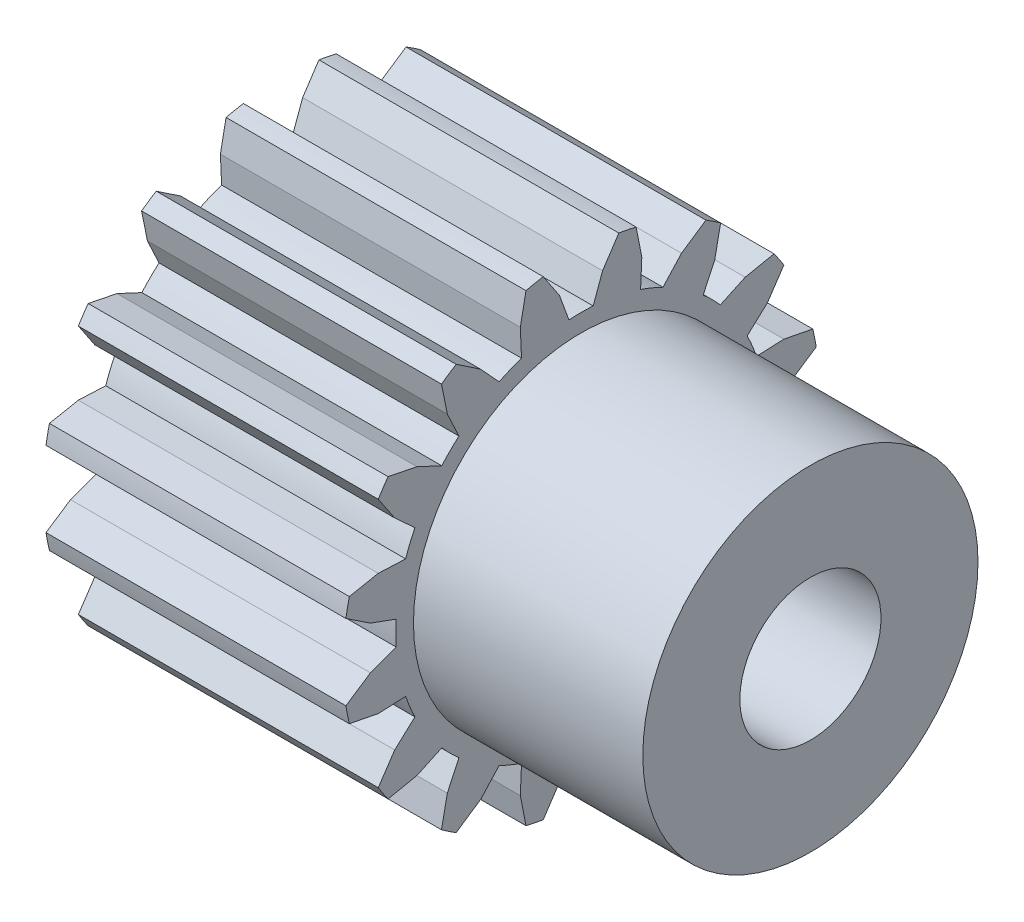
ISO-10303-21;
HEADER;
FILE_DESCRIPTION(('STEP AP214'),'2;1');
FILE_NAME('part.step','',(''),(''),'','','');
FILE_SCHEMA(('AUTOMOTIVE_DESIGN { 1 0 10303 214 1 1 1 1 }'));
ENDSEC;
DATA;
#1=APPLICATION_CONTEXT('core data for automotive mechanical design processes');
#2=APPLICATION_PROTOCOL_DEFINITION('international standard','automotive_design',2000,#1);
#3=PRODUCT_CONTEXT('',#1,'mechanical');
#4=PRODUCT('Part','Part','',(#3));
#5=PRODUCT_RELATED_PRODUCT_CATEGORY('part','',(#4));
#6=PRODUCT_DEFINITION_FORMATION('','',#4);
#7=PRODUCT_DEFINITION_CONTEXT('part definition',#1,'design');
#8=PRODUCT_DEFINITION('design','',#6,#7);
#9=PRODUCT_DEFINITION_SHAPE('','',#8);
#10=(LENGTH_UNIT() NAMED_UNIT(*) SI_UNIT(.MILLI.,.METRE.));
#11=(NAMED_UNIT(*) PLANE_ANGLE_UNIT() SI_UNIT($,.RADIAN.));
#12=(NAMED_UNIT(*) SI_UNIT($,.STERADIAN.) SOLID_ANGLE_UNIT());
#13=UNCERTAINTY_MEASURE_WITH_UNIT(LENGTH_MEASURE(1.E-05),#10,'distance_accuracy_value','');
#14=(GEOMETRIC_REPRESENTATION_CONTEXT(3) GLOBAL_UNCERTAINTY_ASSIGNED_CONTEXT((#13)) GLOBAL_UNIT_ASSIGNED_CONTEXT((#10,
#11,#12)) REPRESENTATION_CONTEXT('',''));
#15=CARTESIAN_POINT('',(0.,0.,0.));
#16=DIRECTION('',(0.,0.,1.));
#17=DIRECTION('',(1.,0.,0.));
#18=AXIS2_PLACEMENT_3D('',#15,#16,#17);
#19=CARTESIAN_POINT('',(8.5,2.14151969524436,-13.329061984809));
#20=DIRECTION('',(0.,-0.83319876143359,-0.552973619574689));
#21=DIRECTION('',(0.,-0.552973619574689,0.83319876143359));
#22=AXIS2_PLACEMENT_3D('',#19,#20,#21);
#23=PLANE('',#22);
#24=DIRECTION('',(0.,-0.552973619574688,0.833198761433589));
#25=VECTOR('',#24,1.);
#26=CARTESIAN_POINT('',(8.5,1.67991132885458,-12.6335287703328));
#27=LINE('',#26,#25);
#28=CARTESIAN_POINT('',(8.5,2.14151969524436,-13.329061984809));
#29=VERTEX_POINT('',#28);
#30=CARTESIAN_POINT('',(8.5,1.21830296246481,-11.9379955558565));
#31=VERTEX_POINT('',#30);
#32=EDGE_CURVE('E676',#29,#31,#27,.T.);
#33=ORIENTED_EDGE('',*,*,#32,.T.);
#34=DIRECTION('',(-1.,0.,0.));
#35=VECTOR('',#34,1.);
#36=CARTESIAN_POINT('',(8.5,1.21830296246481,-11.9379955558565));
#37=LINE('',#36,#35);
#38=CARTESIAN_POINT('',(-8.5,1.21830296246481,-11.9379955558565));
#39=VERTEX_POINT('',#38);
#40=EDGE_CURVE('E672',#39,#31,#37,.F.);
#41=ORIENTED_EDGE('',*,*,#40,.F.);
#42=DIRECTION('',(0.,0.552973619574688,-0.833198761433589));
#43=VECTOR('',#42,1.);
#44=CARTESIAN_POINT('',(-8.5,1.67991132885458,-12.6335287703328));
#45=LINE('',#44,#43);
#46=CARTESIAN_POINT('',(-8.5,2.14151969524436,-13.329061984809));
#47=VERTEX_POINT('',#46);
#48=EDGE_CURVE('E684',#39,#47,#45,.T.);
#49=ORIENTED_EDGE('',*,*,#48,.T.);
#50=DIRECTION('',(-1.,0.,0.));
#51=VECTOR('',#50,1.);
#52=CARTESIAN_POINT('',(0.,2.14151969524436,-13.329061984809));
#53=LINE('',#52,#51);
#54=EDGE_CURVE('E616',#29,#47,#53,.T.);
#55=ORIENTED_EDGE('',*,*,#54,.F.);
#56=EDGE_LOOP('',(#33,#41,#49,#55));
#57=FACE_BOUND('',#56,.T.);
#58=ADVANCED_FACE('F15',(#57),#23,.T.);
#59=CARTESIAN_POINT('',(8.5,1.21830296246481,-11.9379955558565));
#60=DIRECTION('',(0.,-0.939692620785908,-0.34202014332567));
#61=DIRECTION('',(0.,-0.34202014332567,0.939692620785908));
#62=AXIS2_PLACEMENT_3D('',#59,#60,#61);
#63=PLANE('',#62);
#64=DIRECTION('',(0.,-0.34202014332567,0.939692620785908));
#65=VECTOR('',#64,1.);
#66=CARTESIAN_POINT('',(8.5,0.95251790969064,-11.2077571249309));
#67=LINE('',#66,#65);
#68=CARTESIAN_POINT('',(8.5,0.686732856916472,-10.4775186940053));
#69=VERTEX_POINT('',#68);
#70=EDGE_CURVE('E667',#31,#69,#67,.T.);
#71=ORIENTED_EDGE('',*,*,#70,.T.);
#72=DIRECTION('',(1.,0.,0.));
#73=VECTOR('',#72,1.);
#74=CARTESIAN_POINT('',(0.,0.686732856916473,-10.4775186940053));
#75=LINE('',#74,#73);
#76=CARTESIAN_POINT('',(-8.5,0.686732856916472,-10.4775186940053));
#77=VERTEX_POINT('',#76);
#78=EDGE_CURVE('E615',#77,#69,#75,.T.);
#79=ORIENTED_EDGE('',*,*,#78,.F.);
#80=DIRECTION('',(0.,0.34202014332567,-0.939692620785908));
#81=VECTOR('',#80,1.);
#82=CARTESIAN_POINT('',(-8.5,0.95251790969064,-11.2077571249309));
#83=LINE('',#82,#81);
#84=EDGE_CURVE('E611',#77,#39,#83,.T.);
#85=ORIENTED_EDGE('',*,*,#84,.T.);
#86=ORIENTED_EDGE('',*,*,#40,.T.);
#87=EDGE_LOOP('',(#71,#79,#85,#86));
#88=FACE_BOUND('',#87,.T.);
#89=ADVANCED_FACE('F2317',(#88),#63,.T.);
#90=CARTESIAN_POINT('',(-8.5,5.29958021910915E-13,-2.68968874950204E-12));
#91=DIRECTION('',(-1.,0.,0.));
#92=DIRECTION('',(0.,0.,1.));
#93=AXIS2_PLACEMENT_3D('',#90,#91,#92);
#94=CYLINDRICAL_SURFACE('',#93,13.4999999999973);
#95=CARTESIAN_POINT('',(8.5,5.3E-13,-2.69E-12));
#96=DIRECTION('',(-1.,0.,0.));
#97=DIRECTION('',(0.,0.158631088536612,-0.987337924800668));
#98=AXIS2_PLACEMENT_3D('',#95,#96,#97);
#99=CIRCLE('',#98,13.4999999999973);
#100=CARTESIAN_POINT('',(8.5,3.12230497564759,-13.1339716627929));
#101=VERTEX_POINT('',#100);
#102=EDGE_CURVE('E659',#101,#29,#99,.T.);
#103=ORIENTED_EDGE('',*,*,#102,.T.);
#104=ORIENTED_EDGE('',*,*,#54,.T.);
#105=CARTESIAN_POINT('',(-8.5,5.3E-13,-2.69E-12));
#106=DIRECTION('',(-1.,0.,0.));
#107=DIRECTION('',(0.,0.158631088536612,-0.987337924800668));
#108=AXIS2_PLACEMENT_3D('',#105,#106,#107);
#109=CIRCLE('',#108,13.4999999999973);
#110=CARTESIAN_POINT('',(-8.5,3.12230497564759,-13.1339716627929));
#111=VERTEX_POINT('',#110);
#112=EDGE_CURVE('E662',#47,#111,#109,.F.);
#113=ORIENTED_EDGE('',*,*,#112,.T.);
#114=DIRECTION('',(-1.,0.,0.));
#115=VECTOR('',#114,1.);
#116=CARTESIAN_POINT('',(8.5,3.12230497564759,-13.1339716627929));
#117=LINE('',#116,#115);
#118=EDGE_CURVE('E630',#101,#111,#117,.T.);
#119=ORIENTED_EDGE('',*,*,#118,.F.);
#120=EDGE_LOOP('',(#103,#104,#113,#119));
#121=FACE_BOUND('',#120,.T.);
#122=ADVANCED_FACE('F2315',(#121),#94,.T.);
#123=CARTESIAN_POINT('',(-8.5,0.,3.40005801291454E-13));
#124=DIRECTION('',(-1.,0.,0.));
#125=DIRECTION('',(0.,0.,1.));
#126=AXIS2_PLACEMENT_3D('',#123,#124,#125);
#127=CYLINDRICAL_SURFACE('',#126,10.5000000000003);
#128=CARTESIAN_POINT('',(8.5,0.,3.40005801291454E-13));
#129=DIRECTION('',(-1.,0.,0.));
#130=DIRECTION('',(0.,0.,1.));
#131=AXIS2_PLACEMENT_3D('',#128,#129,#130);
#132=CIRCLE('',#131,10.5000000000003);
#133=CARTESIAN_POINT('',(8.5,-0.686732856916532,-10.4775186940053));
#134=VERTEX_POINT('',#133);
#135=EDGE_CURVE('E621',#69,#134,#132,.T.);
#136=ORIENTED_EDGE('',*,*,#135,.T.);
#137=DIRECTION('',(-1.,0.,0.));
#138=VECTOR('',#137,1.);
#139=CARTESIAN_POINT('',(8.5,-0.68673285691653,-10.4775186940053));
#140=LINE('',#139,#138);
#141=CARTESIAN_POINT('',(-8.5,-0.686732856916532,-10.4775186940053));
#142=VERTEX_POINT('',#141);
#143=EDGE_CURVE('E618',#142,#134,#140,.F.);
#144=ORIENTED_EDGE('',*,*,#143,.F.);
#145=CARTESIAN_POINT('',(-8.5,0.,3.40005801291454E-13));
#146=DIRECTION('',(-1.,0.,0.));
#147=DIRECTION('',(0.,0.,1.));
#148=AXIS2_PLACEMENT_3D('',#145,#146,#147);
#149=CIRCLE('',#148,10.5000000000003);
#150=EDGE_CURVE('E18',#142,#77,#149,.F.);
#151=ORIENTED_EDGE('',*,*,#150,.T.);
#152=ORIENTED_EDGE('',*,*,#78,.T.);
#153=EDGE_LOOP('',(#136,#144,#151,#152));
#154=FACE_BOUND('',#153,.T.);
#155=ADVANCED_FACE('F619',(#154),#127,.T.);
#156=CARTESIAN_POINT('',(8.5,3.44290794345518,-11.4954941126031));
#157=DIRECTION('',(0.,0.981389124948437,-0.192029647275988));
#158=DIRECTION('',(0.,-0.192029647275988,-0.981389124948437));
#159=AXIS2_PLACEMENT_3D('',#156,#157,#158);
#160=PLANE('',#159);
#161=DIRECTION('',(0.,-0.192029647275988,-0.981389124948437));
#162=VECTOR('',#161,1.);
#163=CARTESIAN_POINT('',(8.5,3.28260645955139,-12.314732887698));
#164=LINE('',#163,#162);
#165=CARTESIAN_POINT('',(8.5,3.44290794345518,-11.4954941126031));
#166=VERTEX_POINT('',#165);
#167=EDGE_CURVE('E633',#166,#101,#164,.T.);
#168=ORIENTED_EDGE('',*,*,#167,.T.);
#169=ORIENTED_EDGE('',*,*,#118,.T.);
#170=DIRECTION('',(0.,0.192029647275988,0.981389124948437));
#171=VECTOR('',#170,1.);
#172=CARTESIAN_POINT('',(-8.5,3.28260645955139,-12.314732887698));
#173=LINE('',#172,#171);
#174=CARTESIAN_POINT('',(-8.5,3.44290794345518,-11.4954941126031));
#175=VERTEX_POINT('',#174);
#176=EDGE_CURVE('E650',#111,#175,#173,.T.);
#177=ORIENTED_EDGE('',*,*,#176,.T.);
#178=DIRECTION('',(-1.,0.,0.));
#179=VECTOR('',#178,1.);
#180=CARTESIAN_POINT('',(8.5,3.44290794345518,-11.4954941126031));
#181=LINE('',#180,#179);
#182=EDGE_CURVE('E641',#166,#175,#181,.T.);
#183=ORIENTED_EDGE('',*,*,#182,.F.);
#184=EDGE_LOOP('',(#168,#169,#177,#183));
#185=FACE_BOUND('',#184,.T.);
#186=ADVANCED_FACE('F2309',(#185),#160,.T.);
#187=CARTESIAN_POINT('',(8.5,-0.68673285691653,-10.4775186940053));
#188=DIRECTION('',(0.,0.939692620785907,-0.342020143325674));
#189=DIRECTION('',(0.,-0.342020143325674,-0.939692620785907));
#190=AXIS2_PLACEMENT_3D('',#187,#188,#189);
#191=PLANE('',#190);
#192=DIRECTION('',(0.,-0.342020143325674,-0.939692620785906));
#193=VECTOR('',#192,1.);
#194=CARTESIAN_POINT('',(8.5,-0.9525179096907,-11.2077571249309));
#195=LINE('',#194,#193);
#196=CARTESIAN_POINT('',(8.5,-1.21830296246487,-11.9379955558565));
#197=VERTEX_POINT('',#196);
#198=EDGE_CURVE('E624',#134,#197,#195,.T.);
#199=ORIENTED_EDGE('',*,*,#198,.T.);
#200=DIRECTION('',(-1.,0.,0.));
#201=VECTOR('',#200,1.);
#202=CARTESIAN_POINT('',(8.5,-1.21830296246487,-11.9379955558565));
#203=LINE('',#202,#201);
#204=CARTESIAN_POINT('',(-8.5,-1.21830296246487,-11.9379955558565));
#205=VERTEX_POINT('',#204);
#206=EDGE_CURVE('E628',#205,#197,#203,.F.);
#207=ORIENTED_EDGE('',*,*,#206,.F.);
#208=DIRECTION('',(0.,0.342020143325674,0.939692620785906));
#209=VECTOR('',#208,1.);
#210=CARTESIAN_POINT('',(-8.5,-0.9525179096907,-11.2077571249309));
#211=LINE('',#210,#209);
#212=EDGE_CURVE('E608',#205,#142,#211,.T.);
#213=ORIENTED_EDGE('',*,*,#212,.T.);
#214=ORIENTED_EDGE('',*,*,#143,.T.);
#215=EDGE_LOOP('',(#199,#207,#213,#214));
#216=FACE_BOUND('',#215,.T.);
#217=ADVANCED_FACE('F626',(#216),#191,.T.);
#218=CARTESIAN_POINT('',(8.5,3.37511438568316,-9.94276635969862));
#219=DIRECTION('',(0.,0.999048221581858,0.0436193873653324));
#220=DIRECTION('',(0.,0.0436193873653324,-0.999048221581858));
#221=AXIS2_PLACEMENT_3D('',#218,#219,#220);
#222=PLANE('',#221);
#223=DIRECTION('',(0.,0.0436193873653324,-0.999048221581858));
#224=VECTOR('',#223,1.);
#225=CARTESIAN_POINT('',(8.5,3.40901116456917,-10.7191302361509));
#226=LINE('',#225,#224);
#227=CARTESIAN_POINT('',(8.5,3.37511438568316,-9.94276635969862));
#228=VERTEX_POINT('',#227);
#229=EDGE_CURVE('E645',#228,#166,#226,.T.);
#230=ORIENTED_EDGE('',*,*,#229,.T.);
#231=ORIENTED_EDGE('',*,*,#182,.T.);
#232=DIRECTION('',(0.,-0.0436193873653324,0.999048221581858));
#233=VECTOR('',#232,1.);
#234=CARTESIAN_POINT('',(-8.5,3.40901116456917,-10.7191302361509));
#235=LINE('',#234,#233);
#236=CARTESIAN_POINT('',(-8.5,3.37511438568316,-9.94276635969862));
#237=VERTEX_POINT('',#236);
#238=EDGE_CURVE('E851',#175,#237,#235,.T.);
#239=ORIENTED_EDGE('',*,*,#238,.T.);
#240=DIRECTION('',(-1.,0.,0.));
#241=VECTOR('',#240,1.);
#242=CARTESIAN_POINT('',(0.,3.37511438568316,-9.94276635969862));
#243=LINE('',#242,#241);
#244=EDGE_CURVE('E824',#228,#237,#243,.T.);
#245=ORIENTED_EDGE('',*,*,#244,.F.);
#246=EDGE_LOOP('',(#230,#231,#239,#245));
#247=FACE_BOUND('',#246,.T.);
#248=ADVANCED_FACE('F2303',(#247),#222,.T.);
#249=CARTESIAN_POINT('',(8.5,-1.21830296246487,-11.9379955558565));
#250=DIRECTION('',(0.,0.833198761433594,-0.552973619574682));
#251=DIRECTION('',(0.,-0.552973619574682,-0.833198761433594));
#252=AXIS2_PLACEMENT_3D('',#249,#250,#251);
#253=PLANE('',#252);
#254=DIRECTION('',(0.,-0.552973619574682,-0.833198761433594));
#255=VECTOR('',#254,1.);
#256=CARTESIAN_POINT('',(8.5,-1.67991132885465,-12.6335287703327));
#257=LINE('',#256,#255);
#258=CARTESIAN_POINT('',(8.5,-2.14151969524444,-13.329061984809));
#259=VERTEX_POINT('',#258);
#260=EDGE_CURVE('E827',#197,#259,#257,.T.);
#261=ORIENTED_EDGE('',*,*,#260,.T.);
#262=DIRECTION('',(1.,0.,0.));
#263=VECTOR('',#262,1.);
#264=CARTESIAN_POINT('',(0.,-2.14151969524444,-13.329061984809));
#265=LINE('',#264,#263);
#266=CARTESIAN_POINT('',(-8.5,-2.14151969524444,-13.329061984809));
#267=VERTEX_POINT('',#266);
#268=EDGE_CURVE('E864',#267,#259,#265,.T.);
#269=ORIENTED_EDGE('',*,*,#268,.F.);
#270=DIRECTION('',(0.,0.552973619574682,0.833198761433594));
#271=VECTOR('',#270,1.);
#272=CARTESIAN_POINT('',(-8.5,-1.67991132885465,-12.6335287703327));
#273=LINE('',#272,#271);
#274=EDGE_CURVE('E644',#267,#205,#273,.T.);
#275=ORIENTED_EDGE('',*,*,#274,.T.);
#276=ORIENTED_EDGE('',*,*,#206,.T.);
#277=EDGE_LOOP('',(#261,#269,#275,#276));
#278=FACE_BOUND('',#277,.T.);
#279=ADVANCED_FACE('F863',(#278),#253,.T.);
#280=CARTESIAN_POINT('',(-8.5,0.,0.));
#281=DIRECTION('',(-1.,0.,0.));
#282=DIRECTION('',(0.,0.,1.));
#283=AXIS2_PLACEMENT_3D('',#280,#281,#282);
#284=CYLINDRICAL_SURFACE('',#283,10.4999999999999);
#285=CARTESIAN_POINT('',(8.5,0.,0.));
#286=DIRECTION('',(-1.,0.,0.));
#287=DIRECTION('',(0.,0.,1.));
#288=AXIS2_PLACEMENT_3D('',#285,#286,#287);
#289=CIRCLE('',#288,10.4999999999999);
#290=CARTESIAN_POINT('',(8.5,4.64403124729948,-9.41716378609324));
#291=VERTEX_POINT('',#290);
#292=EDGE_CURVE('E821',#291,#228,#289,.T.);
#293=ORIENTED_EDGE('',*,*,#292,.T.);
#294=ORIENTED_EDGE('',*,*,#244,.T.);
#295=CARTESIAN_POINT('',(-8.5,0.,0.));
#296=DIRECTION('',(-1.,0.,0.));
#297=DIRECTION('',(0.,0.,1.));
#298=AXIS2_PLACEMENT_3D('',#295,#296,#297);
#299=CIRCLE('',#298,10.4999999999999);
#300=CARTESIAN_POINT('',(-8.5,4.64403124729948,-9.41716378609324));
#301=VERTEX_POINT('',#300);
#302=EDGE_CURVE('E825',#237,#301,#299,.F.);
#303=ORIENTED_EDGE('',*,*,#302,.T.);
#304=DIRECTION('',(-1.,0.,0.));
#305=VECTOR('',#304,1.);
#306=CARTESIAN_POINT('',(8.5,4.64403124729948,-9.41716378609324));
#307=LINE('',#306,#305);
#308=EDGE_CURVE('E882',#291,#301,#307,.T.);
#309=ORIENTED_EDGE('',*,*,#308,.F.);
#310=EDGE_LOOP('',(#293,#294,#303,#309));
#311=FACE_BOUND('',#310,.T.);
#312=ADVANCED_FACE('F2298',(#311),#284,.T.);
#313=CARTESIAN_POINT('',(-8.5,0.,-4.19803081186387E-13));
#314=DIRECTION('',(-1.,0.,0.));
#315=DIRECTION('',(0.,0.,1.));
#316=AXIS2_PLACEMENT_3D('',#313,#314,#315);
#317=CYLINDRICAL_SURFACE('',#316,13.4999999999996);
#318=CARTESIAN_POINT('',(8.5,1.E-13,-4.2E-13));
#319=DIRECTION('',(-1.,0.,0.));
#320=DIRECTION('',(0.,-0.23128185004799,-0.972886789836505));
#321=AXIS2_PLACEMENT_3D('',#318,#319,#320);
#322=CIRCLE('',#321,13.4999999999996);
#323=CARTESIAN_POINT('',(8.5,-3.12230497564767,-13.1339716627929));
#324=VERTEX_POINT('',#323);
#325=EDGE_CURVE('E861',#259,#324,#322,.T.);
#326=ORIENTED_EDGE('',*,*,#325,.T.);
#327=DIRECTION('',(-1.,0.,0.));
#328=VECTOR('',#327,1.);
#329=CARTESIAN_POINT('',(8.5,-3.12230497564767,-13.1339716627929));
#330=LINE('',#329,#328);
#331=CARTESIAN_POINT('',(-8.5,-3.12230497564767,-13.1339716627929));
#332=VERTEX_POINT('',#331);
#333=EDGE_CURVE('E873',#332,#324,#330,.F.);
#334=ORIENTED_EDGE('',*,*,#333,.F.);
#335=CARTESIAN_POINT('',(-8.5,1.E-13,-4.2E-13));
#336=DIRECTION('',(-1.,0.,0.));
#337=DIRECTION('',(0.,-0.23128185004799,-0.972886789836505));
#338=AXIS2_PLACEMENT_3D('',#335,#336,#337);
#339=CIRCLE('',#338,13.4999999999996);
#340=EDGE_CURVE('E848',#332,#267,#339,.F.);
#341=ORIENTED_EDGE('',*,*,#340,.T.);
#342=ORIENTED_EDGE('',*,*,#268,.T.);
#343=EDGE_LOOP('',(#326,#334,#341,#342));
#344=FACE_BOUND('',#343,.T.);
#345=ADVANCED_FACE('F874',(#344),#317,.T.);
#346=CARTESIAN_POINT('',(8.5,5.69403828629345,-10.5630453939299));
#347=DIRECTION('',(0.,-0.737277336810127,-0.675590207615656));
#348=DIRECTION('',(0.,-0.675590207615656,0.737277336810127));
#349=AXIS2_PLACEMENT_3D('',#346,#347,#348);
#350=PLANE('',#349);
#351=DIRECTION('',(0.,-0.675590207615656,0.737277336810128));
#352=VECTOR('',#351,1.);
#353=CARTESIAN_POINT('',(8.5,5.16903476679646,-9.99010459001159));
#354=LINE('',#353,#352);
#355=CARTESIAN_POINT('',(8.5,5.69403828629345,-10.5630453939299));
#356=VERTEX_POINT('',#355);
#357=EDGE_CURVE('E884',#356,#291,#354,.T.);
#358=ORIENTED_EDGE('',*,*,#357,.T.);
#359=ORIENTED_EDGE('',*,*,#308,.T.);
#360=DIRECTION('',(0.,0.675590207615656,-0.737277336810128));
#361=VECTOR('',#360,1.);
#362=CARTESIAN_POINT('',(-8.5,5.16903476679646,-9.99010459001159));
#363=LINE('',#362,#361);
#364=CARTESIAN_POINT('',(-8.5,5.69403828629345,-10.5630453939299));
#365=VERTEX_POINT('',#364);
#366=EDGE_CURVE('E901',#301,#365,#363,.T.);
#367=ORIENTED_EDGE('',*,*,#366,.T.);
#368=DIRECTION('',(-1.,0.,0.));
#369=VECTOR('',#368,1.);
#370=CARTESIAN_POINT('',(8.5,5.69403828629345,-10.5630453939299));
#371=LINE('',#370,#369);
#372=EDGE_CURVE('E892',#356,#365,#371,.T.);
#373=ORIENTED_EDGE('',*,*,#372,.F.);
#374=EDGE_LOOP('',(#358,#359,#367,#373));
#375=FACE_BOUND('',#374,.T.);
#376=ADVANCED_FACE('F916',(#375),#350,.T.);
#377=CARTESIAN_POINT('',(8.5,-3.12230497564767,-13.1339716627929));
#378=DIRECTION('',(0.,-0.981389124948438,-0.192029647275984));
#379=DIRECTION('',(0.,-0.192029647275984,0.981389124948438));
#380=AXIS2_PLACEMENT_3D('',#377,#378,#379);
#381=PLANE('',#380);
#382=DIRECTION('',(0.,-0.192029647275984,0.981389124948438));
#383=VECTOR('',#382,1.);
#384=CARTESIAN_POINT('',(8.5,-3.28260645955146,-12.314732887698));
#385=LINE('',#384,#383);
#386=CARTESIAN_POINT('',(8.5,-3.44290794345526,-11.4954941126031));
#387=VERTEX_POINT('',#386);
#388=EDGE_CURVE('E876',#324,#387,#385,.T.);
#389=ORIENTED_EDGE('',*,*,#388,.T.);
#390=DIRECTION('',(-1.,0.,0.));
#391=VECTOR('',#390,1.);
#392=CARTESIAN_POINT('',(8.5,-3.44290794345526,-11.4954941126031));
#393=LINE('',#392,#391);
#394=CARTESIAN_POINT('',(-8.5,-3.44290794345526,-11.4954941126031));
#395=VERTEX_POINT('',#394);
#396=EDGE_CURVE('E880',#395,#387,#393,.F.);
#397=ORIENTED_EDGE('',*,*,#396,.F.);
#398=DIRECTION('',(0.,0.192029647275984,-0.981389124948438));
#399=VECTOR('',#398,1.);
#400=CARTESIAN_POINT('',(-8.5,-3.28260645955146,-12.314732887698));
#401=LINE('',#400,#399);
#402=EDGE_CURVE('E868',#395,#332,#401,.T.);
#403=ORIENTED_EDGE('',*,*,#402,.T.);
#404=ORIENTED_EDGE('',*,*,#333,.T.);
#405=EDGE_LOOP('',(#389,#397,#403,#404));
#406=FACE_BOUND('',#405,.T.);
#407=ADVANCED_FACE('F878',(#406),#381,.T.);
#408=CARTESIAN_POINT('',(8.5,7.07931740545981,-11.4949234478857));
#409=DIRECTION('',(0.,-0.558161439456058,-0.829732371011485));
#410=DIRECTION('',(0.,-0.829732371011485,0.558161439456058));
#411=AXIS2_PLACEMENT_3D('',#408,#409,#410);
#412=PLANE('',#411);
#413=DIRECTION('',(0.,-0.829732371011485,0.558161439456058));
#414=VECTOR('',#413,1.);
#415=CARTESIAN_POINT('',(8.5,6.38667784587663,-11.0289844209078));
#416=LINE('',#415,#414);
#417=CARTESIAN_POINT('',(8.5,7.07931740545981,-11.4949234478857));
#418=VERTEX_POINT('',#417);
#419=EDGE_CURVE('E896',#418,#356,#416,.T.);
#420=ORIENTED_EDGE('',*,*,#419,.T.);
#421=ORIENTED_EDGE('',*,*,#372,.T.);
#422=DIRECTION('',(0.,0.829732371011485,-0.558161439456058));
#423=VECTOR('',#422,1.);
#424=CARTESIAN_POINT('',(-8.5,6.38667784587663,-11.0289844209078));
#425=LINE('',#424,#423);
#426=CARTESIAN_POINT('',(-8.5,7.07931740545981,-11.4949234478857));
#427=VERTEX_POINT('',#426);
#428=EDGE_CURVE('E922',#365,#427,#425,.T.);
#429=ORIENTED_EDGE('',*,*,#428,.T.);
#430=DIRECTION('',(-1.,0.,0.));
#431=VECTOR('',#430,1.);
#432=CARTESIAN_POINT('',(0.,7.07931740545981,-11.4949234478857));
#433=LINE('',#432,#431);
#434=EDGE_CURVE('E820',#418,#427,#433,.T.);
#435=ORIENTED_EDGE('',*,*,#434,.F.);
#436=EDGE_LOOP('',(#420,#421,#429,#435));
#437=FACE_BOUND('',#436,.T.);
#438=ADVANCED_FACE('F920',(#437),#412,.T.);
#439=CARTESIAN_POINT('',(8.5,-3.44290794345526,-11.4954941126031));
#440=DIRECTION('',(0.,-0.999048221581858,0.0436193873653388));
#441=DIRECTION('',(0.,0.0436193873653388,0.999048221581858));
#442=AXIS2_PLACEMENT_3D('',#439,#440,#441);
#443=PLANE('',#442);
#444=DIRECTION('',(0.,0.0436193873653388,0.999048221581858));
#445=VECTOR('',#444,1.);
#446=CARTESIAN_POINT('',(8.5,-3.40901116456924,-10.7191302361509));
#447=LINE('',#446,#445);
#448=CARTESIAN_POINT('',(8.5,-3.37511438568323,-9.94276635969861));
#449=VERTEX_POINT('',#448);
#450=EDGE_CURVE('E936',#387,#449,#447,.T.);
#451=ORIENTED_EDGE('',*,*,#450,.T.);
#452=DIRECTION('',(1.,0.,0.));
#453=VECTOR('',#452,1.);
#454=CARTESIAN_POINT('',(0.,-3.37511438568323,-9.94276635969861));
#455=LINE('',#454,#453);
#456=CARTESIAN_POINT('',(-8.5,-3.37511438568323,-9.94276635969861));
#457=VERTEX_POINT('',#456);
#458=EDGE_CURVE('E816',#457,#449,#455,.T.);
#459=ORIENTED_EDGE('',*,*,#458,.F.);
#460=DIRECTION('',(0.,-0.0436193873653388,-0.999048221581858));
#461=VECTOR('',#460,1.);
#462=CARTESIAN_POINT('',(-8.5,-3.40901116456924,-10.7191302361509));
#463=LINE('',#462,#461);
#464=EDGE_CURVE('E895',#457,#395,#463,.T.);
#465=ORIENTED_EDGE('',*,*,#464,.T.);
#466=ORIENTED_EDGE('',*,*,#396,.T.);
#467=EDGE_LOOP('',(#451,#459,#465,#466));
#468=FACE_BOUND('',#467,.T.);
#469=ADVANCED_FACE('F946',(#468),#443,.T.);
#470=CARTESIAN_POINT('',(-8.5,6.60062282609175E-13,-7.70217223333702E-13));
#471=DIRECTION('',(-1.,0.,0.));
#472=DIRECTION('',(0.,0.,1.));
#473=AXIS2_PLACEMENT_3D('',#470,#471,#472);
#474=CYLINDRICAL_SURFACE('',#473,13.499999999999);
#475=CARTESIAN_POINT('',(8.5,6.6E-13,-7.70000000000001E-13));
#476=DIRECTION('',(-1.,0.,0.));
#477=DIRECTION('',(0.,0.524393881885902,-0.851475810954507));
#478=AXIS2_PLACEMENT_3D('',#475,#476,#477);
#479=CIRCLE('',#478,13.499999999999);
#480=CARTESIAN_POINT('',(8.5,7.91078701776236,-10.9393532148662));
#481=VERTEX_POINT('',#480);
#482=EDGE_CURVE('E952',#481,#418,#479,.T.);
#483=ORIENTED_EDGE('',*,*,#482,.T.);
#484=ORIENTED_EDGE('',*,*,#434,.T.);
#485=CARTESIAN_POINT('',(-8.5,6.6E-13,-7.70000000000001E-13));
#486=DIRECTION('',(-1.,0.,0.));
#487=DIRECTION('',(0.,0.524393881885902,-0.851475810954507));
#488=AXIS2_PLACEMENT_3D('',#485,#486,#487);
#489=CIRCLE('',#488,13.499999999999);
#490=CARTESIAN_POINT('',(-8.5,7.91078701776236,-10.9393532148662));
#491=VERTEX_POINT('',#490);
#492=EDGE_CURVE('E944',#427,#491,#489,.F.);
#493=ORIENTED_EDGE('',*,*,#492,.T.);
#494=DIRECTION('',(-1.,0.,0.));
#495=VECTOR('',#494,1.);
#496=CARTESIAN_POINT('',(8.5,7.91078701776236,-10.9393532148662));
#497=LINE('',#496,#495);
#498=EDGE_CURVE('E978',#481,#491,#497,.T.);
#499=ORIENTED_EDGE('',*,*,#498,.F.);
#500=EDGE_LOOP('',(#483,#484,#493,#499));
#501=FACE_BOUND('',#500,.T.);
#502=ADVANCED_FACE('F1036',(#501),#474,.T.);
#503=CARTESIAN_POINT('',(-8.5,0.,-1.10154940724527E-13));
#504=DIRECTION('',(-1.,0.,0.));
#505=DIRECTION('',(0.,0.,1.));
#506=AXIS2_PLACEMENT_3D('',#503,#504,#505);
#507=CYLINDRICAL_SURFACE('',#506,10.4999999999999);
#508=CARTESIAN_POINT('',(8.5,0.,-1.10154940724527E-13));
#509=DIRECTION('',(-1.,0.,0.));
#510=DIRECTION('',(0.,0.,1.));
#511=AXIS2_PLACEMENT_3D('',#508,#509,#510);
#512=CIRCLE('',#511,10.4999999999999);
#513=CARTESIAN_POINT('',(8.5,-4.64403124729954,-9.41716378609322));
#514=VERTEX_POINT('',#513);
#515=EDGE_CURVE('E813',#449,#514,#512,.T.);
#516=ORIENTED_EDGE('',*,*,#515,.T.);
#517=DIRECTION('',(-1.,0.,0.));
#518=VECTOR('',#517,1.);
#519=CARTESIAN_POINT('',(8.5,-4.64403124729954,-9.41716378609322));
#520=LINE('',#519,#518);
#521=CARTESIAN_POINT('',(-8.5,-4.64403124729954,-9.41716378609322));
#522=VERTEX_POINT('',#521);
#523=EDGE_CURVE('E970',#522,#514,#520,.F.);
#524=ORIENTED_EDGE('',*,*,#523,.F.);
#525=CARTESIAN_POINT('',(-8.5,0.,-1.10154940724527E-13));
#526=DIRECTION('',(-1.,0.,0.));
#527=DIRECTION('',(0.,0.,1.));
#528=AXIS2_PLACEMENT_3D('',#525,#526,#527);
#529=CIRCLE('',#528,10.4999999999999);
#530=EDGE_CURVE('E817',#522,#457,#529,.F.);
#531=ORIENTED_EDGE('',*,*,#530,.T.);
#532=ORIENTED_EDGE('',*,*,#458,.T.);
#533=EDGE_LOOP('',(#516,#524,#531,#532));
#534=FACE_BOUND('',#533,.T.);
#535=ADVANCED_FACE('F967',(#534),#507,.T.);
#536=CARTESIAN_POINT('',(8.5,7.57996732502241,-9.30290789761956));
#537=DIRECTION('',(0.,0.980171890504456,0.198149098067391));
#538=DIRECTION('',(0.,0.198149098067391,-0.980171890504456));
#539=AXIS2_PLACEMENT_3D('',#536,#537,#538);
#540=PLANE('',#539);
#541=DIRECTION('',(0.,0.198149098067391,-0.980171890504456));
#542=VECTOR('',#541,1.);
#543=CARTESIAN_POINT('',(8.5,7.74537717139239,-10.1211305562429));
#544=LINE('',#543,#542);
#545=CARTESIAN_POINT('',(8.5,7.57996732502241,-9.30290789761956));
#546=VERTEX_POINT('',#545);
#547=EDGE_CURVE('E1023',#546,#481,#544,.T.);
#548=ORIENTED_EDGE('',*,*,#547,.T.);
#549=ORIENTED_EDGE('',*,*,#498,.T.);
#550=DIRECTION('',(0.,-0.198149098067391,0.980171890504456));
#551=VECTOR('',#550,1.);
#552=CARTESIAN_POINT('',(-8.5,7.74537717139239,-10.1211305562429));
#553=LINE('',#552,#551);
#554=CARTESIAN_POINT('',(-8.5,7.57996732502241,-9.30290789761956));
#555=VERTEX_POINT('',#554);
#556=EDGE_CURVE('E815',#491,#555,#553,.T.);
#557=ORIENTED_EDGE('',*,*,#556,.T.);
#558=DIRECTION('',(-1.,0.,0.));
#559=VECTOR('',#558,1.);
#560=CARTESIAN_POINT('',(8.5,7.57996732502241,-9.30290789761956));
#561=LINE('',#560,#559);
#562=EDGE_CURVE('E991',#546,#555,#561,.T.);
#563=ORIENTED_EDGE('',*,*,#562,.F.);
#564=EDGE_LOOP('',(#548,#549,#557,#563));
#565=FACE_BOUND('',#564,.T.);
#566=ADVANCED_FACE('F1034',(#565),#540,.T.);
#567=CARTESIAN_POINT('',(8.5,-4.64403124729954,-9.41716378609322));
#568=DIRECTION('',(0.,0.737277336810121,-0.675590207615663));
#569=DIRECTION('',(0.,-0.675590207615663,-0.737277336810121));
#570=AXIS2_PLACEMENT_3D('',#567,#568,#569);
#571=PLANE('',#570);
#572=DIRECTION('',(0.,-0.675590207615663,-0.737277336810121));
#573=VECTOR('',#572,1.);
#574=CARTESIAN_POINT('',(8.5,-5.16903476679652,-9.99010459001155));
#575=LINE('',#574,#573);
#576=CARTESIAN_POINT('',(8.5,-5.69403828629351,-10.5630453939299));
#577=VERTEX_POINT('',#576);
#578=EDGE_CURVE('E983',#514,#577,#575,.T.);
#579=ORIENTED_EDGE('',*,*,#578,.T.);
#580=DIRECTION('',(-1.,0.,0.));
#581=VECTOR('',#580,1.);
#582=CARTESIAN_POINT('',(8.5,-5.69403828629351,-10.5630453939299));
#583=LINE('',#582,#581);
#584=CARTESIAN_POINT('',(-8.5,-5.69403828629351,-10.5630453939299));
#585=VERTEX_POINT('',#584);
#586=EDGE_CURVE('E981',#585,#577,#583,.F.);
#587=ORIENTED_EDGE('',*,*,#586,.F.);
#588=DIRECTION('',(0.,0.675590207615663,0.737277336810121));
#589=VECTOR('',#588,1.);
#590=CARTESIAN_POINT('',(-8.5,-5.16903476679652,-9.99010459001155));
#591=LINE('',#590,#589);
#592=EDGE_CURVE('E972',#585,#522,#591,.T.);
#593=ORIENTED_EDGE('',*,*,#592,.T.);
#594=ORIENTED_EDGE('',*,*,#523,.T.);
#595=EDGE_LOOP('',(#579,#587,#593,#594));
#596=FACE_BOUND('',#595,.T.);
#597=ADVANCED_FACE('F982',(#596),#571,.T.);
#598=CARTESIAN_POINT('',(8.5,6.9231310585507,-7.89431797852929));
#599=DIRECTION('',(0.,0.906307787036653,0.422618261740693));
#600=DIRECTION('',(0.,0.422618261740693,-0.906307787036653));
#601=AXIS2_PLACEMENT_3D('',#598,#599,#600);
#602=PLANE('',#601);
#603=DIRECTION('',(0.,0.422618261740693,-0.906307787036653));
#604=VECTOR('',#603,1.);
#605=CARTESIAN_POINT('',(8.5,7.25154919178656,-8.59861293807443));
#606=LINE('',#605,#604);
#607=CARTESIAN_POINT('',(8.5,6.9231310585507,-7.89431797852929));
#608=VERTEX_POINT('',#607);
#609=EDGE_CURVE('E994',#608,#546,#606,.T.);
#610=ORIENTED_EDGE('',*,*,#609,.T.);
#611=ORIENTED_EDGE('',*,*,#562,.T.);
#612=DIRECTION('',(0.,-0.422618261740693,0.906307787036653));
#613=VECTOR('',#612,1.);
#614=CARTESIAN_POINT('',(-8.5,7.25154919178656,-8.59861293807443));
#615=LINE('',#614,#613);
#616=CARTESIAN_POINT('',(-8.5,6.9231310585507,-7.89431797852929));
#617=VERTEX_POINT('',#616);
#618=EDGE_CURVE('E1007',#555,#617,#615,.T.);
#619=ORIENTED_EDGE('',*,*,#618,.T.);
#620=DIRECTION('',(-1.,0.,0.));
#621=VECTOR('',#620,1.);
#622=CARTESIAN_POINT('',(0.,6.9231310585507,-7.89431797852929));
#623=LINE('',#622,#621);
#624=EDGE_CURVE('E808',#608,#617,#623,.T.);
#625=ORIENTED_EDGE('',*,*,#624,.F.);
#626=EDGE_LOOP('',(#610,#611,#619,#625));
#627=FACE_BOUND('',#626,.T.);
#628=ADVANCED_FACE('F1039',(#627),#602,.T.);
#629=CARTESIAN_POINT('',(8.5,-5.69403828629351,-10.5630453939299));
#630=DIRECTION('',(0.,0.558161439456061,-0.829732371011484));
#631=DIRECTION('',(0.,-0.829732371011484,-0.558161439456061));
#632=AXIS2_PLACEMENT_3D('',#629,#630,#631);
#633=PLANE('',#632);
#634=DIRECTION('',(0.,-0.829732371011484,-0.558161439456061));
#635=VECTOR('',#634,1.);
#636=CARTESIAN_POINT('',(8.5,-6.3866778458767,-11.0289844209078));
#637=LINE('',#636,#635);
#638=CARTESIAN_POINT('',(8.5,-7.07931740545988,-11.4949234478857));
#639=VERTEX_POINT('',#638);
#640=EDGE_CURVE('E812',#577,#639,#637,.T.);
#641=ORIENTED_EDGE('',*,*,#640,.T.);
#642=DIRECTION('',(1.,0.,0.));
#643=VECTOR('',#642,1.);
#644=CARTESIAN_POINT('',(0.,-7.07931740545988,-11.4949234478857));
#645=LINE('',#644,#643);
#646=CARTESIAN_POINT('',(-8.5,-7.07931740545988,-11.4949234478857));
#647=VERTEX_POINT('',#646);
#648=EDGE_CURVE('E989',#647,#639,#645,.T.);
#649=ORIENTED_EDGE('',*,*,#648,.F.);
#650=DIRECTION('',(0.,0.829732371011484,0.558161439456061));
#651=VECTOR('',#650,1.);
#652=CARTESIAN_POINT('',(-8.5,-6.3866778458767,-11.0289844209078));
#653=LINE('',#652,#651);
#654=EDGE_CURVE('E975',#647,#585,#653,.T.);
#655=ORIENTED_EDGE('',*,*,#654,.T.);
#656=ORIENTED_EDGE('',*,*,#586,.T.);
#657=EDGE_LOOP('',(#641,#649,#655,#656));
#658=FACE_BOUND('',#657,.T.);
#659=ADVANCED_FACE('F987',(#658),#633,.T.);
#660=CARTESIAN_POINT('',(-8.5,-2.4980018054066E-13,3.40005801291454E-13));
#661=DIRECTION('',(-1.,0.,0.));
#662=DIRECTION('',(0.,0.,1.));
#663=AXIS2_PLACEMENT_3D('',#660,#661,#662);
#664=CYLINDRICAL_SURFACE('',#663,10.5000000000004);
#665=CARTESIAN_POINT('',(8.5,-2.4980018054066E-13,3.40005801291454E-13));
#666=DIRECTION('',(-1.,0.,0.));
#667=DIRECTION('',(0.,0.,1.));
#668=AXIS2_PLACEMENT_3D('',#665,#666,#667);
#669=CIRCLE('',#668,10.5000000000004);
#670=CARTESIAN_POINT('',(8.5,7.89431797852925,-6.92313105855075));
#671=VERTEX_POINT('',#670);
#672=EDGE_CURVE('E805',#671,#608,#669,.T.);
#673=ORIENTED_EDGE('',*,*,#672,.T.);
#674=ORIENTED_EDGE('',*,*,#624,.T.);
#675=CARTESIAN_POINT('',(-8.5,-2.4980018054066E-13,3.40005801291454E-13));
#676=DIRECTION('',(-1.,0.,0.));
#677=DIRECTION('',(0.,0.,1.));
#678=AXIS2_PLACEMENT_3D('',#675,#676,#677);
#679=CIRCLE('',#678,10.5000000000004);
#680=CARTESIAN_POINT('',(-8.5,7.89431797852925,-6.92313105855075));
#681=VERTEX_POINT('',#680);
#682=EDGE_CURVE('E809',#617,#681,#679,.F.);
#683=ORIENTED_EDGE('',*,*,#682,.T.);
#684=DIRECTION('',(-1.,0.,0.));
#685=VECTOR('',#684,1.);
#686=CARTESIAN_POINT('',(8.5,7.89431797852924,-6.92313105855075));
#687=LINE('',#686,#685);
#688=EDGE_CURVE('E1044',#671,#681,#687,.T.);
#689=ORIENTED_EDGE('',*,*,#688,.F.);
#690=EDGE_LOOP('',(#673,#674,#683,#689));
#691=FACE_BOUND('',#690,.T.);
#692=ADVANCED_FACE('F1041',(#691),#664,.T.);
#693=CARTESIAN_POINT('',(-8.5,2.69749500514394E-13,7.19910242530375E-13));
#694=DIRECTION('',(-1.,0.,0.));
#695=DIRECTION('',(0.,0.,1.));
#696=AXIS2_PLACEMENT_3D('',#693,#694,#695);
#697=CYLINDRICAL_SURFACE('',#696,13.5000000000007);
#698=CARTESIAN_POINT('',(8.5,2.7E-13,7.2E-13));
#699=DIRECTION('',(-1.,0.,0.));
#700=DIRECTION('',(0.,-0.585984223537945,-0.810322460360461));
#701=AXIS2_PLACEMENT_3D('',#698,#699,#700);
#702=CIRCLE('',#701,13.5000000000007);
#703=CARTESIAN_POINT('',(8.5,-7.91078701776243,-10.9393532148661));
#704=VERTEX_POINT('',#703);
#705=EDGE_CURVE('E1097',#639,#704,#702,.T.);
#706=ORIENTED_EDGE('',*,*,#705,.T.);
#707=DIRECTION('',(-1.,0.,0.));
#708=VECTOR('',#707,1.);
#709=CARTESIAN_POINT('',(8.5,-7.91078701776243,-10.9393532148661));
#710=LINE('',#709,#708);
#711=CARTESIAN_POINT('',(-8.5,-7.91078701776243,-10.9393532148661));
#712=VERTEX_POINT('',#711);
#713=EDGE_CURVE('E1084',#712,#704,#710,.F.);
#714=ORIENTED_EDGE('',*,*,#713,.F.);
#715=CARTESIAN_POINT('',(-8.5,2.7E-13,7.2E-13));
#716=DIRECTION('',(-1.,0.,0.));
#717=DIRECTION('',(0.,-0.585984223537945,-0.810322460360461));
#718=AXIS2_PLACEMENT_3D('',#715,#716,#717);
#719=CIRCLE('',#718,13.5000000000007);
#720=EDGE_CURVE('E1004',#712,#647,#719,.F.);
#721=ORIENTED_EDGE('',*,*,#720,.T.);
#722=ORIENTED_EDGE('',*,*,#648,.T.);
#723=EDGE_LOOP('',(#706,#714,#721,#722));
#724=FACE_BOUND('',#723,.T.);
#725=ADVANCED_FACE('F1118',(#724),#697,.T.);
#726=CARTESIAN_POINT('',(8.5,9.30290789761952,-7.57996732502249));
#727=DIRECTION('',(0.,-0.422618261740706,-0.906307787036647));
#728=DIRECTION('',(0.,-0.906307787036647,0.422618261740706));
#729=AXIS2_PLACEMENT_3D('',#726,#727,#728);
#730=PLANE('',#729);
#731=DIRECTION('',(0.,-0.906307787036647,0.422618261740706));
#732=VECTOR('',#731,1.);
#733=CARTESIAN_POINT('',(8.5,8.59861293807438,-7.25154919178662));
#734=LINE('',#733,#732);
#735=CARTESIAN_POINT('',(8.5,9.30290789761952,-7.57996732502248));
#736=VERTEX_POINT('',#735);
#737=EDGE_CURVE('E1046',#736,#671,#734,.T.);
#738=ORIENTED_EDGE('',*,*,#737,.T.);
#739=ORIENTED_EDGE('',*,*,#688,.T.);
#740=DIRECTION('',(0.,0.906307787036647,-0.422618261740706));
#741=VECTOR('',#740,1.);
#742=CARTESIAN_POINT('',(-8.5,8.59861293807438,-7.25154919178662));
#743=LINE('',#742,#741);
#744=CARTESIAN_POINT('',(-8.5,9.30290789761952,-7.57996732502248));
#745=VERTEX_POINT('',#744);
#746=EDGE_CURVE('E1052',#681,#745,#743,.T.);
#747=ORIENTED_EDGE('',*,*,#746,.T.);
#748=DIRECTION('',(-1.,0.,0.));
#749=VECTOR('',#748,1.);
#750=CARTESIAN_POINT('',(8.5,9.30290789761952,-7.57996732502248));
#751=LINE('',#750,#749);
#752=EDGE_CURVE('E1056',#736,#745,#751,.T.);
#753=ORIENTED_EDGE('',*,*,#752,.F.);
#754=EDGE_LOOP('',(#738,#739,#747,#753));
#755=FACE_BOUND('',#754,.T.);
#756=ADVANCED_FACE('F1057',(#755),#730,.T.);
#757=CARTESIAN_POINT('',(8.5,-7.91078701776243,-10.9393532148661));
#758=DIRECTION('',(0.,-0.980171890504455,0.198149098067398));
#759=DIRECTION('',(0.,0.198149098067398,0.980171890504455));
#760=AXIS2_PLACEMENT_3D('',#757,#758,#759);
#761=PLANE('',#760);
#762=DIRECTION('',(0.,0.198149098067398,0.980171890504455));
#763=VECTOR('',#762,1.);
#764=CARTESIAN_POINT('',(8.5,-7.74537717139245,-10.1211305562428));
#765=LINE('',#764,#763);
#766=CARTESIAN_POINT('',(8.5,-7.57996732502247,-9.30290789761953));
#767=VERTEX_POINT('',#766);
#768=EDGE_CURVE('E1067',#704,#767,#765,.T.);
#769=ORIENTED_EDGE('',*,*,#768,.T.);
#770=DIRECTION('',(-1.,0.,0.));
#771=VECTOR('',#770,1.);
#772=CARTESIAN_POINT('',(8.5,-7.57996732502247,-9.30290789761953));
#773=LINE('',#772,#771);
#774=CARTESIAN_POINT('',(-8.5,-7.57996732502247,-9.30290789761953));
#775=VERTEX_POINT('',#774);
#776=EDGE_CURVE('E1077',#775,#767,#773,.F.);
#777=ORIENTED_EDGE('',*,*,#776,.F.);
#778=DIRECTION('',(0.,-0.198149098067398,-0.980171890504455));
#779=VECTOR('',#778,1.);
#780=CARTESIAN_POINT('',(-8.5,-7.74537717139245,-10.1211305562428));
#781=LINE('',#780,#779);
#782=EDGE_CURVE('E1087',#775,#712,#781,.T.);
#783=ORIENTED_EDGE('',*,*,#782,.T.);
#784=ORIENTED_EDGE('',*,*,#713,.T.);
#785=EDGE_LOOP('',(#769,#777,#783,#784));
#786=FACE_BOUND('',#785,.T.);
#787=ADVANCED_FACE('F1123',(#786),#761,.T.);
#788=CARTESIAN_POINT('',(8.5,10.9393532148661,-7.91078701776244));
#789=DIRECTION('',(0.,-0.198149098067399,-0.980171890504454));
#790=DIRECTION('',(0.,-0.980171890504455,0.198149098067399));
#791=AXIS2_PLACEMENT_3D('',#788,#789,#790);
#792=PLANE('',#791);
#793=DIRECTION('',(0.,-0.980171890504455,0.198149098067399));
#794=VECTOR('',#793,1.);
#795=CARTESIAN_POINT('',(8.5,10.1211305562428,-7.74537717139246));
#796=LINE('',#795,#794);
#797=CARTESIAN_POINT('',(8.5,10.9393532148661,-7.91078701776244));
#798=VERTEX_POINT('',#797);
#799=EDGE_CURVE('E1049',#798,#736,#796,.T.);
#800=ORIENTED_EDGE('',*,*,#799,.T.);
#801=ORIENTED_EDGE('',*,*,#752,.T.);
#802=DIRECTION('',(0.,0.980171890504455,-0.198149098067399));
#803=VECTOR('',#802,1.);
#804=CARTESIAN_POINT('',(-8.5,10.1211305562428,-7.74537717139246));
#805=LINE('',#804,#803);
#806=CARTESIAN_POINT('',(-8.5,10.9393532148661,-7.91078701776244));
#807=VERTEX_POINT('',#806);
#808=EDGE_CURVE('E1065',#745,#807,#805,.T.);
#809=ORIENTED_EDGE('',*,*,#808,.T.);
#810=DIRECTION('',(-1.,0.,0.));
#811=VECTOR('',#810,1.);
#812=CARTESIAN_POINT('',(0.,10.9393532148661,-7.91078701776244));
#813=LINE('',#812,#811);
#814=EDGE_CURVE('E804',#798,#807,#813,.T.);
#815=ORIENTED_EDGE('',*,*,#814,.F.);
#816=EDGE_LOOP('',(#800,#801,#809,#815));
#817=FACE_BOUND('',#816,.T.);
#818=ADVANCED_FACE('F1062',(#817),#792,.T.);
#819=CARTESIAN_POINT('',(8.5,-7.57996732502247,-9.30290789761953));
#820=DIRECTION('',(0.,-0.90630778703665,0.422618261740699));
#821=DIRECTION('',(0.,0.422618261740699,0.90630778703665));
#822=AXIS2_PLACEMENT_3D('',#819,#820,#821);
#823=PLANE('',#822);
#824=DIRECTION('',(0.,0.422618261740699,0.90630778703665));
#825=VECTOR('',#824,1.);
#826=CARTESIAN_POINT('',(8.5,-7.25154919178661,-8.59861293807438));
#827=LINE('',#826,#825);
#828=CARTESIAN_POINT('',(8.5,-6.92313105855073,-7.89431797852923));
#829=VERTEX_POINT('',#828);
#830=EDGE_CURVE('E1080',#767,#829,#827,.T.);
#831=ORIENTED_EDGE('',*,*,#830,.T.);
#832=DIRECTION('',(1.,0.,0.));
#833=VECTOR('',#832,1.);
#834=CARTESIAN_POINT('',(0.,-6.92313105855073,-7.89431797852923));
#835=LINE('',#834,#833);
#836=CARTESIAN_POINT('',(-8.5,-6.92313105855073,-7.89431797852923));
#837=VERTEX_POINT('',#836);
#838=EDGE_CURVE('E800',#837,#829,#835,.T.);
#839=ORIENTED_EDGE('',*,*,#838,.F.);
#840=DIRECTION('',(0.,-0.422618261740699,-0.90630778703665));
#841=VECTOR('',#840,1.);
#842=CARTESIAN_POINT('',(-8.5,-7.25154919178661,-8.59861293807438));
#843=LINE('',#842,#841);
#844=EDGE_CURVE('E1060',#837,#775,#843,.T.);
#845=ORIENTED_EDGE('',*,*,#844,.T.);
#846=ORIENTED_EDGE('',*,*,#776,.T.);
#847=EDGE_LOOP('',(#831,#839,#845,#846));
#848=FACE_BOUND('',#847,.T.);
#849=ADVANCED_FACE('F1125',(#848),#823,.T.);
#850=CARTESIAN_POINT('',(-8.5,1.45976980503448E-12,-8.69963823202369E-13));
#851=DIRECTION('',(-1.,0.,0.));
#852=DIRECTION('',(0.,0.,1.));
#853=AXIS2_PLACEMENT_3D('',#850,#851,#852);
#854=CYLINDRICAL_SURFACE('',#853,13.4999999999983);
#855=CARTESIAN_POINT('',(8.5,1.46E-12,-8.70000000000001E-13));
#856=DIRECTION('',(-1.,0.,0.));
#857=DIRECTION('',(0.,0.810322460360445,-0.585984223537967));
#858=AXIS2_PLACEMENT_3D('',#855,#856,#857);
#859=CIRCLE('',#858,13.4999999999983);
#860=CARTESIAN_POINT('',(8.5,11.4949234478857,-7.0793174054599));
#861=VERTEX_POINT('',#860);
#862=EDGE_CURVE('E1133',#861,#798,#859,.T.);
#863=ORIENTED_EDGE('',*,*,#862,.T.);
#864=ORIENTED_EDGE('',*,*,#814,.T.);
#865=CARTESIAN_POINT('',(-8.5,1.46E-12,-8.70000000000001E-13));
#866=DIRECTION('',(-1.,0.,0.));
#867=DIRECTION('',(0.,0.810322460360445,-0.585984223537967));
#868=AXIS2_PLACEMENT_3D('',#865,#866,#867);
#869=CIRCLE('',#868,13.4999999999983);
#870=CARTESIAN_POINT('',(-8.5,11.4949234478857,-7.0793174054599));
#871=VERTEX_POINT('',#870);
#872=EDGE_CURVE('E1136',#807,#871,#869,.F.);
#873=ORIENTED_EDGE('',*,*,#872,.T.);
#874=DIRECTION('',(-1.,0.,0.));
#875=VECTOR('',#874,1.);
#876=CARTESIAN_POINT('',(8.5,11.4949234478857,-7.0793174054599));
#877=LINE('',#876,#875);
#878=EDGE_CURVE('E1164',#861,#871,#877,.T.);
#879=ORIENTED_EDGE('',*,*,#878,.F.);
#880=EDGE_LOOP('',(#863,#864,#873,#879));
#881=FACE_BOUND('',#880,.T.);
#882=ADVANCED_FACE('F1220',(#881),#854,.T.);
#883=CARTESIAN_POINT('',(-8.5,2.20309881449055E-13,3.59955121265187E-13));
#884=DIRECTION('',(-1.,0.,0.));
#885=DIRECTION('',(0.,0.,1.));
#886=AXIS2_PLACEMENT_3D('',#883,#884,#885);
#887=CYLINDRICAL_SURFACE('',#886,10.5000000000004);
#888=CARTESIAN_POINT('',(8.5,2.20309881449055E-13,3.59955121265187E-13));
#889=DIRECTION('',(-1.,0.,0.));
#890=DIRECTION('',(0.,0.,1.));
#891=AXIS2_PLACEMENT_3D('',#888,#889,#890);
#892=CIRCLE('',#891,10.5000000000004);
#893=CARTESIAN_POINT('',(8.5,-7.89431797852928,-6.9231310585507));
#894=VERTEX_POINT('',#893);
#895=EDGE_CURVE('E797',#829,#894,#892,.T.);
#896=ORIENTED_EDGE('',*,*,#895,.T.);
#897=DIRECTION('',(-1.,0.,0.));
#898=VECTOR('',#897,1.);
#899=CARTESIAN_POINT('',(8.5,-7.89431797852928,-6.9231310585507));
#900=LINE('',#899,#898);
#901=CARTESIAN_POINT('',(-8.5,-7.89431797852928,-6.9231310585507));
#902=VERTEX_POINT('',#901);
#903=EDGE_CURVE('E1156',#902,#894,#900,.F.);
#904=ORIENTED_EDGE('',*,*,#903,.F.);
#905=CARTESIAN_POINT('',(-8.5,2.20309881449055E-13,3.59955121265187E-13));
#906=DIRECTION('',(-1.,0.,0.));
#907=DIRECTION('',(0.,0.,1.));
#908=AXIS2_PLACEMENT_3D('',#905,#906,#907);
#909=CIRCLE('',#908,10.5000000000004);
#910=EDGE_CURVE('E801',#902,#837,#909,.F.);
#911=ORIENTED_EDGE('',*,*,#910,.T.);
#912=ORIENTED_EDGE('',*,*,#838,.T.);
#913=EDGE_LOOP('',(#896,#904,#911,#912));
#914=FACE_BOUND('',#913,.T.);
#915=ADVANCED_FACE('F1155',(#914),#887,.T.);
#916=CARTESIAN_POINT('',(8.5,10.5630453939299,-5.69403828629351));
#917=DIRECTION('',(0.,0.829732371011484,0.55816143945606));
#918=DIRECTION('',(0.,0.55816143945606,-0.829732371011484));
#919=AXIS2_PLACEMENT_3D('',#916,#917,#918);
#920=PLANE('',#919);
#921=DIRECTION('',(0.,0.55816143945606,-0.829732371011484));
#922=VECTOR('',#921,1.);
#923=CARTESIAN_POINT('',(8.5,11.0289844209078,-6.38667784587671));
#924=LINE('',#923,#922);
#925=CARTESIAN_POINT('',(8.5,10.5630453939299,-5.69403828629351));
#926=VERTEX_POINT('',#925);
#927=EDGE_CURVE('E1207',#926,#861,#924,.T.);
#928=ORIENTED_EDGE('',*,*,#927,.T.);
#929=ORIENTED_EDGE('',*,*,#878,.T.);
#930=DIRECTION('',(0.,-0.55816143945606,0.829732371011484));
#931=VECTOR('',#930,1.);
#932=CARTESIAN_POINT('',(-8.5,11.0289844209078,-6.38667784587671));
#933=LINE('',#932,#931);
#934=CARTESIAN_POINT('',(-8.5,10.5630453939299,-5.69403828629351));
#935=VERTEX_POINT('',#934);
#936=EDGE_CURVE('E799',#871,#935,#933,.T.);
#937=ORIENTED_EDGE('',*,*,#936,.T.);
#938=DIRECTION('',(-1.,0.,0.));
#939=VECTOR('',#938,1.);
#940=CARTESIAN_POINT('',(8.5,10.5630453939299,-5.69403828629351));
#941=LINE('',#940,#939);
#942=EDGE_CURVE('E1175',#926,#935,#941,.T.);
#943=ORIENTED_EDGE('',*,*,#942,.F.);
#944=EDGE_LOOP('',(#928,#929,#937,#943));
#945=FACE_BOUND('',#944,.T.);
#946=ADVANCED_FACE('F1218',(#945),#920,.T.);
#947=CARTESIAN_POINT('',(8.5,-7.89431797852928,-6.9231310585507));
#948=DIRECTION('',(0.,0.422618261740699,-0.90630778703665));
#949=DIRECTION('',(0.,-0.90630778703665,-0.422618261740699));
#950=AXIS2_PLACEMENT_3D('',#947,#948,#949);
#951=PLANE('',#950);
#952=DIRECTION('',(0.,-0.90630778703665,-0.422618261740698));
#953=VECTOR('',#952,1.);
#954=CARTESIAN_POINT('',(8.5,-8.59861293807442,-7.25154919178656));
#955=LINE('',#954,#953);
#956=CARTESIAN_POINT('',(8.5,-9.30290789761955,-7.57996732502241));
#957=VERTEX_POINT('',#956);
#958=EDGE_CURVE('E1151',#894,#957,#955,.T.);
#959=ORIENTED_EDGE('',*,*,#958,.T.);
#960=DIRECTION('',(-1.,0.,0.));
#961=VECTOR('',#960,1.);
#962=CARTESIAN_POINT('',(8.5,-9.30290789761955,-7.5799673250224));
#963=LINE('',#962,#961);
#964=CARTESIAN_POINT('',(-8.5,-9.30290789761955,-7.57996732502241));
#965=VERTEX_POINT('',#964);
#966=EDGE_CURVE('E1167',#965,#957,#963,.F.);
#967=ORIENTED_EDGE('',*,*,#966,.F.);
#968=DIRECTION('',(0.,0.90630778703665,0.422618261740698));
#969=VECTOR('',#968,1.);
#970=CARTESIAN_POINT('',(-8.5,-8.59861293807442,-7.25154919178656));
#971=LINE('',#970,#969);
#972=EDGE_CURVE('E1158',#965,#902,#971,.T.);
#973=ORIENTED_EDGE('',*,*,#972,.T.);
#974=ORIENTED_EDGE('',*,*,#903,.T.);
#975=EDGE_LOOP('',(#959,#967,#973,#974));
#976=FACE_BOUND('',#975,.T.);
#977=ADVANCED_FACE('F1168',(#976),#951,.T.);
#978=CARTESIAN_POINT('',(8.5,9.41716378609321,-4.64403124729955));
#979=DIRECTION('',(0.,0.675590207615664,0.737277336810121));
#980=DIRECTION('',(0.,0.737277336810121,-0.675590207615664));
#981=AXIS2_PLACEMENT_3D('',#978,#979,#980);
#982=PLANE('',#981);
#983=DIRECTION('',(0.,0.737277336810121,-0.675590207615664));
#984=VECTOR('',#983,1.);
#985=CARTESIAN_POINT('',(8.5,9.99010459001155,-5.16903476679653));
#986=LINE('',#985,#984);
#987=CARTESIAN_POINT('',(8.5,9.41716378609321,-4.64403124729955));
#988=VERTEX_POINT('',#987);
#989=EDGE_CURVE('E1178',#988,#926,#986,.T.);
#990=ORIENTED_EDGE('',*,*,#989,.T.);
#991=ORIENTED_EDGE('',*,*,#942,.T.);
#992=DIRECTION('',(0.,-0.737277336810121,0.675590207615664));
#993=VECTOR('',#992,1.);
#994=CARTESIAN_POINT('',(-8.5,9.99010459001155,-5.16903476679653));
#995=LINE('',#994,#993);
#996=CARTESIAN_POINT('',(-8.5,9.41716378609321,-4.64403124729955));
#997=VERTEX_POINT('',#996);
#998=EDGE_CURVE('E1191',#935,#997,#995,.T.);
#999=ORIENTED_EDGE('',*,*,#998,.T.);
#1000=DIRECTION('',(-1.,0.,0.));
#1001=VECTOR('',#1000,1.);
#1002=CARTESIAN_POINT('',(0.,9.41716378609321,-4.64403124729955));
#1003=LINE('',#1002,#1001);
#1004=EDGE_CURVE('E792',#988,#997,#1003,.T.);
#1005=ORIENTED_EDGE('',*,*,#1004,.F.);
#1006=EDGE_LOOP('',(#990,#991,#999,#1005));
#1007=FACE_BOUND('',#1006,.T.);
#1008=ADVANCED_FACE('F1223',(#1007),#982,.T.);
#1009=CARTESIAN_POINT('',(8.5,-9.30290789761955,-7.5799673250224));
#1010=DIRECTION('',(0.,0.198149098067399,-0.980171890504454));
#1011=DIRECTION('',(0.,-0.980171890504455,-0.198149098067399));
#1012=AXIS2_PLACEMENT_3D('',#1009,#1010,#1011);
#1013=PLANE('',#1012);
#1014=DIRECTION('',(0.,-0.980171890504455,-0.198149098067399));
#1015=VECTOR('',#1014,1.);
#1016=CARTESIAN_POINT('',(8.5,-10.1211305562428,-7.74537717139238));
#1017=LINE('',#1016,#1015);
#1018=CARTESIAN_POINT('',(8.5,-10.9393532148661,-7.91078701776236));
#1019=VERTEX_POINT('',#1018);
#1020=EDGE_CURVE('E796',#957,#1019,#1017,.T.);
#1021=ORIENTED_EDGE('',*,*,#1020,.T.);
#1022=DIRECTION('',(1.,0.,0.));
#1023=VECTOR('',#1022,1.);
#1024=CARTESIAN_POINT('',(0.,-10.9393532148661,-7.91078701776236));
#1025=LINE('',#1024,#1023);
#1026=CARTESIAN_POINT('',(-8.5,-10.9393532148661,-7.91078701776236));
#1027=VERTEX_POINT('',#1026);
#1028=EDGE_CURVE('E1173',#1027,#1019,#1025,.T.);
#1029=ORIENTED_EDGE('',*,*,#1028,.F.);
#1030=DIRECTION('',(0.,0.980171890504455,0.198149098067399));
#1031=VECTOR('',#1030,1.);
#1032=CARTESIAN_POINT('',(-8.5,-10.1211305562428,-7.74537717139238));
#1033=LINE('',#1032,#1031);
#1034=EDGE_CURVE('E1161',#1027,#965,#1033,.T.);
#1035=ORIENTED_EDGE('',*,*,#1034,.T.);
#1036=ORIENTED_EDGE('',*,*,#966,.T.);
#1037=EDGE_LOOP('',(#1021,#1029,#1035,#1036));
#1038=FACE_BOUND('',#1037,.T.);
#1039=ADVANCED_FACE('F1171',(#1038),#1013,.T.);
#1040=CARTESIAN_POINT('',(-8.5,-1.39645239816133E-13,0.));
#1041=DIRECTION('',(-1.,0.,0.));
#1042=DIRECTION('',(0.,0.,1.));
#1043=AXIS2_PLACEMENT_3D('',#1040,#1041,#1042);
#1044=CYLINDRICAL_SURFACE('',#1043,10.5000000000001);
#1045=CARTESIAN_POINT('',(8.5,-1.39645239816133E-13,0.));
#1046=DIRECTION('',(-1.,0.,0.));
#1047=DIRECTION('',(0.,0.,1.));
#1048=AXIS2_PLACEMENT_3D('',#1045,#1046,#1047);
#1049=CIRCLE('',#1048,10.5000000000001);
#1050=CARTESIAN_POINT('',(8.5,9.94276635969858,-3.37511438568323));
#1051=VERTEX_POINT('',#1050);
#1052=EDGE_CURVE('E789',#1051,#988,#1049,.T.);
#1053=ORIENTED_EDGE('',*,*,#1052,.T.);
#1054=ORIENTED_EDGE('',*,*,#1004,.T.);
#1055=CARTESIAN_POINT('',(-8.5,-1.39645239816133E-13,0.));
#1056=DIRECTION('',(-1.,0.,0.));
#1057=DIRECTION('',(0.,0.,1.));
#1058=AXIS2_PLACEMENT_3D('',#1055,#1056,#1057);
#1059=CIRCLE('',#1058,10.5000000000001);
#1060=CARTESIAN_POINT('',(-8.5,9.94276635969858,-3.37511438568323));
#1061=VERTEX_POINT('',#1060);
#1062=EDGE_CURVE('E793',#997,#1061,#1059,.F.);
#1063=ORIENTED_EDGE('',*,*,#1062,.T.);
#1064=DIRECTION('',(-1.,0.,0.));
#1065=VECTOR('',#1064,1.);
#1066=CARTESIAN_POINT('',(8.5,9.94276635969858,-3.37511438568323));
#1067=LINE('',#1066,#1065);
#1068=EDGE_CURVE('E1228',#1051,#1061,#1067,.T.);
#1069=ORIENTED_EDGE('',*,*,#1068,.F.);
#1070=EDGE_LOOP('',(#1053,#1054,#1063,#1069));
#1071=FACE_BOUND('',#1070,.T.);
#1072=ADVANCED_FACE('F1225',(#1071),#1044,.T.);
#1073=CARTESIAN_POINT('',(-8.5,-1.39992184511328E-12,-4.40186082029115E-13));
#1074=DIRECTION('',(-1.,0.,0.));
#1075=DIRECTION('',(0.,0.,1.));
#1076=AXIS2_PLACEMENT_3D('',#1073,#1074,#1075);
#1077=CYLINDRICAL_SURFACE('',#1076,13.4999999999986);
#1078=CARTESIAN_POINT('',(8.5,-1.4E-12,-4.4E-13));
#1079=DIRECTION('',(-1.,0.,0.));
#1080=DIRECTION('',(0.,-0.851475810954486,-0.524393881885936));
#1081=AXIS2_PLACEMENT_3D('',#1078,#1079,#1080);
#1082=CIRCLE('',#1081,13.4999999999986);
#1083=CARTESIAN_POINT('',(8.5,-11.4949234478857,-7.07931740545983));
#1084=VERTEX_POINT('',#1083);
#1085=EDGE_CURVE('E1281',#1019,#1084,#1082,.T.);
#1086=ORIENTED_EDGE('',*,*,#1085,.T.);
#1087=DIRECTION('',(-1.,0.,0.));
#1088=VECTOR('',#1087,1.);
#1089=CARTESIAN_POINT('',(8.5,-11.4949234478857,-7.07931740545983));
#1090=LINE('',#1089,#1088);
#1091=CARTESIAN_POINT('',(-8.5,-11.4949234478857,-7.07931740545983));
#1092=VERTEX_POINT('',#1091);
#1093=EDGE_CURVE('E1268',#1092,#1084,#1090,.F.);
#1094=ORIENTED_EDGE('',*,*,#1093,.F.);
#1095=CARTESIAN_POINT('',(-8.5,-1.4E-12,-4.4E-13));
#1096=DIRECTION('',(-1.,0.,0.));
#1097=DIRECTION('',(0.,-0.851475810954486,-0.524393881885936));
#1098=AXIS2_PLACEMENT_3D('',#1095,#1096,#1097);
#1099=CIRCLE('',#1098,13.4999999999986);
#1100=EDGE_CURVE('E1188',#1092,#1027,#1099,.F.);
#1101=ORIENTED_EDGE('',*,*,#1100,.T.);
#1102=ORIENTED_EDGE('',*,*,#1028,.T.);
#1103=EDGE_LOOP('',(#1086,#1094,#1101,#1102));
#1104=FACE_BOUND('',#1103,.T.);
#1105=ADVANCED_FACE('F1302',(#1104),#1077,.T.);
#1106=CARTESIAN_POINT('',(8.5,11.4954941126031,-3.44290794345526));
#1107=DIRECTION('',(0.,-0.0436193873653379,-0.999048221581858));
#1108=DIRECTION('',(0.,-0.999048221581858,0.0436193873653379));
#1109=AXIS2_PLACEMENT_3D('',#1106,#1107,#1108);
#1110=PLANE('',#1109);
#1111=DIRECTION('',(0.,-0.999048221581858,0.0436193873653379));
#1112=VECTOR('',#1111,1.);
#1113=CARTESIAN_POINT('',(8.5,10.7191302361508,-3.40901116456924));
#1114=LINE('',#1113,#1112);
#1115=CARTESIAN_POINT('',(8.5,11.4954941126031,-3.44290794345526));
#1116=VERTEX_POINT('',#1115);
#1117=EDGE_CURVE('E1230',#1116,#1051,#1114,.T.);
#1118=ORIENTED_EDGE('',*,*,#1117,.T.);
#1119=ORIENTED_EDGE('',*,*,#1068,.T.);
#1120=DIRECTION('',(0.,0.999048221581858,-0.0436193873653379));
#1121=VECTOR('',#1120,1.);
#1122=CARTESIAN_POINT('',(-8.5,10.7191302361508,-3.40901116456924));
#1123=LINE('',#1122,#1121);
#1124=CARTESIAN_POINT('',(-8.5,11.4954941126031,-3.44290794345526));
#1125=VERTEX_POINT('',#1124);
#1126=EDGE_CURVE('E1236',#1061,#1125,#1123,.T.);
#1127=ORIENTED_EDGE('',*,*,#1126,.T.);
#1128=DIRECTION('',(-1.,0.,0.));
#1129=VECTOR('',#1128,1.);
#1130=CARTESIAN_POINT('',(8.5,11.4954941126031,-3.44290794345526));
#1131=LINE('',#1130,#1129);
#1132=EDGE_CURVE('E1240',#1116,#1125,#1131,.T.);
#1133=ORIENTED_EDGE('',*,*,#1132,.F.);
#1134=EDGE_LOOP('',(#1118,#1119,#1127,#1133));
#1135=FACE_BOUND('',#1134,.T.);
#1136=ADVANCED_FACE('F1241',(#1135),#1110,.T.);
#1137=CARTESIAN_POINT('',(8.5,-11.4949234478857,-7.07931740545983));
#1138=DIRECTION('',(0.,-0.829732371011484,0.55816143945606));
#1139=DIRECTION('',(0.,0.55816143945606,0.829732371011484));
#1140=AXIS2_PLACEMENT_3D('',#1137,#1138,#1139);
#1141=PLANE('',#1140);
#1142=DIRECTION('',(0.,0.55816143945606,0.829732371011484));
#1143=VECTOR('',#1142,1.);
#1144=CARTESIAN_POINT('',(8.5,-11.0289844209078,-6.38667784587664));
#1145=LINE('',#1144,#1143);
#1146=CARTESIAN_POINT('',(8.5,-10.5630453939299,-5.69403828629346));
#1147=VERTEX_POINT('',#1146);
#1148=EDGE_CURVE('E1251',#1084,#1147,#1145,.T.);
#1149=ORIENTED_EDGE('',*,*,#1148,.T.);
#1150=DIRECTION('',(-1.,0.,0.));
#1151=VECTOR('',#1150,1.);
#1152=CARTESIAN_POINT('',(8.5,-10.5630453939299,-5.69403828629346));
#1153=LINE('',#1152,#1151);
#1154=CARTESIAN_POINT('',(-8.5,-10.5630453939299,-5.69403828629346));
#1155=VERTEX_POINT('',#1154);
#1156=EDGE_CURVE('E1261',#1155,#1147,#1153,.F.);
#1157=ORIENTED_EDGE('',*,*,#1156,.F.);
#1158=DIRECTION('',(0.,-0.55816143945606,-0.829732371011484));
#1159=VECTOR('',#1158,1.);
#1160=CARTESIAN_POINT('',(-8.5,-11.0289844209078,-6.38667784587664));
#1161=LINE('',#1160,#1159);
#1162=EDGE_CURVE('E1271',#1155,#1092,#1161,.T.);
#1163=ORIENTED_EDGE('',*,*,#1162,.T.);
#1164=ORIENTED_EDGE('',*,*,#1093,.T.);
#1165=EDGE_LOOP('',(#1149,#1157,#1163,#1164));
#1166=FACE_BOUND('',#1165,.T.);
#1167=ADVANCED_FACE('F1307',(#1166),#1141,.T.);
#1168=CARTESIAN_POINT('',(8.5,13.1339716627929,-3.12230497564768));
#1169=DIRECTION('',(0.,0.192029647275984,-0.981389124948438));
#1170=DIRECTION('',(0.,-0.981389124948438,-0.192029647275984));
#1171=AXIS2_PLACEMENT_3D('',#1168,#1169,#1170);
#1172=PLANE('',#1171);
#1173=DIRECTION('',(0.,-0.981389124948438,-0.192029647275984));
#1174=VECTOR('',#1173,1.);
#1175=CARTESIAN_POINT('',(8.5,12.314732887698,-3.28260645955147));
#1176=LINE('',#1175,#1174);
#1177=CARTESIAN_POINT('',(8.5,13.1339716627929,-3.12230497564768));
#1178=VERTEX_POINT('',#1177);
#1179=EDGE_CURVE('E1233',#1178,#1116,#1176,.T.);
#1180=ORIENTED_EDGE('',*,*,#1179,.T.);
#1181=ORIENTED_EDGE('',*,*,#1132,.T.);
#1182=DIRECTION('',(0.,0.981389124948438,0.192029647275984));
#1183=VECTOR('',#1182,1.);
#1184=CARTESIAN_POINT('',(-8.5,12.314732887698,-3.28260645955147));
#1185=LINE('',#1184,#1183);
#1186=CARTESIAN_POINT('',(-8.5,13.1339716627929,-3.12230497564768));
#1187=VERTEX_POINT('',#1186);
#1188=EDGE_CURVE('E1249',#1125,#1187,#1185,.T.);
#1189=ORIENTED_EDGE('',*,*,#1188,.T.);
#1190=DIRECTION('',(-1.,0.,0.));
#1191=VECTOR('',#1190,1.);
#1192=CARTESIAN_POINT('',(0.,13.1339716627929,-3.12230497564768));
#1193=LINE('',#1192,#1191);
#1194=EDGE_CURVE('E788',#1178,#1187,#1193,.T.);
#1195=ORIENTED_EDGE('',*,*,#1194,.F.);
#1196=EDGE_LOOP('',(#1180,#1181,#1189,#1195));
#1197=FACE_BOUND('',#1196,.T.);
#1198=ADVANCED_FACE('F1246',(#1197),#1172,.T.);
#1199=CARTESIAN_POINT('',(8.5,-10.5630453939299,-5.69403828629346));
#1200=DIRECTION('',(0.,-0.675590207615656,0.737277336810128));
#1201=DIRECTION('',(0.,0.737277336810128,0.675590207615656));
#1202=AXIS2_PLACEMENT_3D('',#1199,#1200,#1201);
#1203=PLANE('',#1202);
#1204=DIRECTION('',(0.,0.737277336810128,0.675590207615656));
#1205=VECTOR('',#1204,1.);
#1206=CARTESIAN_POINT('',(8.5,-9.99010459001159,-5.16903476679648));
#1207=LINE('',#1206,#1205);
#1208=CARTESIAN_POINT('',(8.5,-9.41716378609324,-4.6440312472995));
#1209=VERTEX_POINT('',#1208);
#1210=EDGE_CURVE('E1264',#1147,#1209,#1207,.T.);
#1211=ORIENTED_EDGE('',*,*,#1210,.T.);
#1212=DIRECTION('',(1.,0.,0.));
#1213=VECTOR('',#1212,1.);
#1214=CARTESIAN_POINT('',(0.,-9.41716378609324,-4.6440312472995));
#1215=LINE('',#1214,#1213);
#1216=CARTESIAN_POINT('',(-8.5,-9.41716378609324,-4.6440312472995));
#1217=VERTEX_POINT('',#1216);
#1218=EDGE_CURVE('E784',#1217,#1209,#1215,.T.);
#1219=ORIENTED_EDGE('',*,*,#1218,.F.);
#1220=DIRECTION('',(0.,-0.737277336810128,-0.675590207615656));
#1221=VECTOR('',#1220,1.);
#1222=CARTESIAN_POINT('',(-8.5,-9.99010459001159,-5.16903476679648));
#1223=LINE('',#1222,#1221);
#1224=EDGE_CURVE('E1244',#1217,#1155,#1223,.T.);
#1225=ORIENTED_EDGE('',*,*,#1224,.T.);
#1226=ORIENTED_EDGE('',*,*,#1156,.T.);
#1227=EDGE_LOOP('',(#1211,#1219,#1225,#1226));
#1228=FACE_BOUND('',#1227,.T.);
#1229=ADVANCED_FACE('F1309',(#1228),#1203,.T.);
#1230=CARTESIAN_POINT('',(-8.5,-3.06005221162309E-12,8.20090523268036E-13));
#1231=DIRECTION('',(-1.,0.,0.));
#1232=DIRECTION('',(0.,0.,1.));
#1233=AXIS2_PLACEMENT_3D('',#1230,#1231,#1232);
#1234=CYLINDRICAL_SURFACE('',#1233,13.5000000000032);
#1235=CARTESIAN_POINT('',(8.5,-3.06E-12,8.20000000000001E-13));
#1236=DIRECTION('',(-1.,0.,0.));
#1237=DIRECTION('',(0.,0.972886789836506,-0.231281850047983));
#1238=AXIS2_PLACEMENT_3D('',#1235,#1236,#1237);
#1239=CIRCLE('',#1238,13.5000000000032);
#1240=CARTESIAN_POINT('',(8.5,13.329061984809,-2.14151969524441));
#1241=VERTEX_POINT('',#1240);
#1242=EDGE_CURVE('E1317',#1241,#1178,#1239,.T.);
#1243=ORIENTED_EDGE('',*,*,#1242,.T.);
#1244=ORIENTED_EDGE('',*,*,#1194,.T.);
#1245=CARTESIAN_POINT('',(-8.5,-3.06E-12,8.20000000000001E-13));
#1246=DIRECTION('',(-1.,0.,0.));
#1247=DIRECTION('',(0.,0.972886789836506,-0.231281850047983));
#1248=AXIS2_PLACEMENT_3D('',#1245,#1246,#1247);
#1249=CIRCLE('',#1248,13.5000000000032);
#1250=CARTESIAN_POINT('',(-8.5,13.329061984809,-2.14151969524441));
#1251=VERTEX_POINT('',#1250);
#1252=EDGE_CURVE('E1320',#1187,#1251,#1249,.F.);
#1253=ORIENTED_EDGE('',*,*,#1252,.T.);
#1254=DIRECTION('',(-1.,0.,0.));
#1255=VECTOR('',#1254,1.);
#1256=CARTESIAN_POINT('',(8.5,13.329061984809,-2.14151969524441));
#1257=LINE('',#1256,#1255);
#1258=EDGE_CURVE('E1348',#1241,#1251,#1257,.T.);
#1259=ORIENTED_EDGE('',*,*,#1258,.F.);
#1260=EDGE_LOOP('',(#1243,#1244,#1253,#1259));
#1261=FACE_BOUND('',#1260,.T.);
#1262=ADVANCED_FACE('F1404',(#1261),#1234,.T.);
#1263=CARTESIAN_POINT('',(-8.5,3.50414142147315E-13,0.));
#1264=DIRECTION('',(-1.,0.,0.));
#1265=DIRECTION('',(0.,0.,1.));
#1266=AXIS2_PLACEMENT_3D('',#1263,#1264,#1265);
#1267=CYLINDRICAL_SURFACE('',#1266,10.5000000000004);
#1268=CARTESIAN_POINT('',(8.5,3.50414142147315E-13,0.));
#1269=DIRECTION('',(-1.,0.,0.));
#1270=DIRECTION('',(0.,0.,1.));
#1271=AXIS2_PLACEMENT_3D('',#1268,#1269,#1270);
#1272=CIRCLE('',#1271,10.5000000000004);
#1273=CARTESIAN_POINT('',(8.5,-9.94276635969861,-3.37511438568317));
#1274=VERTEX_POINT('',#1273);
#1275=EDGE_CURVE('E781',#1209,#1274,#1272,.T.);
#1276=ORIENTED_EDGE('',*,*,#1275,.T.);
#1277=DIRECTION('',(-1.,0.,0.));
#1278=VECTOR('',#1277,1.);
#1279=CARTESIAN_POINT('',(8.5,-9.94276635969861,-3.37511438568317));
#1280=LINE('',#1279,#1278);
#1281=CARTESIAN_POINT('',(-8.5,-9.94276635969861,-3.37511438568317));
#1282=VERTEX_POINT('',#1281);
#1283=EDGE_CURVE('E1340',#1282,#1274,#1280,.F.);
#1284=ORIENTED_EDGE('',*,*,#1283,.F.);
#1285=CARTESIAN_POINT('',(-8.5,3.50414142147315E-13,0.));
#1286=DIRECTION('',(-1.,0.,0.));
#1287=DIRECTION('',(0.,0.,1.));
#1288=AXIS2_PLACEMENT_3D('',#1285,#1286,#1287);
#1289=CIRCLE('',#1288,10.5000000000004);
#1290=EDGE_CURVE('E785',#1282,#1217,#1289,.F.);
#1291=ORIENTED_EDGE('',*,*,#1290,.T.);
#1292=ORIENTED_EDGE('',*,*,#1218,.T.);
#1293=EDGE_LOOP('',(#1276,#1284,#1291,#1292));
#1294=FACE_BOUND('',#1293,.T.);
#1295=ADVANCED_FACE('F1339',(#1294),#1267,.T.);
#1296=CARTESIAN_POINT('',(8.5,11.9379955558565,-1.21830296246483));
#1297=DIRECTION('',(0.,0.552973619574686,0.833198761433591));
#1298=DIRECTION('',(0.,0.833198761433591,-0.552973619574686));
#1299=AXIS2_PLACEMENT_3D('',#1296,#1297,#1298);
#1300=PLANE('',#1299);
#1301=DIRECTION('',(0.,0.833198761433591,-0.552973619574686));
#1302=VECTOR('',#1301,1.);
#1303=CARTESIAN_POINT('',(8.5,12.6335287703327,-1.67991132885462));
#1304=LINE('',#1303,#1302);
#1305=CARTESIAN_POINT('',(8.5,11.9379955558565,-1.21830296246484));
#1306=VERTEX_POINT('',#1305);
#1307=EDGE_CURVE('E1391',#1306,#1241,#1304,.T.);
#1308=ORIENTED_EDGE('',*,*,#1307,.T.);
#1309=ORIENTED_EDGE('',*,*,#1258,.T.);
#1310=DIRECTION('',(0.,-0.833198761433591,0.552973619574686));
#1311=VECTOR('',#1310,1.);
#1312=CARTESIAN_POINT('',(-8.5,12.6335287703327,-1.67991132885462));
#1313=LINE('',#1312,#1311);
#1314=CARTESIAN_POINT('',(-8.5,11.9379955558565,-1.21830296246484));
#1315=VERTEX_POINT('',#1314);
#1316=EDGE_CURVE('E783',#1251,#1315,#1313,.T.);
#1317=ORIENTED_EDGE('',*,*,#1316,.T.);
#1318=DIRECTION('',(-1.,0.,0.));
#1319=VECTOR('',#1318,1.);
#1320=CARTESIAN_POINT('',(8.5,11.9379955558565,-1.21830296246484));
#1321=LINE('',#1320,#1319);
#1322=EDGE_CURVE('E1359',#1306,#1315,#1321,.T.);
#1323=ORIENTED_EDGE('',*,*,#1322,.F.);
#1324=EDGE_LOOP('',(#1308,#1309,#1317,#1323));
#1325=FACE_BOUND('',#1324,.T.);
#1326=ADVANCED_FACE('F1402',(#1325),#1300,.T.);
#1327=CARTESIAN_POINT('',(8.5,-9.94276635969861,-3.37511438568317));
#1328=DIRECTION('',(0.,0.0436193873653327,-0.999048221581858));
#1329=DIRECTION('',(0.,-0.999048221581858,-0.0436193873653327));
#1330=AXIS2_PLACEMENT_3D('',#1327,#1328,#1329);
#1331=PLANE('',#1330);
#1332=DIRECTION('',(0.,-0.999048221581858,-0.0436193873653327));
#1333=VECTOR('',#1332,1.);
#1334=CARTESIAN_POINT('',(8.5,-10.7191302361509,-3.40901116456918));
#1335=LINE('',#1334,#1333);
#1336=CARTESIAN_POINT('',(8.5,-11.4954941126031,-3.44290794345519));
#1337=VERTEX_POINT('',#1336);
#1338=EDGE_CURVE('E1335',#1274,#1337,#1335,.T.);
#1339=ORIENTED_EDGE('',*,*,#1338,.T.);
#1340=DIRECTION('',(-1.,0.,0.));
#1341=VECTOR('',#1340,1.);
#1342=CARTESIAN_POINT('',(8.5,-11.4954941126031,-3.44290794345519));
#1343=LINE('',#1342,#1341);
#1344=CARTESIAN_POINT('',(-8.5,-11.4954941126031,-3.44290794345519));
#1345=VERTEX_POINT('',#1344);
#1346=EDGE_CURVE('E1351',#1345,#1337,#1343,.F.);
#1347=ORIENTED_EDGE('',*,*,#1346,.F.);
#1348=DIRECTION('',(0.,0.999048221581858,0.0436193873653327));
#1349=VECTOR('',#1348,1.);
#1350=CARTESIAN_POINT('',(-8.5,-10.7191302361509,-3.40901116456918));
#1351=LINE('',#1350,#1349);
#1352=EDGE_CURVE('E1342',#1345,#1282,#1351,.T.);
#1353=ORIENTED_EDGE('',*,*,#1352,.T.);
#1354=ORIENTED_EDGE('',*,*,#1283,.T.);
#1355=EDGE_LOOP('',(#1339,#1347,#1353,#1354));
#1356=FACE_BOUND('',#1355,.T.);
#1357=ADVANCED_FACE('F1352',(#1356),#1331,.T.);
#1358=CARTESIAN_POINT('',(8.5,10.4775186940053,-0.6867328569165));
#1359=DIRECTION('',(0.,0.342020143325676,0.939692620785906));
#1360=DIRECTION('',(0.,0.939692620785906,-0.342020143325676));
#1361=AXIS2_PLACEMENT_3D('',#1358,#1359,#1360);
#1362=PLANE('',#1361);
#1363=DIRECTION('',(0.,0.939692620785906,-0.342020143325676));
#1364=VECTOR('',#1363,1.);
#1365=CARTESIAN_POINT('',(8.5,11.2077571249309,-0.95251790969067));
#1366=LINE('',#1365,#1364);
#1367=CARTESIAN_POINT('',(8.5,10.4775186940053,-0.6867328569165));
#1368=VERTEX_POINT('',#1367);
#1369=EDGE_CURVE('E1362',#1368,#1306,#1366,.T.);
#1370=ORIENTED_EDGE('',*,*,#1369,.T.);
#1371=ORIENTED_EDGE('',*,*,#1322,.T.);
#1372=DIRECTION('',(0.,-0.939692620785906,0.342020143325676));
#1373=VECTOR('',#1372,1.);
#1374=CARTESIAN_POINT('',(-8.5,11.2077571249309,-0.95251790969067));
#1375=LINE('',#1374,#1373);
#1376=CARTESIAN_POINT('',(-8.5,10.4775186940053,-0.6867328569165));
#1377=VERTEX_POINT('',#1376);
#1378=EDGE_CURVE('E1375',#1315,#1377,#1375,.T.);
#1379=ORIENTED_EDGE('',*,*,#1378,.T.);
#1380=DIRECTION('',(-1.,0.,0.));
#1381=VECTOR('',#1380,1.);
#1382=CARTESIAN_POINT('',(0.,10.4775186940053,-0.6867328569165));
#1383=LINE('',#1382,#1381);
#1384=EDGE_CURVE('E776',#1368,#1377,#1383,.T.);
#1385=ORIENTED_EDGE('',*,*,#1384,.F.);
#1386=EDGE_LOOP('',(#1370,#1371,#1379,#1385));
#1387=FACE_BOUND('',#1386,.T.);
#1388=ADVANCED_FACE('F1407',(#1387),#1362,.T.);
#1389=CARTESIAN_POINT('',(8.5,-11.4954941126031,-3.44290794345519));
#1390=DIRECTION('',(0.,-0.192029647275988,-0.981389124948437));
#1391=DIRECTION('',(0.,-0.981389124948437,0.192029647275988));
#1392=AXIS2_PLACEMENT_3D('',#1389,#1390,#1391);
#1393=PLANE('',#1392);
#1394=DIRECTION('',(0.,-0.981389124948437,0.192029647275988));
#1395=VECTOR('',#1394,1.);
#1396=CARTESIAN_POINT('',(8.5,-12.314732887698,-3.2826064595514));
#1397=LINE('',#1396,#1395);
#1398=CARTESIAN_POINT('',(8.5,-13.1339716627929,-3.1223049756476));
#1399=VERTEX_POINT('',#1398);
#1400=EDGE_CURVE('E780',#1337,#1399,#1397,.T.);
#1401=ORIENTED_EDGE('',*,*,#1400,.T.);
#1402=DIRECTION('',(1.,0.,0.));
#1403=VECTOR('',#1402,1.);
#1404=CARTESIAN_POINT('',(0.,-13.1339716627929,-3.1223049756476));
#1405=LINE('',#1404,#1403);
#1406=CARTESIAN_POINT('',(-8.5,-13.1339716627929,-3.1223049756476));
#1407=VERTEX_POINT('',#1406);
#1408=EDGE_CURVE('E1357',#1407,#1399,#1405,.T.);
#1409=ORIENTED_EDGE('',*,*,#1408,.F.);
#1410=DIRECTION('',(0.,0.981389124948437,-0.192029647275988));
#1411=VECTOR('',#1410,1.);
#1412=CARTESIAN_POINT('',(-8.5,-12.314732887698,-3.2826064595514));
#1413=LINE('',#1412,#1411);
#1414=EDGE_CURVE('E1345',#1407,#1345,#1413,.T.);
#1415=ORIENTED_EDGE('',*,*,#1414,.T.);
#1416=ORIENTED_EDGE('',*,*,#1346,.T.);
#1417=EDGE_LOOP('',(#1401,#1409,#1415,#1416));
#1418=FACE_BOUND('',#1417,.T.);
#1419=ADVANCED_FACE('F1355',(#1418),#1393,.T.);
#1420=CARTESIAN_POINT('',(-8.5,4.9960036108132E-13,0.));
#1421=DIRECTION('',(-1.,0.,0.));
#1422=DIRECTION('',(0.,0.,1.));
#1423=AXIS2_PLACEMENT_3D('',#1420,#1421,#1422);
#1424=CYLINDRICAL_SURFACE('',#1423,10.4999999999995);
#1425=CARTESIAN_POINT('',(8.5,4.9960036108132E-13,0.));
#1426=DIRECTION('',(-1.,0.,0.));
#1427=DIRECTION('',(0.,0.,1.));
#1428=AXIS2_PLACEMENT_3D('',#1425,#1426,#1427);
#1429=CIRCLE('',#1428,10.4999999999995);
#1430=CARTESIAN_POINT('',(8.5,10.4775186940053,0.6867328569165));
#1431=VERTEX_POINT('',#1430);
#1432=EDGE_CURVE('E773',#1431,#1368,#1429,.T.);
#1433=ORIENTED_EDGE('',*,*,#1432,.T.);
#1434=ORIENTED_EDGE('',*,*,#1384,.T.);
#1435=CARTESIAN_POINT('',(-8.5,4.9960036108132E-13,0.));
#1436=DIRECTION('',(-1.,0.,0.));
#1437=DIRECTION('',(0.,0.,1.));
#1438=AXIS2_PLACEMENT_3D('',#1435,#1436,#1437);
#1439=CIRCLE('',#1438,10.4999999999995);
#1440=CARTESIAN_POINT('',(-8.5,10.4775186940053,0.6867328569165));
#1441=VERTEX_POINT('',#1440);
#1442=EDGE_CURVE('E777',#1377,#1441,#1439,.F.);
#1443=ORIENTED_EDGE('',*,*,#1442,.T.);
#1444=DIRECTION('',(-1.,0.,0.));
#1445=VECTOR('',#1444,1.);
#1446=CARTESIAN_POINT('',(8.5,10.4775186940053,0.6867328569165));
#1447=LINE('',#1446,#1445);
#1448=EDGE_CURVE('E1412',#1431,#1441,#1447,.T.);
#1449=ORIENTED_EDGE('',*,*,#1448,.F.);
#1450=EDGE_LOOP('',(#1433,#1434,#1443,#1449));
#1451=FACE_BOUND('',#1450,.T.);
#1452=ADVANCED_FACE('F1409',(#1451),#1424,.T.);
#1453=CARTESIAN_POINT('',(-8.5,2.75040407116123E-12,6.19946802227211E-13));
#1454=DIRECTION('',(-1.,0.,0.));
#1455=DIRECTION('',(0.,0.,1.));
#1456=AXIS2_PLACEMENT_3D('',#1453,#1454,#1455);
#1457=CYLINDRICAL_SURFACE('',#1456,13.5000000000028);
#1458=CARTESIAN_POINT('',(8.5,2.75E-12,6.2E-13));
#1459=DIRECTION('',(-1.,0.,0.));
#1460=DIRECTION('',(0.,-0.987337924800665,-0.158631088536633));
#1461=AXIS2_PLACEMENT_3D('',#1458,#1459,#1460);
#1462=CIRCLE('',#1461,13.5000000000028);
#1463=CARTESIAN_POINT('',(8.5,-13.329061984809,-2.14151969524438));
#1464=VERTEX_POINT('',#1463);
#1465=EDGE_CURVE('E1465',#1399,#1464,#1462,.T.);
#1466=ORIENTED_EDGE('',*,*,#1465,.T.);
#1467=DIRECTION('',(-1.,0.,0.));
#1468=VECTOR('',#1467,1.);
#1469=CARTESIAN_POINT('',(8.5,-13.329061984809,-2.14151969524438));
#1470=LINE('',#1469,#1468);
#1471=CARTESIAN_POINT('',(-8.5,-13.329061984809,-2.14151969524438));
#1472=VERTEX_POINT('',#1471);
#1473=EDGE_CURVE('E1452',#1472,#1464,#1470,.F.);
#1474=ORIENTED_EDGE('',*,*,#1473,.F.);
#1475=CARTESIAN_POINT('',(-8.5,2.75E-12,6.2E-13));
#1476=DIRECTION('',(-1.,0.,0.));
#1477=DIRECTION('',(0.,-0.987337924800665,-0.158631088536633));
#1478=AXIS2_PLACEMENT_3D('',#1475,#1476,#1477);
#1479=CIRCLE('',#1478,13.5000000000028);
#1480=EDGE_CURVE('E1372',#1472,#1407,#1479,.F.);
#1481=ORIENTED_EDGE('',*,*,#1480,.T.);
#1482=ORIENTED_EDGE('',*,*,#1408,.T.);
#1483=EDGE_LOOP('',(#1466,#1474,#1481,#1482));
#1484=FACE_BOUND('',#1483,.T.);
#1485=ADVANCED_FACE('F1486',(#1484),#1457,.T.);
#1486=CARTESIAN_POINT('',(8.5,11.9379955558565,1.21830296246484));
#1487=DIRECTION('',(0.,0.342020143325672,-0.939692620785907));
#1488=DIRECTION('',(0.,-0.939692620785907,-0.342020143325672));
#1489=AXIS2_PLACEMENT_3D('',#1486,#1487,#1488);
#1490=PLANE('',#1489);
#1491=DIRECTION('',(0.,-0.939692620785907,-0.342020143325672));
#1492=VECTOR('',#1491,1.);
#1493=CARTESIAN_POINT('',(8.5,11.2077571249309,0.95251790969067));
#1494=LINE('',#1493,#1492);
#1495=CARTESIAN_POINT('',(8.5,11.9379955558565,1.21830296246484));
#1496=VERTEX_POINT('',#1495);
#1497=EDGE_CURVE('E1414',#1496,#1431,#1494,.T.);
#1498=ORIENTED_EDGE('',*,*,#1497,.T.);
#1499=ORIENTED_EDGE('',*,*,#1448,.T.);
#1500=DIRECTION('',(0.,0.939692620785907,0.342020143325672));
#1501=VECTOR('',#1500,1.);
#1502=CARTESIAN_POINT('',(-8.5,11.2077571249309,0.95251790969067));
#1503=LINE('',#1502,#1501);
#1504=CARTESIAN_POINT('',(-8.5,11.9379955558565,1.21830296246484));
#1505=VERTEX_POINT('',#1504);
#1506=EDGE_CURVE('E1420',#1441,#1505,#1503,.T.);
#1507=ORIENTED_EDGE('',*,*,#1506,.T.);
#1508=DIRECTION('',(-1.,0.,0.));
#1509=VECTOR('',#1508,1.);
#1510=CARTESIAN_POINT('',(8.5,11.9379955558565,1.21830296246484));
#1511=LINE('',#1510,#1509);
#1512=EDGE_CURVE('E1424',#1496,#1505,#1511,.T.);
#1513=ORIENTED_EDGE('',*,*,#1512,.F.);
#1514=EDGE_LOOP('',(#1498,#1499,#1507,#1513));
#1515=FACE_BOUND('',#1514,.T.);
#1516=ADVANCED_FACE('F1425',(#1515),#1490,.T.);
#1517=CARTESIAN_POINT('',(8.5,-13.329061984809,-2.14151969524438));
#1518=DIRECTION('',(0.,-0.55297361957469,0.833198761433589));
#1519=DIRECTION('',(0.,0.833198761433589,0.55297361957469));
#1520=AXIS2_PLACEMENT_3D('',#1517,#1518,#1519);
#1521=PLANE('',#1520);
#1522=DIRECTION('',(0.,0.833198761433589,0.55297361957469));
#1523=VECTOR('',#1522,1.);
#1524=CARTESIAN_POINT('',(8.5,-12.6335287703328,-1.6799113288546));
#1525=LINE('',#1524,#1523);
#1526=CARTESIAN_POINT('',(8.5,-11.9379955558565,-1.21830296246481));
#1527=VERTEX_POINT('',#1526);
#1528=EDGE_CURVE('E1435',#1464,#1527,#1525,.T.);
#1529=ORIENTED_EDGE('',*,*,#1528,.T.);
#1530=DIRECTION('',(-1.,0.,0.));
#1531=VECTOR('',#1530,1.);
#1532=CARTESIAN_POINT('',(8.5,-11.9379955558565,-1.21830296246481));
#1533=LINE('',#1532,#1531);
#1534=CARTESIAN_POINT('',(-8.5,-11.9379955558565,-1.21830296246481));
#1535=VERTEX_POINT('',#1534);
#1536=EDGE_CURVE('E1445',#1535,#1527,#1533,.F.);
#1537=ORIENTED_EDGE('',*,*,#1536,.F.);
#1538=DIRECTION('',(0.,-0.833198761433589,-0.55297361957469));
#1539=VECTOR('',#1538,1.);
#1540=CARTESIAN_POINT('',(-8.5,-12.6335287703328,-1.6799113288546));
#1541=LINE('',#1540,#1539);
#1542=EDGE_CURVE('E1455',#1535,#1472,#1541,.T.);
#1543=ORIENTED_EDGE('',*,*,#1542,.T.);
#1544=ORIENTED_EDGE('',*,*,#1473,.T.);
#1545=EDGE_LOOP('',(#1529,#1537,#1543,#1544));
#1546=FACE_BOUND('',#1545,.T.);
#1547=ADVANCED_FACE('F1491',(#1546),#1521,.T.);
#1548=CARTESIAN_POINT('',(8.5,13.329061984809,2.1415196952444));
#1549=DIRECTION('',(0.,0.552973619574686,-0.833198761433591));
#1550=DIRECTION('',(0.,-0.833198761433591,-0.552973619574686));
#1551=AXIS2_PLACEMENT_3D('',#1548,#1549,#1550);
#1552=PLANE('',#1551);
#1553=DIRECTION('',(0.,-0.833198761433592,-0.552973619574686));
#1554=VECTOR('',#1553,1.);
#1555=CARTESIAN_POINT('',(8.5,12.6335287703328,1.67991132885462));
#1556=LINE('',#1555,#1554);
#1557=CARTESIAN_POINT('',(8.5,13.329061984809,2.1415196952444));
#1558=VERTEX_POINT('',#1557);
#1559=EDGE_CURVE('E1417',#1558,#1496,#1556,.T.);
#1560=ORIENTED_EDGE('',*,*,#1559,.T.);
#1561=ORIENTED_EDGE('',*,*,#1512,.T.);
#1562=DIRECTION('',(0.,0.833198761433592,0.552973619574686));
#1563=VECTOR('',#1562,1.);
#1564=CARTESIAN_POINT('',(-8.5,12.6335287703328,1.67991132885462));
#1565=LINE('',#1564,#1563);
#1566=CARTESIAN_POINT('',(-8.5,13.329061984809,2.1415196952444));
#1567=VERTEX_POINT('',#1566);
#1568=EDGE_CURVE('E1433',#1505,#1567,#1565,.T.);
#1569=ORIENTED_EDGE('',*,*,#1568,.T.);
#1570=DIRECTION('',(-1.,0.,0.));
#1571=VECTOR('',#1570,1.);
#1572=CARTESIAN_POINT('',(0.,13.329061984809,2.1415196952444));
#1573=LINE('',#1572,#1571);
#1574=EDGE_CURVE('E772',#1558,#1567,#1573,.T.);
#1575=ORIENTED_EDGE('',*,*,#1574,.F.);
#1576=EDGE_LOOP('',(#1560,#1561,#1569,#1575));
#1577=FACE_BOUND('',#1576,.T.);
#1578=ADVANCED_FACE('F1430',(#1577),#1552,.T.);
#1579=CARTESIAN_POINT('',(8.5,-11.9379955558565,-1.21830296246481));
#1580=DIRECTION('',(0.,-0.342020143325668,0.939692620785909));
#1581=DIRECTION('',(0.,0.939692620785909,0.342020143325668));
#1582=AXIS2_PLACEMENT_3D('',#1579,#1580,#1581);
#1583=PLANE('',#1582);
#1584=DIRECTION('',(0.,0.939692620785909,0.342020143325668));
#1585=VECTOR('',#1584,1.);
#1586=CARTESIAN_POINT('',(8.5,-11.2077571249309,-0.952517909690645));
#1587=LINE('',#1586,#1585);
#1588=CARTESIAN_POINT('',(8.5,-10.4775186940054,-0.68673285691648));
#1589=VERTEX_POINT('',#1588);
#1590=EDGE_CURVE('E1448',#1527,#1589,#1587,.T.);
#1591=ORIENTED_EDGE('',*,*,#1590,.T.);
#1592=DIRECTION('',(1.,0.,0.));
#1593=VECTOR('',#1592,1.);
#1594=CARTESIAN_POINT('',(0.,-10.4775186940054,-0.686732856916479));
#1595=LINE('',#1594,#1593);
#1596=CARTESIAN_POINT('',(-8.5,-10.4775186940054,-0.68673285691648));
#1597=VERTEX_POINT('',#1596);
#1598=EDGE_CURVE('E768',#1597,#1589,#1595,.T.);
#1599=ORIENTED_EDGE('',*,*,#1598,.F.);
#1600=DIRECTION('',(0.,-0.939692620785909,-0.342020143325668));
#1601=VECTOR('',#1600,1.);
#1602=CARTESIAN_POINT('',(-8.5,-11.2077571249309,-0.952517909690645));
#1603=LINE('',#1602,#1601);
#1604=EDGE_CURVE('E1428',#1597,#1535,#1603,.T.);
#1605=ORIENTED_EDGE('',*,*,#1604,.T.);
#1606=ORIENTED_EDGE('',*,*,#1536,.T.);
#1607=EDGE_LOOP('',(#1591,#1599,#1605,#1606));
#1608=FACE_BOUND('',#1607,.T.);
#1609=ADVANCED_FACE('F1493',(#1608),#1583,.T.);
#1610=CARTESIAN_POINT('',(-8.5,-3.09040987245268E-12,-6.39896122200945E-13));
#1611=DIRECTION('',(-1.,0.,0.));
#1612=DIRECTION('',(0.,0.,1.));
#1613=AXIS2_PLACEMENT_3D('',#1610,#1611,#1612);
#1614=CYLINDRICAL_SURFACE('',#1613,13.5000000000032);
#1615=CARTESIAN_POINT('',(8.5,-3.09E-12,-6.4E-13));
#1616=DIRECTION('',(-1.,0.,0.));
#1617=DIRECTION('',(0.,0.987337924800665,0.158631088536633));
#1618=AXIS2_PLACEMENT_3D('',#1615,#1616,#1617);
#1619=CIRCLE('',#1618,13.5000000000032);
#1620=CARTESIAN_POINT('',(8.5,13.1339716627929,3.12230497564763));
#1621=VERTEX_POINT('',#1620);
#1622=EDGE_CURVE('E1501',#1621,#1558,#1619,.T.);
#1623=ORIENTED_EDGE('',*,*,#1622,.T.);
#1624=ORIENTED_EDGE('',*,*,#1574,.T.);
#1625=CARTESIAN_POINT('',(-8.5,-3.09E-12,-6.4E-13));
#1626=DIRECTION('',(-1.,0.,0.));
#1627=DIRECTION('',(0.,0.987337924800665,0.158631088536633));
#1628=AXIS2_PLACEMENT_3D('',#1625,#1626,#1627);
#1629=CIRCLE('',#1628,13.5000000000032);
#1630=CARTESIAN_POINT('',(-8.5,13.1339716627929,3.12230497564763));
#1631=VERTEX_POINT('',#1630);
#1632=EDGE_CURVE('E1504',#1567,#1631,#1629,.F.);
#1633=ORIENTED_EDGE('',*,*,#1632,.T.);
#1634=DIRECTION('',(-1.,0.,0.));
#1635=VECTOR('',#1634,1.);
#1636=CARTESIAN_POINT('',(8.5,13.1339716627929,3.12230497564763));
#1637=LINE('',#1636,#1635);
#1638=EDGE_CURVE('E1532',#1621,#1631,#1637,.T.);
#1639=ORIENTED_EDGE('',*,*,#1638,.F.);
#1640=EDGE_LOOP('',(#1623,#1624,#1633,#1639));
#1641=FACE_BOUND('',#1640,.T.);
#1642=ADVANCED_FACE('F1588',(#1641),#1614,.T.);
#1643=CARTESIAN_POINT('',(-8.5,-4.90059381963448E-13,-1.00017650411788E-13));
#1644=DIRECTION('',(-1.,0.,0.));
#1645=DIRECTION('',(0.,0.,1.));
#1646=AXIS2_PLACEMENT_3D('',#1643,#1644,#1645);
#1647=CYLINDRICAL_SURFACE('',#1646,10.4999999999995);
#1648=CARTESIAN_POINT('',(8.5,-4.90059381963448E-13,-1.00017650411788E-13));
#1649=DIRECTION('',(-1.,0.,0.));
#1650=DIRECTION('',(0.,0.,1.));
#1651=AXIS2_PLACEMENT_3D('',#1648,#1649,#1650);
#1652=CIRCLE('',#1651,10.4999999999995);
#1653=CARTESIAN_POINT('',(8.5,-10.4775186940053,0.68673285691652));
#1654=VERTEX_POINT('',#1653);
#1655=EDGE_CURVE('E765',#1589,#1654,#1652,.T.);
#1656=ORIENTED_EDGE('',*,*,#1655,.T.);
#1657=DIRECTION('',(-1.,0.,0.));
#1658=VECTOR('',#1657,1.);
#1659=CARTESIAN_POINT('',(8.5,-10.4775186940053,0.68673285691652));
#1660=LINE('',#1659,#1658);
#1661=CARTESIAN_POINT('',(-8.5,-10.4775186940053,0.68673285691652));
#1662=VERTEX_POINT('',#1661);
#1663=EDGE_CURVE('E1524',#1662,#1654,#1660,.F.);
#1664=ORIENTED_EDGE('',*,*,#1663,.F.);
#1665=CARTESIAN_POINT('',(-8.5,-4.90059381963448E-13,-1.00017650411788E-13));
#1666=DIRECTION('',(-1.,0.,0.));
#1667=DIRECTION('',(0.,0.,1.));
#1668=AXIS2_PLACEMENT_3D('',#1665,#1666,#1667);
#1669=CIRCLE('',#1668,10.4999999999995);
#1670=EDGE_CURVE('E769',#1662,#1597,#1669,.F.);
#1671=ORIENTED_EDGE('',*,*,#1670,.T.);
#1672=ORIENTED_EDGE('',*,*,#1598,.T.);
#1673=EDGE_LOOP('',(#1656,#1664,#1671,#1672));
#1674=FACE_BOUND('',#1673,.T.);
#1675=ADVANCED_FACE('F1523',(#1674),#1647,.T.);
#1676=CARTESIAN_POINT('',(8.5,11.4954941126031,3.44290794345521));
#1677=DIRECTION('',(0.,0.192029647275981,0.981389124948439));
#1678=DIRECTION('',(0.,0.981389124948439,-0.192029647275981));
#1679=AXIS2_PLACEMENT_3D('',#1676,#1677,#1678);
#1680=PLANE('',#1679);
#1681=DIRECTION('',(0.,0.981389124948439,-0.192029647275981));
#1682=VECTOR('',#1681,1.);
#1683=CARTESIAN_POINT('',(8.5,12.314732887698,3.28260645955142));
#1684=LINE('',#1683,#1682);
#1685=CARTESIAN_POINT('',(8.5,11.4954941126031,3.44290794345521));
#1686=VERTEX_POINT('',#1685);
#1687=EDGE_CURVE('E1575',#1686,#1621,#1684,.T.);
#1688=ORIENTED_EDGE('',*,*,#1687,.T.);
#1689=ORIENTED_EDGE('',*,*,#1638,.T.);
#1690=DIRECTION('',(0.,-0.981389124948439,0.192029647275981));
#1691=VECTOR('',#1690,1.);
#1692=CARTESIAN_POINT('',(-8.5,12.314732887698,3.28260645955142));
#1693=LINE('',#1692,#1691);
#1694=CARTESIAN_POINT('',(-8.5,11.4954941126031,3.44290794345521));
#1695=VERTEX_POINT('',#1694);
#1696=EDGE_CURVE('E767',#1631,#1695,#1693,.T.);
#1697=ORIENTED_EDGE('',*,*,#1696,.T.);
#1698=DIRECTION('',(-1.,0.,0.));
#1699=VECTOR('',#1698,1.);
#1700=CARTESIAN_POINT('',(8.5,11.4954941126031,3.44290794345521));
#1701=LINE('',#1700,#1699);
#1702=EDGE_CURVE('E1543',#1686,#1695,#1701,.T.);
#1703=ORIENTED_EDGE('',*,*,#1702,.F.);
#1704=EDGE_LOOP('',(#1688,#1689,#1697,#1703));
#1705=FACE_BOUND('',#1704,.T.);
#1706=ADVANCED_FACE('F1586',(#1705),#1680,.T.);
#1707=CARTESIAN_POINT('',(8.5,-10.4775186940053,0.68673285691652));
#1708=DIRECTION('',(0.,-0.342020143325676,-0.939692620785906));
#1709=DIRECTION('',(0.,-0.939692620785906,0.342020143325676));
#1710=AXIS2_PLACEMENT_3D('',#1707,#1708,#1709);
#1711=PLANE('',#1710);
#1712=DIRECTION('',(0.,-0.939692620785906,0.342020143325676));
#1713=VECTOR('',#1712,1.);
#1714=CARTESIAN_POINT('',(8.5,-11.2077571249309,0.95251790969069));
#1715=LINE('',#1714,#1713);
#1716=CARTESIAN_POINT('',(8.5,-11.9379955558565,1.21830296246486));
#1717=VERTEX_POINT('',#1716);
#1718=EDGE_CURVE('E1519',#1654,#1717,#1715,.T.);
#1719=ORIENTED_EDGE('',*,*,#1718,.T.);
#1720=DIRECTION('',(-1.,0.,0.));
#1721=VECTOR('',#1720,1.);
#1722=CARTESIAN_POINT('',(8.5,-11.9379955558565,1.21830296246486));
#1723=LINE('',#1722,#1721);
#1724=CARTESIAN_POINT('',(-8.5,-11.9379955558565,1.21830296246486));
#1725=VERTEX_POINT('',#1724);
#1726=EDGE_CURVE('E1535',#1725,#1717,#1723,.F.);
#1727=ORIENTED_EDGE('',*,*,#1726,.F.);
#1728=DIRECTION('',(0.,0.939692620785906,-0.342020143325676));
#1729=VECTOR('',#1728,1.);
#1730=CARTESIAN_POINT('',(-8.5,-11.2077571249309,0.95251790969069));
#1731=LINE('',#1730,#1729);
#1732=EDGE_CURVE('E1526',#1725,#1662,#1731,.T.);
#1733=ORIENTED_EDGE('',*,*,#1732,.T.);
#1734=ORIENTED_EDGE('',*,*,#1663,.T.);
#1735=EDGE_LOOP('',(#1719,#1727,#1733,#1734));
#1736=FACE_BOUND('',#1735,.T.);
#1737=ADVANCED_FACE('F1536',(#1736),#1711,.T.);
#1738=CARTESIAN_POINT('',(8.5,9.94276635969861,3.37511438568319));
#1739=DIRECTION('',(0.,-0.0436193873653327,0.999048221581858));
#1740=DIRECTION('',(0.,0.999048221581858,0.0436193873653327));
#1741=AXIS2_PLACEMENT_3D('',#1738,#1739,#1740);
#1742=PLANE('',#1741);
#1743=DIRECTION('',(0.,0.999048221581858,0.0436193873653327));
#1744=VECTOR('',#1743,1.);
#1745=CARTESIAN_POINT('',(8.5,10.7191302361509,3.4090111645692));
#1746=LINE('',#1745,#1744);
#1747=CARTESIAN_POINT('',(8.5,9.94276635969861,3.37511438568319));
#1748=VERTEX_POINT('',#1747);
#1749=EDGE_CURVE('E1546',#1748,#1686,#1746,.T.);
#1750=ORIENTED_EDGE('',*,*,#1749,.T.);
#1751=ORIENTED_EDGE('',*,*,#1702,.T.);
#1752=DIRECTION('',(0.,-0.999048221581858,-0.0436193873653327));
#1753=VECTOR('',#1752,1.);
#1754=CARTESIAN_POINT('',(-8.5,10.7191302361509,3.4090111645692));
#1755=LINE('',#1754,#1753);
#1756=CARTESIAN_POINT('',(-8.5,9.94276635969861,3.37511438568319));
#1757=VERTEX_POINT('',#1756);
#1758=EDGE_CURVE('E1559',#1695,#1757,#1755,.T.);
#1759=ORIENTED_EDGE('',*,*,#1758,.T.);
#1760=DIRECTION('',(-1.,0.,0.));
#1761=VECTOR('',#1760,1.);
#1762=CARTESIAN_POINT('',(0.,9.94276635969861,3.37511438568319));
#1763=LINE('',#1762,#1761);
#1764=EDGE_CURVE('E760',#1748,#1757,#1763,.T.);
#1765=ORIENTED_EDGE('',*,*,#1764,.F.);
#1766=EDGE_LOOP('',(#1750,#1751,#1759,#1765));
#1767=FACE_BOUND('',#1766,.T.);
#1768=ADVANCED_FACE('F1591',(#1767),#1742,.T.);
#1769=CARTESIAN_POINT('',(8.5,-11.9379955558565,1.21830296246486));
#1770=DIRECTION('',(0.,-0.552973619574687,-0.83319876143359));
#1771=DIRECTION('',(0.,-0.833198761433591,0.552973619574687));
#1772=AXIS2_PLACEMENT_3D('',#1769,#1770,#1771);
#1773=PLANE('',#1772);
#1774=DIRECTION('',(0.,-0.833198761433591,0.552973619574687));
#1775=VECTOR('',#1774,1.);
#1776=CARTESIAN_POINT('',(8.5,-12.6335287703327,1.67991132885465));
#1777=LINE('',#1776,#1775);
#1778=CARTESIAN_POINT('',(8.5,-13.329061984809,2.14151969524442));
#1779=VERTEX_POINT('',#1778);
#1780=EDGE_CURVE('E764',#1717,#1779,#1777,.T.);
#1781=ORIENTED_EDGE('',*,*,#1780,.T.);
#1782=DIRECTION('',(1.,0.,0.));
#1783=VECTOR('',#1782,1.);
#1784=CARTESIAN_POINT('',(0.,-13.329061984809,2.14151969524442));
#1785=LINE('',#1784,#1783);
#1786=CARTESIAN_POINT('',(-8.5,-13.329061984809,2.14151969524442));
#1787=VERTEX_POINT('',#1786);
#1788=EDGE_CURVE('E1541',#1787,#1779,#1785,.T.);
#1789=ORIENTED_EDGE('',*,*,#1788,.F.);
#1790=DIRECTION('',(0.,0.833198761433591,-0.552973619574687));
#1791=VECTOR('',#1790,1.);
#1792=CARTESIAN_POINT('',(-8.5,-12.6335287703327,1.67991132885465));
#1793=LINE('',#1792,#1791);
#1794=EDGE_CURVE('E1529',#1787,#1725,#1793,.T.);
#1795=ORIENTED_EDGE('',*,*,#1794,.T.);
#1796=ORIENTED_EDGE('',*,*,#1726,.T.);
#1797=EDGE_LOOP('',(#1781,#1789,#1795,#1796));
#1798=FACE_BOUND('',#1797,.T.);
#1799=ADVANCED_FACE('F1539',(#1798),#1773,.T.);
#1800=CARTESIAN_POINT('',(-8.5,9.00321484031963E-13,3.10081821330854E-13));
#1801=DIRECTION('',(-1.,0.,0.));
#1802=DIRECTION('',(0.,0.,1.));
#1803=AXIS2_PLACEMENT_3D('',#1800,#1801,#1802);
#1804=CYLINDRICAL_SURFACE('',#1803,10.499999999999);
#1805=CARTESIAN_POINT('',(8.5,9.00321484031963E-13,3.10081821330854E-13));
#1806=DIRECTION('',(-1.,0.,0.));
#1807=DIRECTION('',(0.,0.,1.));
#1808=AXIS2_PLACEMENT_3D('',#1805,#1806,#1807);
#1809=CIRCLE('',#1808,10.499999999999);
#1810=CARTESIAN_POINT('',(8.5,9.41716378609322,4.64403124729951));
#1811=VERTEX_POINT('',#1810);
#1812=EDGE_CURVE('E757',#1811,#1748,#1809,.T.);
#1813=ORIENTED_EDGE('',*,*,#1812,.T.);
#1814=ORIENTED_EDGE('',*,*,#1764,.T.);
#1815=CARTESIAN_POINT('',(-8.5,9.00321484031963E-13,3.10081821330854E-13));
#1816=DIRECTION('',(-1.,0.,0.));
#1817=DIRECTION('',(0.,0.,1.));
#1818=AXIS2_PLACEMENT_3D('',#1815,#1816,#1817);
#1819=CIRCLE('',#1818,10.499999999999);
#1820=CARTESIAN_POINT('',(-8.5,9.41716378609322,4.64403124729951));
#1821=VERTEX_POINT('',#1820);
#1822=EDGE_CURVE('E761',#1757,#1821,#1819,.F.);
#1823=ORIENTED_EDGE('',*,*,#1822,.T.);
#1824=DIRECTION('',(-1.,0.,0.));
#1825=VECTOR('',#1824,1.);
#1826=CARTESIAN_POINT('',(8.5,9.41716378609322,4.64403124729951));
#1827=LINE('',#1826,#1825);
#1828=EDGE_CURVE('E1596',#1811,#1821,#1827,.T.);
#1829=ORIENTED_EDGE('',*,*,#1828,.F.);
#1830=EDGE_LOOP('',(#1813,#1814,#1823,#1829));
#1831=FACE_BOUND('',#1830,.T.);
#1832=ADVANCED_FACE('F1593',(#1831),#1804,.T.);
#1833=CARTESIAN_POINT('',(-8.5,2.80157841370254E-13,1.6002824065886E-13));
#1834=DIRECTION('',(-1.,0.,0.));
#1835=DIRECTION('',(0.,0.,1.));
#1836=AXIS2_PLACEMENT_3D('',#1833,#1834,#1835);
#1837=CYLINDRICAL_SURFACE('',#1836,13.5000000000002);
#1838=CARTESIAN_POINT('',(8.5,2.8E-13,1.6E-13));
#1839=DIRECTION('',(-1.,0.,0.));
#1840=DIRECTION('',(0.,-0.972886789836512,0.231281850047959));
#1841=AXIS2_PLACEMENT_3D('',#1838,#1839,#1840);
#1842=CIRCLE('',#1841,13.5000000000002);
#1843=CARTESIAN_POINT('',(8.5,-13.1339716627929,3.12230497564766));
#1844=VERTEX_POINT('',#1843);
#1845=EDGE_CURVE('E1649',#1779,#1844,#1842,.T.);
#1846=ORIENTED_EDGE('',*,*,#1845,.T.);
#1847=DIRECTION('',(-1.,0.,0.));
#1848=VECTOR('',#1847,1.);
#1849=CARTESIAN_POINT('',(8.5,-13.1339716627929,3.12230497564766));
#1850=LINE('',#1849,#1848);
#1851=CARTESIAN_POINT('',(-8.5,-13.1339716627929,3.12230497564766));
#1852=VERTEX_POINT('',#1851);
#1853=EDGE_CURVE('E1636',#1852,#1844,#1850,.F.);
#1854=ORIENTED_EDGE('',*,*,#1853,.F.);
#1855=CARTESIAN_POINT('',(-8.5,2.8E-13,1.6E-13));
#1856=DIRECTION('',(-1.,0.,0.));
#1857=DIRECTION('',(0.,-0.972886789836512,0.231281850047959));
#1858=AXIS2_PLACEMENT_3D('',#1855,#1856,#1857);
#1859=CIRCLE('',#1858,13.5000000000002);
#1860=EDGE_CURVE('E1556',#1852,#1787,#1859,.F.);
#1861=ORIENTED_EDGE('',*,*,#1860,.T.);
#1862=ORIENTED_EDGE('',*,*,#1788,.T.);
#1863=EDGE_LOOP('',(#1846,#1854,#1861,#1862));
#1864=FACE_BOUND('',#1863,.T.);
#1865=ADVANCED_FACE('F1670',(#1864),#1837,.T.);
#1866=CARTESIAN_POINT('',(8.5,10.5630453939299,5.69403828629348));
#1867=DIRECTION('',(0.,0.675590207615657,-0.737277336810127));
#1868=DIRECTION('',(0.,-0.737277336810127,-0.675590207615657));
#1869=AXIS2_PLACEMENT_3D('',#1866,#1867,#1868);
#1870=PLANE('',#1869);
#1871=DIRECTION('',(0.,-0.737277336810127,-0.675590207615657));
#1872=VECTOR('',#1871,1.);
#1873=CARTESIAN_POINT('',(8.5,9.99010459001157,5.16903476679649));
#1874=LINE('',#1873,#1872);
#1875=CARTESIAN_POINT('',(8.5,10.5630453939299,5.69403828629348));
#1876=VERTEX_POINT('',#1875);
#1877=EDGE_CURVE('E1598',#1876,#1811,#1874,.T.);
#1878=ORIENTED_EDGE('',*,*,#1877,.T.);
#1879=ORIENTED_EDGE('',*,*,#1828,.T.);
#1880=DIRECTION('',(0.,0.737277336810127,0.675590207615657));
#1881=VECTOR('',#1880,1.);
#1882=CARTESIAN_POINT('',(-8.5,9.99010459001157,5.16903476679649));
#1883=LINE('',#1882,#1881);
#1884=CARTESIAN_POINT('',(-8.5,10.5630453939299,5.69403828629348));
#1885=VERTEX_POINT('',#1884);
#1886=EDGE_CURVE('E1604',#1821,#1885,#1883,.T.);
#1887=ORIENTED_EDGE('',*,*,#1886,.T.);
#1888=DIRECTION('',(-1.,0.,0.));
#1889=VECTOR('',#1888,1.);
#1890=CARTESIAN_POINT('',(8.5,10.5630453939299,5.69403828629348));
#1891=LINE('',#1890,#1889);
#1892=EDGE_CURVE('E1608',#1876,#1885,#1891,.T.);
#1893=ORIENTED_EDGE('',*,*,#1892,.F.);
#1894=EDGE_LOOP('',(#1878,#1879,#1887,#1893));
#1895=FACE_BOUND('',#1894,.T.);
#1896=ADVANCED_FACE('F1609',(#1895),#1870,.T.);
#1897=CARTESIAN_POINT('',(8.5,-13.1339716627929,3.12230497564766));
#1898=DIRECTION('',(0.,-0.192029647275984,0.981389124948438));
#1899=DIRECTION('',(0.,0.981389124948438,0.192029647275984));
#1900=AXIS2_PLACEMENT_3D('',#1897,#1898,#1899);
#1901=PLANE('',#1900);
#1902=DIRECTION('',(0.,0.981389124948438,0.192029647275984));
#1903=VECTOR('',#1902,1.);
#1904=CARTESIAN_POINT('',(8.5,-12.314732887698,3.28260645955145));
#1905=LINE('',#1904,#1903);
#1906=CARTESIAN_POINT('',(8.5,-11.4954941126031,3.44290794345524));
#1907=VERTEX_POINT('',#1906);
#1908=EDGE_CURVE('E1619',#1844,#1907,#1905,.T.);
#1909=ORIENTED_EDGE('',*,*,#1908,.T.);
#1910=DIRECTION('',(-1.,0.,0.));
#1911=VECTOR('',#1910,1.);
#1912=CARTESIAN_POINT('',(8.5,-11.4954941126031,3.44290794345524));
#1913=LINE('',#1912,#1911);
#1914=CARTESIAN_POINT('',(-8.5,-11.4954941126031,3.44290794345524));
#1915=VERTEX_POINT('',#1914);
#1916=EDGE_CURVE('E1629',#1915,#1907,#1913,.F.);
#1917=ORIENTED_EDGE('',*,*,#1916,.F.);
#1918=DIRECTION('',(0.,-0.981389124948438,-0.192029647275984));
#1919=VECTOR('',#1918,1.);
#1920=CARTESIAN_POINT('',(-8.5,-12.314732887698,3.28260645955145));
#1921=LINE('',#1920,#1919);
#1922=EDGE_CURVE('E1639',#1915,#1852,#1921,.T.);
#1923=ORIENTED_EDGE('',*,*,#1922,.T.);
#1924=ORIENTED_EDGE('',*,*,#1853,.T.);
#1925=EDGE_LOOP('',(#1909,#1917,#1923,#1924));
#1926=FACE_BOUND('',#1925,.T.);
#1927=ADVANCED_FACE('F1675',(#1926),#1901,.T.);
#1928=CARTESIAN_POINT('',(8.5,11.4949234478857,7.07931740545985));
#1929=DIRECTION('',(0.,0.829732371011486,-0.558161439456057));
#1930=DIRECTION('',(0.,-0.558161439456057,-0.829732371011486));
#1931=AXIS2_PLACEMENT_3D('',#1928,#1929,#1930);
#1932=PLANE('',#1931);
#1933=DIRECTION('',(0.,-0.558161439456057,-0.829732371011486));
#1934=VECTOR('',#1933,1.);
#1935=CARTESIAN_POINT('',(8.5,11.0289844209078,6.38667784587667));
#1936=LINE('',#1935,#1934);
#1937=CARTESIAN_POINT('',(8.5,11.4949234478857,7.07931740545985));
#1938=VERTEX_POINT('',#1937);
#1939=EDGE_CURVE('E1601',#1938,#1876,#1936,.T.);
#1940=ORIENTED_EDGE('',*,*,#1939,.T.);
#1941=ORIENTED_EDGE('',*,*,#1892,.T.);
#1942=DIRECTION('',(0.,0.558161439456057,0.829732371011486));
#1943=VECTOR('',#1942,1.);
#1944=CARTESIAN_POINT('',(-8.5,11.0289844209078,6.38667784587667));
#1945=LINE('',#1944,#1943);
#1946=CARTESIAN_POINT('',(-8.5,11.4949234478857,7.07931740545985));
#1947=VERTEX_POINT('',#1946);
#1948=EDGE_CURVE('E1617',#1885,#1947,#1945,.T.);
#1949=ORIENTED_EDGE('',*,*,#1948,.T.);
#1950=DIRECTION('',(-1.,0.,0.));
#1951=VECTOR('',#1950,1.);
#1952=CARTESIAN_POINT('',(0.,11.4949234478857,7.07931740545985));
#1953=LINE('',#1952,#1951);
#1954=EDGE_CURVE('E756',#1938,#1947,#1953,.T.);
#1955=ORIENTED_EDGE('',*,*,#1954,.F.);
#1956=EDGE_LOOP('',(#1940,#1941,#1949,#1955));
#1957=FACE_BOUND('',#1956,.T.);
#1958=ADVANCED_FACE('F1614',(#1957),#1932,.T.);
#1959=CARTESIAN_POINT('',(8.5,-11.4954941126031,3.44290794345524));
#1960=DIRECTION('',(0.,0.0436193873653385,0.999048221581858));
#1961=DIRECTION('',(0.,0.999048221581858,-0.0436193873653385));
#1962=AXIS2_PLACEMENT_3D('',#1959,#1960,#1961);
#1963=PLANE('',#1962);
#1964=DIRECTION('',(0.,0.999048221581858,-0.0436193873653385));
#1965=VECTOR('',#1964,1.);
#1966=CARTESIAN_POINT('',(8.5,-10.7191302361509,3.40901116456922));
#1967=LINE('',#1966,#1965);
#1968=CARTESIAN_POINT('',(8.5,-9.94276635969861,3.37511438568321));
#1969=VERTEX_POINT('',#1968);
#1970=EDGE_CURVE('E1632',#1907,#1969,#1967,.T.);
#1971=ORIENTED_EDGE('',*,*,#1970,.T.);
#1972=DIRECTION('',(1.,0.,0.));
#1973=VECTOR('',#1972,1.);
#1974=CARTESIAN_POINT('',(0.,-9.94276635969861,3.37511438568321));
#1975=LINE('',#1974,#1973);
#1976=CARTESIAN_POINT('',(-8.5,-9.94276635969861,3.37511438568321));
#1977=VERTEX_POINT('',#1976);
#1978=EDGE_CURVE('E752',#1977,#1969,#1975,.T.);
#1979=ORIENTED_EDGE('',*,*,#1978,.F.);
#1980=DIRECTION('',(0.,-0.999048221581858,0.0436193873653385));
#1981=VECTOR('',#1980,1.);
#1982=CARTESIAN_POINT('',(-8.5,-10.7191302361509,3.40901116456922));
#1983=LINE('',#1982,#1981);
#1984=EDGE_CURVE('E1612',#1977,#1915,#1983,.T.);
#1985=ORIENTED_EDGE('',*,*,#1984,.T.);
#1986=ORIENTED_EDGE('',*,*,#1916,.T.);
#1987=EDGE_LOOP('',(#1971,#1979,#1985,#1986));
#1988=FACE_BOUND('',#1987,.T.);
#1989=ADVANCED_FACE('F1677',(#1988),#1963,.T.);
#1990=CARTESIAN_POINT('',(-8.5,7.70217223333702E-13,6.89986262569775E-13));
#1991=DIRECTION('',(-1.,0.,0.));
#1992=DIRECTION('',(0.,0.,1.));
#1993=AXIS2_PLACEMENT_3D('',#1990,#1991,#1992);
#1994=CYLINDRICAL_SURFACE('',#1993,13.499999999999);
#1995=CARTESIAN_POINT('',(8.5,7.70000000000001E-13,6.9E-13));
#1996=DIRECTION('',(-1.,0.,0.));
#1997=DIRECTION('',(0.,0.851475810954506,0.524393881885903));
#1998=AXIS2_PLACEMENT_3D('',#1995,#1996,#1997);
#1999=CIRCLE('',#1998,13.499999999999);
#2000=CARTESIAN_POINT('',(8.5,10.9393532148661,7.9107870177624));
#2001=VERTEX_POINT('',#2000);
#2002=EDGE_CURVE('E1685',#2001,#1938,#1999,.T.);
#2003=ORIENTED_EDGE('',*,*,#2002,.T.);
#2004=ORIENTED_EDGE('',*,*,#1954,.T.);
#2005=CARTESIAN_POINT('',(-8.5,7.70000000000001E-13,6.9E-13));
#2006=DIRECTION('',(-1.,0.,0.));
#2007=DIRECTION('',(0.,0.851475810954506,0.524393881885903));
#2008=AXIS2_PLACEMENT_3D('',#2005,#2006,#2007);
#2009=CIRCLE('',#2008,13.499999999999);
#2010=CARTESIAN_POINT('',(-8.5,10.9393532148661,7.9107870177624));
#2011=VERTEX_POINT('',#2010);
#2012=EDGE_CURVE('E1688',#1947,#2011,#2009,.F.);
#2013=ORIENTED_EDGE('',*,*,#2012,.T.);
#2014=DIRECTION('',(-1.,0.,0.));
#2015=VECTOR('',#2014,1.);
#2016=CARTESIAN_POINT('',(8.5,10.9393532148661,7.9107870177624));
#2017=LINE('',#2016,#2015);
#2018=EDGE_CURVE('E1716',#2001,#2011,#2017,.T.);
#2019=ORIENTED_EDGE('',*,*,#2018,.F.);
#2020=EDGE_LOOP('',(#2003,#2004,#2013,#2019));
#2021=FACE_BOUND('',#2020,.T.);
#2022=ADVANCED_FACE('F1772',(#2021),#1994,.T.);
#2023=CARTESIAN_POINT('',(-8.5,1.10154940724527E-13,-1.00180280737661E-13));
#2024=DIRECTION('',(-1.,0.,0.));
#2025=DIRECTION('',(0.,0.,1.));
#2026=AXIS2_PLACEMENT_3D('',#2023,#2024,#2025);
#2027=CYLINDRICAL_SURFACE('',#2026,10.5000000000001);
#2028=CARTESIAN_POINT('',(8.5,1.10154940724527E-13,-1.00180280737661E-13));
#2029=DIRECTION('',(-1.,0.,0.));
#2030=DIRECTION('',(0.,0.,1.));
#2031=AXIS2_PLACEMENT_3D('',#2028,#2029,#2030);
#2032=CIRCLE('',#2031,10.5000000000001);
#2033=CARTESIAN_POINT('',(8.5,-9.41716378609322,4.64403124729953));
#2034=VERTEX_POINT('',#2033);
#2035=EDGE_CURVE('E749',#1969,#2034,#2032,.T.);
#2036=ORIENTED_EDGE('',*,*,#2035,.T.);
#2037=DIRECTION('',(-1.,0.,0.));
#2038=VECTOR('',#2037,1.);
#2039=CARTESIAN_POINT('',(8.5,-9.41716378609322,4.64403124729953));
#2040=LINE('',#2039,#2038);
#2041=CARTESIAN_POINT('',(-8.5,-9.41716378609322,4.64403124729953));
#2042=VERTEX_POINT('',#2041);
#2043=EDGE_CURVE('E1708',#2042,#2034,#2040,.F.);
#2044=ORIENTED_EDGE('',*,*,#2043,.F.);
#2045=CARTESIAN_POINT('',(-8.5,1.10154940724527E-13,-1.00180280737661E-13));
#2046=DIRECTION('',(-1.,0.,0.));
#2047=DIRECTION('',(0.,0.,1.));
#2048=AXIS2_PLACEMENT_3D('',#2045,#2046,#2047);
#2049=CIRCLE('',#2048,10.5000000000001);
#2050=EDGE_CURVE('E753',#2042,#1977,#2049,.F.);
#2051=ORIENTED_EDGE('',*,*,#2050,.T.);
#2052=ORIENTED_EDGE('',*,*,#1978,.T.);
#2053=EDGE_LOOP('',(#2036,#2044,#2051,#2052));
#2054=FACE_BOUND('',#2053,.T.);
#2055=ADVANCED_FACE('F1707',(#2054),#2027,.T.);
#2056=CARTESIAN_POINT('',(8.5,9.30290789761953,7.57996732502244));
#2057=DIRECTION('',(0.,-0.198149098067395,0.980171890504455));
#2058=DIRECTION('',(0.,0.980171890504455,0.198149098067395));
#2059=AXIS2_PLACEMENT_3D('',#2056,#2057,#2058);
#2060=PLANE('',#2059);
#2061=DIRECTION('',(0.,0.980171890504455,0.198149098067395));
#2062=VECTOR('',#2061,1.);
#2063=CARTESIAN_POINT('',(8.5,10.1211305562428,7.74537717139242));
#2064=LINE('',#2063,#2062);
#2065=CARTESIAN_POINT('',(8.5,9.30290789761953,7.57996732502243));
#2066=VERTEX_POINT('',#2065);
#2067=EDGE_CURVE('E1759',#2066,#2001,#2064,.T.);
#2068=ORIENTED_EDGE('',*,*,#2067,.T.);
#2069=ORIENTED_EDGE('',*,*,#2018,.T.);
#2070=DIRECTION('',(0.,-0.980171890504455,-0.198149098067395));
#2071=VECTOR('',#2070,1.);
#2072=CARTESIAN_POINT('',(-8.5,10.1211305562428,7.74537717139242));
#2073=LINE('',#2072,#2071);
#2074=CARTESIAN_POINT('',(-8.5,9.30290789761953,7.57996732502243));
#2075=VERTEX_POINT('',#2074);
#2076=EDGE_CURVE('E751',#2011,#2075,#2073,.T.);
#2077=ORIENTED_EDGE('',*,*,#2076,.T.);
#2078=DIRECTION('',(-1.,0.,0.));
#2079=VECTOR('',#2078,1.);
#2080=CARTESIAN_POINT('',(8.5,9.30290789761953,7.57996732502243));
#2081=LINE('',#2080,#2079);
#2082=EDGE_CURVE('E1727',#2066,#2075,#2081,.T.);
#2083=ORIENTED_EDGE('',*,*,#2082,.F.);
#2084=EDGE_LOOP('',(#2068,#2069,#2077,#2083));
#2085=FACE_BOUND('',#2084,.T.);
#2086=ADVANCED_FACE('F1770',(#2085),#2060,.T.);
#2087=CARTESIAN_POINT('',(8.5,-9.41716378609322,4.64403124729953));
#2088=DIRECTION('',(0.,-0.675590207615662,-0.737277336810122));
#2089=DIRECTION('',(0.,-0.737277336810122,0.675590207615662));
#2090=AXIS2_PLACEMENT_3D('',#2087,#2088,#2089);
#2091=PLANE('',#2090);
#2092=DIRECTION('',(0.,-0.737277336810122,0.675590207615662));
#2093=VECTOR('',#2092,1.);
#2094=CARTESIAN_POINT('',(8.5,-9.99010459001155,5.16903476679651));
#2095=LINE('',#2094,#2093);
#2096=CARTESIAN_POINT('',(8.5,-10.5630453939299,5.69403828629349));
#2097=VERTEX_POINT('',#2096);
#2098=EDGE_CURVE('E1703',#2034,#2097,#2095,.T.);
#2099=ORIENTED_EDGE('',*,*,#2098,.T.);
#2100=DIRECTION('',(-1.,0.,0.));
#2101=VECTOR('',#2100,1.);
#2102=CARTESIAN_POINT('',(8.5,-10.5630453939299,5.69403828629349));
#2103=LINE('',#2102,#2101);
#2104=CARTESIAN_POINT('',(-8.5,-10.5630453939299,5.69403828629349));
#2105=VERTEX_POINT('',#2104);
#2106=EDGE_CURVE('E1719',#2105,#2097,#2103,.F.);
#2107=ORIENTED_EDGE('',*,*,#2106,.F.);
#2108=DIRECTION('',(0.,0.737277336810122,-0.675590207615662));
#2109=VECTOR('',#2108,1.);
#2110=CARTESIAN_POINT('',(-8.5,-9.99010459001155,5.16903476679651));
#2111=LINE('',#2110,#2109);
#2112=EDGE_CURVE('E1710',#2105,#2042,#2111,.T.);
#2113=ORIENTED_EDGE('',*,*,#2112,.T.);
#2114=ORIENTED_EDGE('',*,*,#2043,.T.);
#2115=EDGE_LOOP('',(#2099,#2107,#2113,#2114));
#2116=FACE_BOUND('',#2115,.T.);
#2117=ADVANCED_FACE('F1720',(#2116),#2091,.T.);
#2118=CARTESIAN_POINT('',(8.5,7.89431797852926,6.92313105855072));
#2119=DIRECTION('',(0.,-0.422618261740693,0.906307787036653));
#2120=DIRECTION('',(0.,0.906307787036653,0.422618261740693));
#2121=AXIS2_PLACEMENT_3D('',#2118,#2119,#2120);
#2122=PLANE('',#2121);
#2123=DIRECTION('',(0.,0.906307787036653,0.422618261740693));
#2124=VECTOR('',#2123,1.);
#2125=CARTESIAN_POINT('',(8.5,8.59861293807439,7.25154919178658));
#2126=LINE('',#2125,#2124);
#2127=CARTESIAN_POINT('',(8.5,7.89431797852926,6.92313105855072));
#2128=VERTEX_POINT('',#2127);
#2129=EDGE_CURVE('E1730',#2128,#2066,#2126,.T.);
#2130=ORIENTED_EDGE('',*,*,#2129,.T.);
#2131=ORIENTED_EDGE('',*,*,#2082,.T.);
#2132=DIRECTION('',(0.,-0.906307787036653,-0.422618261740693));
#2133=VECTOR('',#2132,1.);
#2134=CARTESIAN_POINT('',(-8.5,8.59861293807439,7.25154919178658));
#2135=LINE('',#2134,#2133);
#2136=CARTESIAN_POINT('',(-8.5,7.89431797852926,6.92313105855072));
#2137=VERTEX_POINT('',#2136);
#2138=EDGE_CURVE('E1743',#2075,#2137,#2135,.T.);
#2139=ORIENTED_EDGE('',*,*,#2138,.T.);
#2140=DIRECTION('',(-1.,0.,0.));
#2141=VECTOR('',#2140,1.);
#2142=CARTESIAN_POINT('',(0.,7.89431797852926,6.92313105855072));
#2143=LINE('',#2142,#2141);
#2144=EDGE_CURVE('E744',#2128,#2137,#2143,.T.);
#2145=ORIENTED_EDGE('',*,*,#2144,.F.);
#2146=EDGE_LOOP('',(#2130,#2131,#2139,#2145));
#2147=FACE_BOUND('',#2146,.T.);
#2148=ADVANCED_FACE('F1775',(#2147),#2122,.T.);
#2149=CARTESIAN_POINT('',(8.5,-10.5630453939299,5.69403828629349));
#2150=DIRECTION('',(0.,-0.829732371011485,-0.558161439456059));
#2151=DIRECTION('',(0.,-0.558161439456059,0.829732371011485));
#2152=AXIS2_PLACEMENT_3D('',#2149,#2150,#2151);
#2153=PLANE('',#2152);
#2154=DIRECTION('',(0.,-0.558161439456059,0.829732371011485));
#2155=VECTOR('',#2154,1.);
#2156=CARTESIAN_POINT('',(8.5,-11.0289844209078,6.38667784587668));
#2157=LINE('',#2156,#2155);
#2158=CARTESIAN_POINT('',(8.5,-11.4949234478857,7.07931740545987));
#2159=VERTEX_POINT('',#2158);
#2160=EDGE_CURVE('E748',#2097,#2159,#2157,.T.);
#2161=ORIENTED_EDGE('',*,*,#2160,.T.);
#2162=DIRECTION('',(1.,0.,0.));
#2163=VECTOR('',#2162,1.);
#2164=CARTESIAN_POINT('',(0.,-11.4949234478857,7.07931740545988));
#2165=LINE('',#2164,#2163);
#2166=CARTESIAN_POINT('',(-8.5,-11.4949234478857,7.07931740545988));
#2167=VERTEX_POINT('',#2166);
#2168=EDGE_CURVE('E1725',#2167,#2159,#2165,.T.);
#2169=ORIENTED_EDGE('',*,*,#2168,.F.);
#2170=DIRECTION('',(0.,0.558161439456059,-0.829732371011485));
#2171=VECTOR('',#2170,1.);
#2172=CARTESIAN_POINT('',(-8.5,-11.0289844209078,6.38667784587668));
#2173=LINE('',#2172,#2171);
#2174=EDGE_CURVE('E1713',#2167,#2105,#2173,.T.);
#2175=ORIENTED_EDGE('',*,*,#2174,.T.);
#2176=ORIENTED_EDGE('',*,*,#2106,.T.);
#2177=EDGE_LOOP('',(#2161,#2169,#2175,#2176));
#2178=FACE_BOUND('',#2177,.T.);
#2179=ADVANCED_FACE('F1723',(#2178),#2153,.T.);
#2180=CARTESIAN_POINT('',(-8.5,2.29850860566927E-13,2.80157841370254E-13));
#2181=DIRECTION('',(-1.,0.,0.));
#2182=DIRECTION('',(0.,0.,1.));
#2183=AXIS2_PLACEMENT_3D('',#2180,#2181,#2182);
#2184=CYLINDRICAL_SURFACE('',#2183,10.4999999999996);
#2185=CARTESIAN_POINT('',(8.5,2.29850860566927E-13,2.80157841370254E-13));
#2186=DIRECTION('',(-1.,0.,0.));
#2187=DIRECTION('',(0.,0.,1.));
#2188=AXIS2_PLACEMENT_3D('',#2185,#2186,#2187);
#2189=CIRCLE('',#2188,10.4999999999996);
#2190=CARTESIAN_POINT('',(8.5,6.92313105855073,7.89431797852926));
#2191=VERTEX_POINT('',#2190);
#2192=EDGE_CURVE('E741',#2191,#2128,#2189,.T.);
#2193=ORIENTED_EDGE('',*,*,#2192,.T.);
#2194=ORIENTED_EDGE('',*,*,#2144,.T.);
#2195=CARTESIAN_POINT('',(-8.5,2.29850860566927E-13,2.80157841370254E-13));
#2196=DIRECTION('',(-1.,0.,0.));
#2197=DIRECTION('',(0.,0.,1.));
#2198=AXIS2_PLACEMENT_3D('',#2195,#2196,#2197);
#2199=CIRCLE('',#2198,10.4999999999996);
#2200=CARTESIAN_POINT('',(-8.5,6.92313105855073,7.89431797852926));
#2201=VERTEX_POINT('',#2200);
#2202=EDGE_CURVE('E745',#2137,#2201,#2199,.F.);
#2203=ORIENTED_EDGE('',*,*,#2202,.T.);
#2204=DIRECTION('',(-1.,0.,0.));
#2205=VECTOR('',#2204,1.);
#2206=CARTESIAN_POINT('',(8.5,6.92313105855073,7.89431797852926));
#2207=LINE('',#2206,#2205);
#2208=EDGE_CURVE('E1780',#2191,#2201,#2207,.T.);
#2209=ORIENTED_EDGE('',*,*,#2208,.F.);
#2210=EDGE_LOOP('',(#2193,#2194,#2203,#2209));
#2211=FACE_BOUND('',#2210,.T.);
#2212=ADVANCED_FACE('F1777',(#2211),#2184,.T.);
#2213=CARTESIAN_POINT('',(-8.5,-1.80411241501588E-13,2.20309881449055E-13));
#2214=DIRECTION('',(-1.,0.,0.));
#2215=DIRECTION('',(0.,0.,1.));
#2216=AXIS2_PLACEMENT_3D('',#2213,#2214,#2215);
#2217=CYLINDRICAL_SURFACE('',#2216,13.4999999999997);
#2218=CARTESIAN_POINT('',(8.5,-1.8E-13,2.2E-13));
#2219=DIRECTION('',(-1.,0.,0.));
#2220=DIRECTION('',(0.,-0.810322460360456,0.585984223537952));
#2221=AXIS2_PLACEMENT_3D('',#2218,#2219,#2220);
#2222=CIRCLE('',#2221,13.4999999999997);
#2223=CARTESIAN_POINT('',(8.5,-10.9393532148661,7.91078701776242));
#2224=VERTEX_POINT('',#2223);
#2225=EDGE_CURVE('E1833',#2159,#2224,#2222,.T.);
#2226=ORIENTED_EDGE('',*,*,#2225,.T.);
#2227=DIRECTION('',(-1.,0.,0.));
#2228=VECTOR('',#2227,1.);
#2229=CARTESIAN_POINT('',(8.5,-10.9393532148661,7.91078701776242));
#2230=LINE('',#2229,#2228);
#2231=CARTESIAN_POINT('',(-8.5,-10.9393532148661,7.91078701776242));
#2232=VERTEX_POINT('',#2231);
#2233=EDGE_CURVE('E1820',#2232,#2224,#2230,.F.);
#2234=ORIENTED_EDGE('',*,*,#2233,.F.);
#2235=CARTESIAN_POINT('',(-8.5,-1.8E-13,2.2E-13));
#2236=DIRECTION('',(-1.,0.,0.));
#2237=DIRECTION('',(0.,-0.810322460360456,0.585984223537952));
#2238=AXIS2_PLACEMENT_3D('',#2235,#2236,#2237);
#2239=CIRCLE('',#2238,13.4999999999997);
#2240=EDGE_CURVE('E1740',#2232,#2167,#2239,.F.);
#2241=ORIENTED_EDGE('',*,*,#2240,.T.);
#2242=ORIENTED_EDGE('',*,*,#2168,.T.);
#2243=EDGE_LOOP('',(#2226,#2234,#2241,#2242));
#2244=FACE_BOUND('',#2243,.T.);
#2245=ADVANCED_FACE('F1854',(#2244),#2217,.T.);
#2246=CARTESIAN_POINT('',(8.5,7.57996732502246,9.30290789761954));
#2247=DIRECTION('',(0.,0.906307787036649,-0.422618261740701));
#2248=DIRECTION('',(0.,-0.422618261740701,-0.906307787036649));
#2249=AXIS2_PLACEMENT_3D('',#2246,#2247,#2248);
#2250=PLANE('',#2249);
#2251=DIRECTION('',(0.,-0.422618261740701,-0.906307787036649));
#2252=VECTOR('',#2251,1.);
#2253=CARTESIAN_POINT('',(8.5,7.25154919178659,8.5986129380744));
#2254=LINE('',#2253,#2252);
#2255=CARTESIAN_POINT('',(8.5,7.57996732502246,9.30290789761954));
#2256=VERTEX_POINT('',#2255);
#2257=EDGE_CURVE('E1782',#2256,#2191,#2254,.T.);
#2258=ORIENTED_EDGE('',*,*,#2257,.T.);
#2259=ORIENTED_EDGE('',*,*,#2208,.T.);
#2260=DIRECTION('',(0.,0.422618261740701,0.906307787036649));
#2261=VECTOR('',#2260,1.);
#2262=CARTESIAN_POINT('',(-8.5,7.25154919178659,8.5986129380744));
#2263=LINE('',#2262,#2261);
#2264=CARTESIAN_POINT('',(-8.5,7.57996732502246,9.30290789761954));
#2265=VERTEX_POINT('',#2264);
#2266=EDGE_CURVE('E1788',#2201,#2265,#2263,.T.);
#2267=ORIENTED_EDGE('',*,*,#2266,.T.);
#2268=DIRECTION('',(-1.,0.,0.));
#2269=VECTOR('',#2268,1.);
#2270=CARTESIAN_POINT('',(8.5,7.57996732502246,9.30290789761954));
#2271=LINE('',#2270,#2269);
#2272=EDGE_CURVE('E1792',#2256,#2265,#2271,.T.);
#2273=ORIENTED_EDGE('',*,*,#2272,.F.);
#2274=EDGE_LOOP('',(#2258,#2259,#2267,#2273));
#2275=FACE_BOUND('',#2274,.T.);
#2276=ADVANCED_FACE('F1793',(#2275),#2250,.T.);
#2277=CARTESIAN_POINT('',(8.5,-10.9393532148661,7.91078701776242));
#2278=DIRECTION('',(0.,0.198149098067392,0.980171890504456));
#2279=DIRECTION('',(0.,0.980171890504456,-0.198149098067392));
#2280=AXIS2_PLACEMENT_3D('',#2277,#2278,#2279);
#2281=PLANE('',#2280);
#2282=DIRECTION('',(0.,0.980171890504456,-0.198149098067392));
#2283=VECTOR('',#2282,1.);
#2284=CARTESIAN_POINT('',(8.5,-10.1211305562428,7.74537717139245));
#2285=LINE('',#2284,#2283);
#2286=CARTESIAN_POINT('',(8.5,-9.30290789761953,7.57996732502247));
#2287=VERTEX_POINT('',#2286);
#2288=EDGE_CURVE('E1803',#2224,#2287,#2285,.T.);
#2289=ORIENTED_EDGE('',*,*,#2288,.T.);
#2290=DIRECTION('',(-1.,0.,0.));
#2291=VECTOR('',#2290,1.);
#2292=CARTESIAN_POINT('',(8.5,-9.30290789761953,7.57996732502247));
#2293=LINE('',#2292,#2291);
#2294=CARTESIAN_POINT('',(-8.5,-9.30290789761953,7.57996732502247));
#2295=VERTEX_POINT('',#2294);
#2296=EDGE_CURVE('E1813',#2295,#2287,#2293,.F.);
#2297=ORIENTED_EDGE('',*,*,#2296,.F.);
#2298=DIRECTION('',(0.,-0.980171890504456,0.198149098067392));
#2299=VECTOR('',#2298,1.);
#2300=CARTESIAN_POINT('',(-8.5,-10.1211305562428,7.74537717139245));
#2301=LINE('',#2300,#2299);
#2302=EDGE_CURVE('E1823',#2295,#2232,#2301,.T.);
#2303=ORIENTED_EDGE('',*,*,#2302,.T.);
#2304=ORIENTED_EDGE('',*,*,#2233,.T.);
#2305=EDGE_LOOP('',(#2289,#2297,#2303,#2304));
#2306=FACE_BOUND('',#2305,.T.);
#2307=ADVANCED_FACE('F1859',(#2306),#2281,.T.);
#2308=CARTESIAN_POINT('',(8.5,7.91078701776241,10.9393532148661));
#2309=DIRECTION('',(0.,0.980171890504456,-0.198149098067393));
#2310=DIRECTION('',(0.,-0.198149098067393,-0.980171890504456));
#2311=AXIS2_PLACEMENT_3D('',#2308,#2309,#2310);
#2312=PLANE('',#2311);
#2313=DIRECTION('',(0.,-0.198149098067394,-0.980171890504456));
#2314=VECTOR('',#2313,1.);
#2315=CARTESIAN_POINT('',(8.5,7.74537717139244,10.1211305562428));
#2316=LINE('',#2315,#2314);
#2317=CARTESIAN_POINT('',(8.5,7.91078701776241,10.9393532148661));
#2318=VERTEX_POINT('',#2317);
#2319=EDGE_CURVE('E1785',#2318,#2256,#2316,.T.);
#2320=ORIENTED_EDGE('',*,*,#2319,.T.);
#2321=ORIENTED_EDGE('',*,*,#2272,.T.);
#2322=DIRECTION('',(0.,0.198149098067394,0.980171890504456));
#2323=VECTOR('',#2322,1.);
#2324=CARTESIAN_POINT('',(-8.5,7.74537717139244,10.1211305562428));
#2325=LINE('',#2324,#2323);
#2326=CARTESIAN_POINT('',(-8.5,7.91078701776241,10.9393532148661));
#2327=VERTEX_POINT('',#2326);
#2328=EDGE_CURVE('E1801',#2265,#2327,#2325,.T.);
#2329=ORIENTED_EDGE('',*,*,#2328,.T.);
#2330=DIRECTION('',(-1.,0.,0.));
#2331=VECTOR('',#2330,1.);
#2332=CARTESIAN_POINT('',(0.,7.91078701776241,10.9393532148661));
#2333=LINE('',#2332,#2331);
#2334=EDGE_CURVE('E740',#2318,#2327,#2333,.T.);
#2335=ORIENTED_EDGE('',*,*,#2334,.F.);
#2336=EDGE_LOOP('',(#2320,#2321,#2329,#2335));
#2337=FACE_BOUND('',#2336,.T.);
#2338=ADVANCED_FACE('F1798',(#2337),#2312,.T.);
#2339=CARTESIAN_POINT('',(8.5,-9.30290789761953,7.57996732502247));
#2340=DIRECTION('',(0.,0.422618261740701,0.906307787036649));
#2341=DIRECTION('',(0.,0.906307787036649,-0.422618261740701));
#2342=AXIS2_PLACEMENT_3D('',#2339,#2340,#2341);
#2343=PLANE('',#2342);
#2344=DIRECTION('',(0.,0.906307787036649,-0.422618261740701));
#2345=VECTOR('',#2344,1.);
#2346=CARTESIAN_POINT('',(8.5,-8.59861293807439,7.25154919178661));
#2347=LINE('',#2346,#2345);
#2348=CARTESIAN_POINT('',(8.5,-7.89431797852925,6.92313105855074));
#2349=VERTEX_POINT('',#2348);
#2350=EDGE_CURVE('E1816',#2287,#2349,#2347,.T.);
#2351=ORIENTED_EDGE('',*,*,#2350,.T.);
#2352=DIRECTION('',(1.,0.,0.));
#2353=VECTOR('',#2352,1.);
#2354=CARTESIAN_POINT('',(0.,-7.89431797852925,6.92313105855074));
#2355=LINE('',#2354,#2353);
#2356=CARTESIAN_POINT('',(-8.5,-7.89431797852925,6.92313105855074));
#2357=VERTEX_POINT('',#2356);
#2358=EDGE_CURVE('E736',#2357,#2349,#2355,.T.);
#2359=ORIENTED_EDGE('',*,*,#2358,.F.);
#2360=DIRECTION('',(0.,-0.906307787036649,0.422618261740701));
#2361=VECTOR('',#2360,1.);
#2362=CARTESIAN_POINT('',(-8.5,-8.59861293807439,7.25154919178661));
#2363=LINE('',#2362,#2361);
#2364=EDGE_CURVE('E1796',#2357,#2295,#2363,.T.);
#2365=ORIENTED_EDGE('',*,*,#2364,.T.);
#2366=ORIENTED_EDGE('',*,*,#2296,.T.);
#2367=EDGE_LOOP('',(#2351,#2359,#2365,#2366));
#2368=FACE_BOUND('',#2367,.T.);
#2369=ADVANCED_FACE('F1861',(#2368),#2343,.T.);
#2370=CARTESIAN_POINT('',(-8.5,-1.50053580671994E-13,-4.19803081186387E-13));
#2371=DIRECTION('',(-1.,0.,0.));
#2372=DIRECTION('',(0.,0.,1.));
#2373=AXIS2_PLACEMENT_3D('',#2370,#2371,#2372);
#2374=CYLINDRICAL_SURFACE('',#2373,13.5000000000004);
#2375=CARTESIAN_POINT('',(8.5,-1.5E-13,-4.2E-13));
#2376=DIRECTION('',(-1.,0.,0.));
#2377=DIRECTION('',(0.,0.585984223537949,0.810322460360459));
#2378=AXIS2_PLACEMENT_3D('',#2375,#2376,#2377);
#2379=CIRCLE('',#2378,13.5000000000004);
#2380=CARTESIAN_POINT('',(8.5,7.07931740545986,11.4949234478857));
#2381=VERTEX_POINT('',#2380);
#2382=EDGE_CURVE('E1869',#2381,#2318,#2379,.T.);
#2383=ORIENTED_EDGE('',*,*,#2382,.T.);
#2384=ORIENTED_EDGE('',*,*,#2334,.T.);
#2385=CARTESIAN_POINT('',(-8.5,-1.5E-13,-4.2E-13));
#2386=DIRECTION('',(-1.,0.,0.));
#2387=DIRECTION('',(0.,0.585984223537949,0.810322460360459));
#2388=AXIS2_PLACEMENT_3D('',#2385,#2386,#2387);
#2389=CIRCLE('',#2388,13.5000000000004);
#2390=CARTESIAN_POINT('',(-8.5,7.07931740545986,11.4949234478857));
#2391=VERTEX_POINT('',#2390);
#2392=EDGE_CURVE('E1872',#2327,#2391,#2389,.F.);
#2393=ORIENTED_EDGE('',*,*,#2392,.T.);
#2394=DIRECTION('',(-1.,0.,0.));
#2395=VECTOR('',#2394,1.);
#2396=CARTESIAN_POINT('',(8.5,7.07931740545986,11.4949234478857));
#2397=LINE('',#2396,#2395);
#2398=EDGE_CURVE('E1900',#2381,#2391,#2397,.T.);
#2399=ORIENTED_EDGE('',*,*,#2398,.F.);
#2400=EDGE_LOOP('',(#2383,#2384,#2393,#2399));
#2401=FACE_BOUND('',#2400,.T.);
#2402=ADVANCED_FACE('F1956',(#2401),#2374,.T.);
#2403=CARTESIAN_POINT('',(-8.5,-5.00034041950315E-13,4.50160742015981E-13));
#2404=DIRECTION('',(-1.,0.,0.));
#2405=DIRECTION('',(0.,0.,1.));
#2406=AXIS2_PLACEMENT_3D('',#2403,#2404,#2405);
#2407=CYLINDRICAL_SURFACE('',#2406,10.4999999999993);
#2408=CARTESIAN_POINT('',(8.5,-5.00034041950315E-13,4.50160742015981E-13));
#2409=DIRECTION('',(-1.,0.,0.));
#2410=DIRECTION('',(0.,0.,1.));
#2411=AXIS2_PLACEMENT_3D('',#2408,#2409,#2410);
#2412=CIRCLE('',#2411,10.4999999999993);
#2413=CARTESIAN_POINT('',(8.5,-6.92313105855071,7.89431797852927));
#2414=VERTEX_POINT('',#2413);
#2415=EDGE_CURVE('E733',#2349,#2414,#2412,.T.);
#2416=ORIENTED_EDGE('',*,*,#2415,.T.);
#2417=DIRECTION('',(-1.,0.,0.));
#2418=VECTOR('',#2417,1.);
#2419=CARTESIAN_POINT('',(8.5,-6.92313105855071,7.89431797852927));
#2420=LINE('',#2419,#2418);
#2421=CARTESIAN_POINT('',(-8.5,-6.92313105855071,7.89431797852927));
#2422=VERTEX_POINT('',#2421);
#2423=EDGE_CURVE('E1892',#2422,#2414,#2420,.F.);
#2424=ORIENTED_EDGE('',*,*,#2423,.F.);
#2425=CARTESIAN_POINT('',(-8.5,-5.00034041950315E-13,4.50160742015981E-13));
#2426=DIRECTION('',(-1.,0.,0.));
#2427=DIRECTION('',(0.,0.,1.));
#2428=AXIS2_PLACEMENT_3D('',#2425,#2426,#2427);
#2429=CIRCLE('',#2428,10.4999999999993);
#2430=EDGE_CURVE('E737',#2422,#2357,#2429,.F.);
#2431=ORIENTED_EDGE('',*,*,#2430,.T.);
#2432=ORIENTED_EDGE('',*,*,#2358,.T.);
#2433=EDGE_LOOP('',(#2416,#2424,#2431,#2432));
#2434=FACE_BOUND('',#2433,.T.);
#2435=ADVANCED_FACE('F1891',(#2434),#2407,.T.);
#2436=CARTESIAN_POINT('',(8.5,5.69403828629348,10.5630453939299));
#2437=DIRECTION('',(0.,-0.558161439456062,0.829732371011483));
#2438=DIRECTION('',(0.,0.829732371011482,0.558161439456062));
#2439=AXIS2_PLACEMENT_3D('',#2436,#2437,#2438);
#2440=PLANE('',#2439);
#2441=DIRECTION('',(0.,0.829732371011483,0.558161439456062));
#2442=VECTOR('',#2441,1.);
#2443=CARTESIAN_POINT('',(8.5,6.38667784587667,11.0289844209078));
#2444=LINE('',#2443,#2442);
#2445=CARTESIAN_POINT('',(8.5,5.69403828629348,10.5630453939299));
#2446=VERTEX_POINT('',#2445);
#2447=EDGE_CURVE('E1943',#2446,#2381,#2444,.T.);
#2448=ORIENTED_EDGE('',*,*,#2447,.T.);
#2449=ORIENTED_EDGE('',*,*,#2398,.T.);
#2450=DIRECTION('',(0.,-0.829732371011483,-0.558161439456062));
#2451=VECTOR('',#2450,1.);
#2452=CARTESIAN_POINT('',(-8.5,6.38667784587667,11.0289844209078));
#2453=LINE('',#2452,#2451);
#2454=CARTESIAN_POINT('',(-8.5,5.69403828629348,10.5630453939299));
#2455=VERTEX_POINT('',#2454);
#2456=EDGE_CURVE('E735',#2391,#2455,#2453,.T.);
#2457=ORIENTED_EDGE('',*,*,#2456,.T.);
#2458=DIRECTION('',(-1.,0.,0.));
#2459=VECTOR('',#2458,1.);
#2460=CARTESIAN_POINT('',(8.5,5.69403828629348,10.5630453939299));
#2461=LINE('',#2460,#2459);
#2462=EDGE_CURVE('E1911',#2446,#2455,#2461,.T.);
#2463=ORIENTED_EDGE('',*,*,#2462,.F.);
#2464=EDGE_LOOP('',(#2448,#2449,#2457,#2463));
#2465=FACE_BOUND('',#2464,.T.);
#2466=ADVANCED_FACE('F1954',(#2465),#2440,.T.);
#2467=CARTESIAN_POINT('',(8.5,-6.92313105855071,7.89431797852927));
#2468=DIRECTION('',(0.,-0.906307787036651,-0.422618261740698));
#2469=DIRECTION('',(0.,-0.422618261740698,0.906307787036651));
#2470=AXIS2_PLACEMENT_3D('',#2467,#2468,#2469);
#2471=PLANE('',#2470);
#2472=DIRECTION('',(0.,-0.422618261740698,0.906307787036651));
#2473=VECTOR('',#2472,1.);
#2474=CARTESIAN_POINT('',(8.5,-7.25154919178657,8.5986129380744));
#2475=LINE('',#2474,#2473);
#2476=CARTESIAN_POINT('',(8.5,-7.57996732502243,9.30290789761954));
#2477=VERTEX_POINT('',#2476);
#2478=EDGE_CURVE('E1887',#2414,#2477,#2475,.T.);
#2479=ORIENTED_EDGE('',*,*,#2478,.T.);
#2480=DIRECTION('',(-1.,0.,0.));
#2481=VECTOR('',#2480,1.);
#2482=CARTESIAN_POINT('',(8.5,-7.57996732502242,9.30290789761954));
#2483=LINE('',#2482,#2481);
#2484=CARTESIAN_POINT('',(-8.5,-7.57996732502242,9.30290789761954));
#2485=VERTEX_POINT('',#2484);
#2486=EDGE_CURVE('E1903',#2485,#2477,#2483,.F.);
#2487=ORIENTED_EDGE('',*,*,#2486,.F.);
#2488=DIRECTION('',(0.,0.422618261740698,-0.906307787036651));
#2489=VECTOR('',#2488,1.);
#2490=CARTESIAN_POINT('',(-8.5,-7.25154919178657,8.5986129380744));
#2491=LINE('',#2490,#2489);
#2492=EDGE_CURVE('E1894',#2485,#2422,#2491,.T.);
#2493=ORIENTED_EDGE('',*,*,#2492,.T.);
#2494=ORIENTED_EDGE('',*,*,#2423,.T.);
#2495=EDGE_LOOP('',(#2479,#2487,#2493,#2494));
#2496=FACE_BOUND('',#2495,.T.);
#2497=ADVANCED_FACE('F1904',(#2496),#2471,.T.);
#2498=CARTESIAN_POINT('',(8.5,4.64403124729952,9.41716378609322));
#2499=DIRECTION('',(0.,-0.737277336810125,0.675590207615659));
#2500=DIRECTION('',(0.,0.675590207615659,0.737277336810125));
#2501=AXIS2_PLACEMENT_3D('',#2498,#2499,#2500);
#2502=PLANE('',#2501);
#2503=DIRECTION('',(0.,0.67559020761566,0.737277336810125));
#2504=VECTOR('',#2503,1.);
#2505=CARTESIAN_POINT('',(8.5,5.1690347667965,9.99010459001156));
#2506=LINE('',#2505,#2504);
#2507=CARTESIAN_POINT('',(8.5,4.64403124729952,9.41716378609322));
#2508=VERTEX_POINT('',#2507);
#2509=EDGE_CURVE('E1914',#2508,#2446,#2506,.T.);
#2510=ORIENTED_EDGE('',*,*,#2509,.T.);
#2511=ORIENTED_EDGE('',*,*,#2462,.T.);
#2512=DIRECTION('',(0.,-0.67559020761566,-0.737277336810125));
#2513=VECTOR('',#2512,1.);
#2514=CARTESIAN_POINT('',(-8.5,5.1690347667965,9.99010459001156));
#2515=LINE('',#2514,#2513);
#2516=CARTESIAN_POINT('',(-8.5,4.64403124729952,9.41716378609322));
#2517=VERTEX_POINT('',#2516);
#2518=EDGE_CURVE('E1927',#2455,#2517,#2515,.T.);
#2519=ORIENTED_EDGE('',*,*,#2518,.T.);
#2520=DIRECTION('',(-1.,0.,0.));
#2521=VECTOR('',#2520,1.);
#2522=CARTESIAN_POINT('',(0.,4.64403124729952,9.41716378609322));
#2523=LINE('',#2522,#2521);
#2524=EDGE_CURVE('E728',#2508,#2517,#2523,.T.);
#2525=ORIENTED_EDGE('',*,*,#2524,.F.);
#2526=EDGE_LOOP('',(#2510,#2511,#2519,#2525));
#2527=FACE_BOUND('',#2526,.T.);
#2528=ADVANCED_FACE('F1959',(#2527),#2502,.T.);
#2529=CARTESIAN_POINT('',(8.5,-7.57996732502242,9.30290789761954));
#2530=DIRECTION('',(0.,-0.980171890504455,-0.198149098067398));
#2531=DIRECTION('',(0.,-0.198149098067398,0.980171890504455));
#2532=AXIS2_PLACEMENT_3D('',#2529,#2530,#2531);
#2533=PLANE('',#2532);
#2534=DIRECTION('',(0.,-0.198149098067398,0.980171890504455));
#2535=VECTOR('',#2534,1.);
#2536=CARTESIAN_POINT('',(8.5,-7.7453771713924,10.1211305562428));
#2537=LINE('',#2536,#2535);
#2538=CARTESIAN_POINT('',(8.5,-7.91078701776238,10.9393532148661));
#2539=VERTEX_POINT('',#2538);
#2540=EDGE_CURVE('E732',#2477,#2539,#2537,.T.);
#2541=ORIENTED_EDGE('',*,*,#2540,.T.);
#2542=DIRECTION('',(1.,0.,0.));
#2543=VECTOR('',#2542,1.);
#2544=CARTESIAN_POINT('',(0.,-7.91078701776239,10.9393532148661));
#2545=LINE('',#2544,#2543);
#2546=CARTESIAN_POINT('',(-8.5,-7.91078701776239,10.9393532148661));
#2547=VERTEX_POINT('',#2546);
#2548=EDGE_CURVE('E1909',#2547,#2539,#2545,.T.);
#2549=ORIENTED_EDGE('',*,*,#2548,.F.);
#2550=DIRECTION('',(0.,0.198149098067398,-0.980171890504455));
#2551=VECTOR('',#2550,1.);
#2552=CARTESIAN_POINT('',(-8.5,-7.7453771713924,10.1211305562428));
#2553=LINE('',#2552,#2551);
#2554=EDGE_CURVE('E1897',#2547,#2485,#2553,.T.);
#2555=ORIENTED_EDGE('',*,*,#2554,.T.);
#2556=ORIENTED_EDGE('',*,*,#2486,.T.);
#2557=EDGE_LOOP('',(#2541,#2549,#2555,#2556));
#2558=FACE_BOUND('',#2557,.T.);
#2559=ADVANCED_FACE('F1907',(#2558),#2533,.T.);
#2560=CARTESIAN_POINT('',(-8.5,0.,0.));
#2561=DIRECTION('',(-1.,0.,0.));
#2562=DIRECTION('',(0.,0.,1.));
#2563=AXIS2_PLACEMENT_3D('',#2560,#2561,#2562);
#2564=CYLINDRICAL_SURFACE('',#2563,10.4999999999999);
#2565=CARTESIAN_POINT('',(8.5,0.,0.));
#2566=DIRECTION('',(-1.,0.,0.));
#2567=DIRECTION('',(0.,0.,1.));
#2568=AXIS2_PLACEMENT_3D('',#2565,#2566,#2567);
#2569=CIRCLE('',#2568,10.4999999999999);
#2570=CARTESIAN_POINT('',(8.5,3.37511438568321,9.94276635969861));
#2571=VERTEX_POINT('',#2570);
#2572=EDGE_CURVE('E725',#2571,#2508,#2569,.T.);
#2573=ORIENTED_EDGE('',*,*,#2572,.T.);
#2574=ORIENTED_EDGE('',*,*,#2524,.T.);
#2575=CARTESIAN_POINT('',(-8.5,0.,0.));
#2576=DIRECTION('',(-1.,0.,0.));
#2577=DIRECTION('',(0.,0.,1.));
#2578=AXIS2_PLACEMENT_3D('',#2575,#2576,#2577);
#2579=CIRCLE('',#2578,10.4999999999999);
#2580=CARTESIAN_POINT('',(-8.5,3.37511438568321,9.94276635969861));
#2581=VERTEX_POINT('',#2580);
#2582=EDGE_CURVE('E729',#2517,#2581,#2579,.F.);
#2583=ORIENTED_EDGE('',*,*,#2582,.T.);
#2584=DIRECTION('',(-1.,0.,0.));
#2585=VECTOR('',#2584,1.);
#2586=CARTESIAN_POINT('',(8.5,3.37511438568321,9.94276635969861));
#2587=LINE('',#2586,#2585);
#2588=EDGE_CURVE('E1964',#2571,#2581,#2587,.T.);
#2589=ORIENTED_EDGE('',*,*,#2588,.F.);
#2590=EDGE_LOOP('',(#2573,#2574,#2583,#2589));
#2591=FACE_BOUND('',#2590,.T.);
#2592=ADVANCED_FACE('F1961',(#2591),#2564,.T.);
#2593=CARTESIAN_POINT('',(-8.5,5.00034041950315E-13,-4.79651041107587E-13));
#2594=DIRECTION('',(-1.,0.,0.));
#2595=DIRECTION('',(0.,0.,1.));
#2596=AXIS2_PLACEMENT_3D('',#2593,#2594,#2595);
#2597=CYLINDRICAL_SURFACE('',#2596,13.5000000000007);
#2598=CARTESIAN_POINT('',(8.5,5.E-13,-4.8E-13));
#2599=DIRECTION('',(-1.,0.,0.));
#2600=DIRECTION('',(0.,-0.524393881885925,0.851475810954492));
#2601=AXIS2_PLACEMENT_3D('',#2598,#2599,#2600);
#2602=CIRCLE('',#2601,13.5000000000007);
#2603=CARTESIAN_POINT('',(8.5,-7.07931740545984,11.4949234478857));
#2604=VERTEX_POINT('',#2603);
#2605=EDGE_CURVE('E2017',#2539,#2604,#2602,.T.);
#2606=ORIENTED_EDGE('',*,*,#2605,.T.);
#2607=DIRECTION('',(-1.,0.,0.));
#2608=VECTOR('',#2607,1.);
#2609=CARTESIAN_POINT('',(8.5,-7.07931740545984,11.4949234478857));
#2610=LINE('',#2609,#2608);
#2611=CARTESIAN_POINT('',(-8.5,-7.07931740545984,11.4949234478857));
#2612=VERTEX_POINT('',#2611);
#2613=EDGE_CURVE('E2004',#2612,#2604,#2610,.F.);
#2614=ORIENTED_EDGE('',*,*,#2613,.F.);
#2615=CARTESIAN_POINT('',(-8.5,5.E-13,-4.8E-13));
#2616=DIRECTION('',(-1.,0.,0.));
#2617=DIRECTION('',(0.,-0.524393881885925,0.851475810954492));
#2618=AXIS2_PLACEMENT_3D('',#2615,#2616,#2617);
#2619=CIRCLE('',#2618,13.5000000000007);
#2620=EDGE_CURVE('E1924',#2612,#2547,#2619,.F.);
#2621=ORIENTED_EDGE('',*,*,#2620,.T.);
#2622=ORIENTED_EDGE('',*,*,#2548,.T.);
#2623=EDGE_LOOP('',(#2606,#2614,#2621,#2622));
#2624=FACE_BOUND('',#2623,.T.);
#2625=ADVANCED_FACE('F2038',(#2624),#2597,.T.);
#2626=CARTESIAN_POINT('',(8.5,3.44290794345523,11.4954941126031));
#2627=DIRECTION('',(0.,0.999048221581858,-0.0436193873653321));
#2628=DIRECTION('',(0.,-0.0436193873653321,-0.999048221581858));
#2629=AXIS2_PLACEMENT_3D('',#2626,#2627,#2628);
#2630=PLANE('',#2629);
#2631=DIRECTION('',(0.,-0.0436193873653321,-0.999048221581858));
#2632=VECTOR('',#2631,1.);
#2633=CARTESIAN_POINT('',(8.5,3.40901116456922,10.7191302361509));
#2634=LINE('',#2633,#2632);
#2635=CARTESIAN_POINT('',(8.5,3.44290794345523,11.4954941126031));
#2636=VERTEX_POINT('',#2635);
#2637=EDGE_CURVE('E1966',#2636,#2571,#2634,.T.);
#2638=ORIENTED_EDGE('',*,*,#2637,.T.);
#2639=ORIENTED_EDGE('',*,*,#2588,.T.);
#2640=DIRECTION('',(0.,0.0436193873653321,0.999048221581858));
#2641=VECTOR('',#2640,1.);
#2642=CARTESIAN_POINT('',(-8.5,3.40901116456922,10.7191302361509));
#2643=LINE('',#2642,#2641);
#2644=CARTESIAN_POINT('',(-8.5,3.44290794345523,11.4954941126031));
#2645=VERTEX_POINT('',#2644);
#2646=EDGE_CURVE('E1972',#2581,#2645,#2643,.T.);
#2647=ORIENTED_EDGE('',*,*,#2646,.T.);
#2648=DIRECTION('',(-1.,0.,0.));
#2649=VECTOR('',#2648,1.);
#2650=CARTESIAN_POINT('',(8.5,3.44290794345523,11.4954941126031));
#2651=LINE('',#2650,#2649);
#2652=EDGE_CURVE('E1976',#2636,#2645,#2651,.T.);
#2653=ORIENTED_EDGE('',*,*,#2652,.F.);
#2654=EDGE_LOOP('',(#2638,#2639,#2647,#2653));
#2655=FACE_BOUND('',#2654,.T.);
#2656=ADVANCED_FACE('F1977',(#2655),#2630,.T.);
#2657=CARTESIAN_POINT('',(8.5,-7.07931740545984,11.4949234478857));
#2658=DIRECTION('',(0.,0.558161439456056,0.829732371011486));
#2659=DIRECTION('',(0.,0.829732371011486,-0.558161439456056));
#2660=AXIS2_PLACEMENT_3D('',#2657,#2658,#2659);
#2661=PLANE('',#2660);
#2662=DIRECTION('',(0.,0.829732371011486,-0.558161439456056));
#2663=VECTOR('',#2662,1.);
#2664=CARTESIAN_POINT('',(8.5,-6.38667784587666,11.0289844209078));
#2665=LINE('',#2664,#2663);
#2666=CARTESIAN_POINT('',(8.5,-5.69403828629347,10.5630453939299));
#2667=VERTEX_POINT('',#2666);
#2668=EDGE_CURVE('E1987',#2604,#2667,#2665,.T.);
#2669=ORIENTED_EDGE('',*,*,#2668,.T.);
#2670=DIRECTION('',(-1.,0.,0.));
#2671=VECTOR('',#2670,1.);
#2672=CARTESIAN_POINT('',(8.5,-5.69403828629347,10.5630453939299));
#2673=LINE('',#2672,#2671);
#2674=CARTESIAN_POINT('',(-8.5,-5.69403828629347,10.5630453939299));
#2675=VERTEX_POINT('',#2674);
#2676=EDGE_CURVE('E1997',#2675,#2667,#2673,.F.);
#2677=ORIENTED_EDGE('',*,*,#2676,.F.);
#2678=DIRECTION('',(0.,-0.829732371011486,0.558161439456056));
#2679=VECTOR('',#2678,1.);
#2680=CARTESIAN_POINT('',(-8.5,-6.38667784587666,11.0289844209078));
#2681=LINE('',#2680,#2679);
#2682=EDGE_CURVE('E2007',#2675,#2612,#2681,.T.);
#2683=ORIENTED_EDGE('',*,*,#2682,.T.);
#2684=ORIENTED_EDGE('',*,*,#2613,.T.);
#2685=EDGE_LOOP('',(#2669,#2677,#2683,#2684));
#2686=FACE_BOUND('',#2685,.T.);
#2687=ADVANCED_FACE('F2043',(#2686),#2661,.T.);
#2688=CARTESIAN_POINT('',(8.5,3.12230497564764,13.1339716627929));
#2689=DIRECTION('',(0.,0.981389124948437,0.192029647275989));
#2690=DIRECTION('',(0.,0.192029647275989,-0.981389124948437));
#2691=AXIS2_PLACEMENT_3D('',#2688,#2689,#2690);
#2692=PLANE('',#2691);
#2693=DIRECTION('',(0.,0.192029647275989,-0.981389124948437));
#2694=VECTOR('',#2693,1.);
#2695=CARTESIAN_POINT('',(8.5,3.28260645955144,12.314732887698));
#2696=LINE('',#2695,#2694);
#2697=CARTESIAN_POINT('',(8.5,3.12230497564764,13.1339716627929));
#2698=VERTEX_POINT('',#2697);
#2699=EDGE_CURVE('E1969',#2698,#2636,#2696,.T.);
#2700=ORIENTED_EDGE('',*,*,#2699,.T.);
#2701=ORIENTED_EDGE('',*,*,#2652,.T.);
#2702=DIRECTION('',(0.,-0.192029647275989,0.981389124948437));
#2703=VECTOR('',#2702,1.);
#2704=CARTESIAN_POINT('',(-8.5,3.28260645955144,12.314732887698));
#2705=LINE('',#2704,#2703);
#2706=CARTESIAN_POINT('',(-8.5,3.12230497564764,13.1339716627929));
#2707=VERTEX_POINT('',#2706);
#2708=EDGE_CURVE('E1985',#2645,#2707,#2705,.T.);
#2709=ORIENTED_EDGE('',*,*,#2708,.T.);
#2710=DIRECTION('',(-1.,0.,0.));
#2711=VECTOR('',#2710,1.);
#2712=CARTESIAN_POINT('',(0.,3.12230497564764,13.1339716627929));
#2713=LINE('',#2712,#2711);
#2714=EDGE_CURVE('E724',#2698,#2707,#2713,.T.);
#2715=ORIENTED_EDGE('',*,*,#2714,.F.);
#2716=EDGE_LOOP('',(#2700,#2701,#2709,#2715));
#2717=FACE_BOUND('',#2716,.T.);
#2718=ADVANCED_FACE('F1982',(#2717),#2692,.T.);
#2719=CARTESIAN_POINT('',(8.5,-5.69403828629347,10.5630453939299));
#2720=DIRECTION('',(0.,0.737277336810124,0.67559020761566));
#2721=DIRECTION('',(0.,0.67559020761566,-0.737277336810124));
#2722=AXIS2_PLACEMENT_3D('',#2719,#2720,#2721);
#2723=PLANE('',#2722);
#2724=DIRECTION('',(0.,0.67559020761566,-0.737277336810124));
#2725=VECTOR('',#2724,1.);
#2726=CARTESIAN_POINT('',(8.5,-5.16903476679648,9.99010459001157));
#2727=LINE('',#2726,#2725);
#2728=CARTESIAN_POINT('',(8.5,-4.6440312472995,9.41716378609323));
#2729=VERTEX_POINT('',#2728);
#2730=EDGE_CURVE('E2000',#2667,#2729,#2727,.T.);
#2731=ORIENTED_EDGE('',*,*,#2730,.T.);
#2732=DIRECTION('',(1.,0.,0.));
#2733=VECTOR('',#2732,1.);
#2734=CARTESIAN_POINT('',(0.,-4.6440312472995,9.41716378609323));
#2735=LINE('',#2734,#2733);
#2736=CARTESIAN_POINT('',(-8.5,-4.6440312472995,9.41716378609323));
#2737=VERTEX_POINT('',#2736);
#2738=EDGE_CURVE('E720',#2737,#2729,#2735,.T.);
#2739=ORIENTED_EDGE('',*,*,#2738,.F.);
#2740=DIRECTION('',(0.,-0.67559020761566,0.737277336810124));
#2741=VECTOR('',#2740,1.);
#2742=CARTESIAN_POINT('',(-8.5,-5.16903476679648,9.99010459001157));
#2743=LINE('',#2742,#2741);
#2744=EDGE_CURVE('E1980',#2737,#2675,#2743,.T.);
#2745=ORIENTED_EDGE('',*,*,#2744,.T.);
#2746=ORIENTED_EDGE('',*,*,#2676,.T.);
#2747=EDGE_LOOP('',(#2731,#2739,#2745,#2746));
#2748=FACE_BOUND('',#2747,.T.);
#2749=ADVANCED_FACE('F2045',(#2748),#2723,.T.);
#2750=CARTESIAN_POINT('',(-8.5,-5.00034041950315E-13,-1.41033018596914E-12));
#2751=DIRECTION('',(-1.,0.,0.));
#2752=DIRECTION('',(0.,0.,1.));
#2753=AXIS2_PLACEMENT_3D('',#2750,#2751,#2752);
#2754=CYLINDRICAL_SURFACE('',#2753,13.5000000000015);
#2755=CARTESIAN_POINT('',(8.5,-5.E-13,-1.41E-12));
#2756=DIRECTION('',(-1.,0.,0.));
#2757=DIRECTION('',(0.,0.231281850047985,0.972886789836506));
#2758=AXIS2_PLACEMENT_3D('',#2755,#2756,#2757);
#2759=CIRCLE('',#2758,13.5000000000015);
#2760=CARTESIAN_POINT('',(8.5,2.14151969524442,13.329061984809));
#2761=VERTEX_POINT('',#2760);
#2762=EDGE_CURVE('E2058',#2761,#2698,#2759,.T.);
#2763=ORIENTED_EDGE('',*,*,#2762,.T.);
#2764=ORIENTED_EDGE('',*,*,#2714,.T.);
#2765=CARTESIAN_POINT('',(-8.5,-5.E-13,-1.41E-12));
#2766=DIRECTION('',(-1.,0.,0.));
#2767=DIRECTION('',(0.,0.231281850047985,0.972886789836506));
#2768=AXIS2_PLACEMENT_3D('',#2765,#2766,#2767);
#2769=CIRCLE('',#2768,13.5000000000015);
#2770=CARTESIAN_POINT('',(-8.5,2.14151969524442,13.329061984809));
#2771=VERTEX_POINT('',#2770);
#2772=EDGE_CURVE('E2061',#2707,#2771,#2769,.F.);
#2773=ORIENTED_EDGE('',*,*,#2772,.T.);
#2774=DIRECTION('',(-1.,0.,0.));
#2775=VECTOR('',#2774,1.);
#2776=CARTESIAN_POINT('',(8.5,2.14151969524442,13.329061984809));
#2777=LINE('',#2776,#2775);
#2778=EDGE_CURVE('E2057',#2761,#2771,#2777,.T.);
#2779=ORIENTED_EDGE('',*,*,#2778,.F.);
#2780=EDGE_LOOP('',(#2763,#2764,#2773,#2779));
#2781=FACE_BOUND('',#2780,.T.);
#2782=ADVANCED_FACE('F2141',(#2781),#2754,.T.);
#2783=CARTESIAN_POINT('',(-8.5,-2.50017020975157E-13,6.90419943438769E-13));
#2784=DIRECTION('',(-1.,0.,0.));
#2785=DIRECTION('',(0.,0.,1.));
#2786=AXIS2_PLACEMENT_3D('',#2783,#2784,#2785);
#2787=CYLINDRICAL_SURFACE('',#2786,10.4999999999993);
#2788=CARTESIAN_POINT('',(8.5,-2.50017020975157E-13,6.90419943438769E-13));
#2789=DIRECTION('',(-1.,0.,0.));
#2790=DIRECTION('',(0.,0.,1.));
#2791=AXIS2_PLACEMENT_3D('',#2788,#2789,#2790);
#2792=CIRCLE('',#2791,10.4999999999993);
#2793=CARTESIAN_POINT('',(8.5,-3.37511438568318,9.94276635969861));
#2794=VERTEX_POINT('',#2793);
#2795=EDGE_CURVE('E717',#2729,#2794,#2792,.T.);
#2796=ORIENTED_EDGE('',*,*,#2795,.T.);
#2797=DIRECTION('',(-1.,0.,0.));
#2798=VECTOR('',#2797,1.);
#2799=CARTESIAN_POINT('',(8.5,-3.37511438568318,9.94276635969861));
#2800=LINE('',#2799,#2798);
#2801=CARTESIAN_POINT('',(-8.5,-3.37511438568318,9.94276635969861));
#2802=VERTEX_POINT('',#2801);
#2803=EDGE_CURVE('E2056',#2802,#2794,#2800,.F.);
#2804=ORIENTED_EDGE('',*,*,#2803,.F.);
#2805=CARTESIAN_POINT('',(-8.5,-2.50017020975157E-13,6.90419943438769E-13));
#2806=DIRECTION('',(-1.,0.,0.));
#2807=DIRECTION('',(0.,0.,1.));
#2808=AXIS2_PLACEMENT_3D('',#2805,#2806,#2807);
#2809=CIRCLE('',#2808,10.4999999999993);
#2810=EDGE_CURVE('E721',#2802,#2737,#2809,.F.);
#2811=ORIENTED_EDGE('',*,*,#2810,.T.);
#2812=ORIENTED_EDGE('',*,*,#2738,.T.);
#2813=EDGE_LOOP('',(#2796,#2804,#2811,#2812));
#2814=FACE_BOUND('',#2813,.T.);
#2815=ADVANCED_FACE('F2083',(#2814),#2787,.T.);
#2816=CARTESIAN_POINT('',(8.5,1.21830296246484,11.9379955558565));
#2817=DIRECTION('',(0.,-0.833198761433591,0.552973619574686));
#2818=DIRECTION('',(0.,0.552973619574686,0.833198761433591));
#2819=AXIS2_PLACEMENT_3D('',#2816,#2817,#2818);
#2820=PLANE('',#2819);
#2821=DIRECTION('',(0.,0.552973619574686,0.833198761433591));
#2822=VECTOR('',#2821,1.);
#2823=CARTESIAN_POINT('',(8.5,1.67991132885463,12.6335287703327));
#2824=LINE('',#2823,#2822);
#2825=CARTESIAN_POINT('',(8.5,1.21830296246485,11.9379955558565));
#2826=VERTEX_POINT('',#2825);
#2827=EDGE_CURVE('E2392',#2826,#2761,#2824,.T.);
#2828=ORIENTED_EDGE('',*,*,#2827,.T.);
#2829=ORIENTED_EDGE('',*,*,#2778,.T.);
#2830=DIRECTION('',(0.,-0.552973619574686,-0.833198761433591));
#2831=VECTOR('',#2830,1.);
#2832=CARTESIAN_POINT('',(-8.5,1.67991132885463,12.6335287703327));
#2833=LINE('',#2832,#2831);
#2834=CARTESIAN_POINT('',(-8.5,1.21830296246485,11.9379955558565));
#2835=VERTEX_POINT('',#2834);
#2836=EDGE_CURVE('E719',#2771,#2835,#2833,.T.);
#2837=ORIENTED_EDGE('',*,*,#2836,.T.);
#2838=DIRECTION('',(-1.,0.,0.));
#2839=VECTOR('',#2838,1.);
#2840=CARTESIAN_POINT('',(8.5,1.21830296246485,11.9379955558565));
#2841=LINE('',#2840,#2839);
#2842=EDGE_CURVE('E2092',#2826,#2835,#2841,.T.);
#2843=ORIENTED_EDGE('',*,*,#2842,.F.);
#2844=EDGE_LOOP('',(#2828,#2829,#2837,#2843));
#2845=FACE_BOUND('',#2844,.T.);
#2846=ADVANCED_FACE('F2135',(#2845),#2820,.T.);
#2847=CARTESIAN_POINT('',(8.5,-3.37511438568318,9.94276635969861));
#2848=DIRECTION('',(0.,-0.999048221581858,-0.0436193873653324));
#2849=DIRECTION('',(0.,-0.0436193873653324,0.999048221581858));
#2850=AXIS2_PLACEMENT_3D('',#2847,#2848,#2849);
#2851=PLANE('',#2850);
#2852=DIRECTION('',(0.,-0.0436193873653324,0.999048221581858));
#2853=VECTOR('',#2852,1.);
#2854=CARTESIAN_POINT('',(8.5,-3.40901116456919,10.7191302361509));
#2855=LINE('',#2854,#2853);
#2856=CARTESIAN_POINT('',(8.5,-3.44290784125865,11.4954946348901));
#2857=VERTEX_POINT('',#2856);
#2858=EDGE_CURVE('E2074',#2794,#2857,#2855,.T.);
#2859=ORIENTED_EDGE('',*,*,#2858,.T.);
#2860=DIRECTION('',(-1.,0.,0.));
#2861=VECTOR('',#2860,1.);
#2862=CARTESIAN_POINT('',(8.5,-3.4429079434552,11.4954941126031));
#2863=LINE('',#2862,#2861);
#2864=CARTESIAN_POINT('',(-8.5,-3.44290784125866,11.4954946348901));
#2865=VERTEX_POINT('',#2864);
#2866=EDGE_CURVE('E2089',#2865,#2857,#2863,.F.);
#2867=ORIENTED_EDGE('',*,*,#2866,.F.);
#2868=DIRECTION('',(0.,0.0436193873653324,-0.999048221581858));
#2869=VECTOR('',#2868,1.);
#2870=CARTESIAN_POINT('',(-8.5,-3.40901116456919,10.7191302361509));
#2871=LINE('',#2870,#2869);
#2872=EDGE_CURVE('E2054',#2865,#2802,#2871,.T.);
#2873=ORIENTED_EDGE('',*,*,#2872,.T.);
#2874=ORIENTED_EDGE('',*,*,#2803,.T.);
#2875=EDGE_LOOP('',(#2859,#2867,#2873,#2874));
#2876=FACE_BOUND('',#2875,.T.);
#2877=ADVANCED_FACE('F2090',(#2876),#2851,.T.);
#2878=CARTESIAN_POINT('',(8.5,0.68673285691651,10.4775186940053));
#2879=DIRECTION('',(0.,-0.939692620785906,0.342020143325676));
#2880=DIRECTION('',(0.,0.342020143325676,0.939692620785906));
#2881=AXIS2_PLACEMENT_3D('',#2878,#2879,#2880);
#2882=PLANE('',#2881);
#2883=DIRECTION('',(0.,0.342020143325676,0.939692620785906));
#2884=VECTOR('',#2883,1.);
#2885=CARTESIAN_POINT('',(8.5,0.95251790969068,11.2077571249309));
#2886=LINE('',#2885,#2884);
#2887=CARTESIAN_POINT('',(8.5,0.68673285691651,10.4775186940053));
#2888=VERTEX_POINT('',#2887);
#2889=EDGE_CURVE('E2380',#2888,#2826,#2886,.T.);
#2890=ORIENTED_EDGE('',*,*,#2889,.T.);
#2891=ORIENTED_EDGE('',*,*,#2842,.T.);
#2892=DIRECTION('',(0.,-0.342020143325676,-0.939692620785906));
#2893=VECTOR('',#2892,1.);
#2894=CARTESIAN_POINT('',(-8.5,0.95251790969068,11.2077571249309));
#2895=LINE('',#2894,#2893);
#2896=CARTESIAN_POINT('',(-8.5,0.68673285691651,10.4775186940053));
#2897=VERTEX_POINT('',#2896);
#2898=EDGE_CURVE('E2076',#2835,#2897,#2895,.T.);
#2899=ORIENTED_EDGE('',*,*,#2898,.T.);
#2900=DIRECTION('',(-1.,0.,0.));
#2901=VECTOR('',#2900,1.);
#2902=CARTESIAN_POINT('',(0.,0.68673285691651,10.4775186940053));
#2903=LINE('',#2902,#2901);
#2904=EDGE_CURVE('E715',#2888,#2897,#2903,.T.);
#2905=ORIENTED_EDGE('',*,*,#2904,.F.);
#2906=EDGE_LOOP('',(#2890,#2891,#2899,#2905));
#2907=FACE_BOUND('',#2906,.T.);
#2908=ADVANCED_FACE('F2129',(#2907),#2882,.T.);
#2909=CARTESIAN_POINT('',(8.5,-3.4429079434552,11.4954941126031));
#2910=DIRECTION('',(0.,-0.981389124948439,0.192029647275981));
#2911=DIRECTION('',(0.,0.192029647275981,0.981389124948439));
#2912=AXIS2_PLACEMENT_3D('',#2909,#2910,#2911);
#2913=PLANE('',#2912);
#2914=DIRECTION('',(0.,0.192029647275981,0.981389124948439));
#2915=VECTOR('',#2914,1.);
#2916=CARTESIAN_POINT('',(8.5,-3.28260645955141,12.314732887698));
#2917=LINE('',#2916,#2915);
#2918=CARTESIAN_POINT('',(8.5,-3.12230484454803,13.1339716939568));
#2919=VERTEX_POINT('',#2918);
#2920=EDGE_CURVE('E716',#2857,#2919,#2917,.T.);
#2921=ORIENTED_EDGE('',*,*,#2920,.T.);
#2922=DIRECTION('',(1.,0.,0.));
#2923=VECTOR('',#2922,1.);
#2924=CARTESIAN_POINT('',(0.,-3.12230497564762,13.1339716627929));
#2925=LINE('',#2924,#2923);
#2926=CARTESIAN_POINT('',(-8.5,-3.12230498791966,13.1339716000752));
#2927=VERTEX_POINT('',#2926);
#2928=EDGE_CURVE('E2096',#2927,#2919,#2925,.T.);
#2929=ORIENTED_EDGE('',*,*,#2928,.F.);
#2930=CARTESIAN_POINT('',(-8.5,-3.4429079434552,11.4954941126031));
#2931=CARTESIAN_POINT('',(-8.5,-3.42954948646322,11.5637640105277));
#2932=CARTESIAN_POINT('',(-8.5,-3.41619102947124,11.6320339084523));
#2933=CARTESIAN_POINT('',(-8.5,-3.38947411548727,11.7685737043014));
#2934=CARTESIAN_POINT('',(-8.5,-3.37611565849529,11.836843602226));
#2935=CARTESIAN_POINT('',(-8.5,-3.34939874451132,11.9733833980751));
#2936=CARTESIAN_POINT('',(-8.5,-3.33604028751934,12.0416532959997));
#2937=CARTESIAN_POINT('',(-8.5,-3.30932337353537,12.1781930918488));
#2938=CARTESIAN_POINT('',(-8.5,-3.29596491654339,12.2464629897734));
#2939=CARTESIAN_POINT('',(-8.5,-3.26924800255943,12.3830027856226));
#2940=CARTESIAN_POINT('',(-8.5,-3.25588954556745,12.4512726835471));
#2941=CARTESIAN_POINT('',(-8.5,-3.22917263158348,12.5878124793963));
#2942=CARTESIAN_POINT('',(-8.5,-3.2158141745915,12.6560823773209));
#2943=CARTESIAN_POINT('',(-8.5,-3.18909726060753,12.79262217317));
#2944=CARTESIAN_POINT('',(-8.5,-3.17573880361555,12.8608920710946));
#2945=CARTESIAN_POINT('',(-8.5,-3.14902188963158,12.9974318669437));
#2946=CARTESIAN_POINT('',(-8.5,-3.1356634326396,13.0657017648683));
#2947=CARTESIAN_POINT('',(-8.5,-3.12230497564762,13.1339716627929));
#2948=B_SPLINE_CURVE_WITH_KNOTS('',3,(#2930,#2931,#2932,#2933,#2934,#2935,#2936,#2937,#2938,
#2939,#2940,#2941,#2942,#2943,#2944,#2945,#2946,#2947),.UNSPECIFIED.,.F.,.F.,(4,2,2,2,2,2,2,2,
4),(0.,0.208693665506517,0.41738733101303,0.626080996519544,0.834774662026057,1.04346832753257,
1.25216199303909,1.4608556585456,1.66954932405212),.UNSPECIFIED.);
#2949=EDGE_CURVE('E711',#2865,#2927,#2948,.T.);
#2950=ORIENTED_EDGE('',*,*,#2949,.F.);
#2951=ORIENTED_EDGE('',*,*,#2866,.T.);
#2952=EDGE_LOOP('',(#2921,#2929,#2950,#2951));
#2953=FACE_BOUND('',#2952,.T.);
#2954=ADVANCED_FACE('F2094',(#2953),#2913,.T.);
#2955=CARTESIAN_POINT('',(-8.5,-1.00017650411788E-13,-3.70363462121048E-13));
#2956=DIRECTION('',(-1.,0.,0.));
#2957=DIRECTION('',(0.,0.,1.));
#2958=AXIS2_PLACEMENT_3D('',#2955,#2956,#2957);
#2959=CYLINDRICAL_SURFACE('',#2958,10.5000000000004);
#2960=CARTESIAN_POINT('',(8.5,-1.00017650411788E-13,-3.70363462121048E-13));
#2961=DIRECTION('',(-1.,0.,0.));
#2962=DIRECTION('',(0.,0.,1.));
#2963=AXIS2_PLACEMENT_3D('',#2960,#2961,#2962);
#2964=CIRCLE('',#2963,10.5000000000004);
#2965=CARTESIAN_POINT('',(8.5,-0.686732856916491,10.4775186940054));
#2966=VERTEX_POINT('',#2965);
#2967=EDGE_CURVE('E712',#2966,#2888,#2964,.T.);
#2968=ORIENTED_EDGE('',*,*,#2967,.T.);
#2969=ORIENTED_EDGE('',*,*,#2904,.T.);
#2970=CARTESIAN_POINT('',(-8.5,-1.00017650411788E-13,-3.70363462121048E-13));
#2971=DIRECTION('',(-1.,0.,0.));
#2972=DIRECTION('',(0.,0.,1.));
#2973=AXIS2_PLACEMENT_3D('',#2970,#2971,#2972);
#2974=CIRCLE('',#2973,10.5000000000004);
#2975=CARTESIAN_POINT('',(-8.5,-0.686732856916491,10.4775186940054));
#2976=VERTEX_POINT('',#2975);
#2977=EDGE_CURVE('E707',#2976,#2897,#2974,.T.);
#2978=ORIENTED_EDGE('',*,*,#2977,.F.);
#2979=DIRECTION('',(-1.,0.,0.));
#2980=VECTOR('',#2979,1.);
#2981=CARTESIAN_POINT('',(8.5,-0.68673285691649,10.4775186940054));
#2982=LINE('',#2981,#2980);
#2983=EDGE_CURVE('E706',#2966,#2976,#2982,.T.);
#2984=ORIENTED_EDGE('',*,*,#2983,.F.);
#2985=EDGE_LOOP('',(#2968,#2969,#2978,#2984));
#2986=FACE_BOUND('',#2985,.T.);
#2987=ADVANCED_FACE('F2122',(#2986),#2959,.T.);
#2988=CARTESIAN_POINT('',(-8.5,-13.4890107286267,-13.329061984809));
#2989=DIRECTION('',(-1.,0.,0.));
#2990=DIRECTION('',(0.,0.,1.));
#2991=AXIS2_PLACEMENT_3D('',#2988,#2989,#2990);
#2992=PLANE('',#2991);
#2993=CARTESIAN_POINT('',(-8.5,0.,0.));
#2994=DIRECTION('',(-1.,0.,0.));
#2995=DIRECTION('',(0.,0.,1.));
#2996=AXIS2_PLACEMENT_3D('',#2993,#2994,#2995);
#2997=CIRCLE('',#2996,4.);
#2998=CARTESIAN_POINT('',(-8.5,0.,4.00000000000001));
#2999=VERTEX_POINT('',#2998);
#3000=EDGE_CURVE('E702',#2999,#2999,#2997,.T.);
#3001=ORIENTED_EDGE('',*,*,#3000,.F.);
#3002=EDGE_LOOP('',(#3001));
#3003=FACE_BOUND('',#3002,.T.);
#3004=ORIENTED_EDGE('',*,*,#2810,.F.);
#3005=ORIENTED_EDGE('',*,*,#2872,.F.);
#3006=ORIENTED_EDGE('',*,*,#2949,.T.);
#3007=CARTESIAN_POINT('',(-8.5,3.4E-13,-1.95E-12));
#3008=DIRECTION('',(-1.,0.,0.));
#3009=DIRECTION('',(0.,-0.158631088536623,0.987337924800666));
#3010=AXIS2_PLACEMENT_3D('',#3007,#3008,#3009);
#3011=CIRCLE('',#3010,13.500000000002);
#3012=CARTESIAN_POINT('',(-8.5,-2.14151992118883,13.3290619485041));
#3013=VERTEX_POINT('',#3012);
#3014=EDGE_CURVE('E710',#3013,#2927,#3011,.F.);
#3015=ORIENTED_EDGE('',*,*,#3014,.F.);
#3016=DIRECTION('',(0.,-0.552973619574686,0.833198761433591));
#3017=VECTOR('',#3016,1.);
#3018=CARTESIAN_POINT('',(-8.5,-1.67991132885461,12.6335287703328));
#3019=LINE('',#3018,#3017);
#3020=CARTESIAN_POINT('',(-8.5,-1.21830351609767,11.9379963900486));
#3021=VERTEX_POINT('',#3020);
#3022=EDGE_CURVE('E705',#3021,#3013,#3019,.T.);
#3023=ORIENTED_EDGE('',*,*,#3022,.F.);
#3024=DIRECTION('',(0.,-0.342020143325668,0.939692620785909));
#3025=VECTOR('',#3024,1.);
#3026=CARTESIAN_POINT('',(-8.5,-0.952517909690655,11.2077571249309));
#3027=LINE('',#3026,#3025);
#3028=EDGE_CURVE('E2363',#2976,#3021,#3027,.T.);
#3029=ORIENTED_EDGE('',*,*,#3028,.F.);
#3030=ORIENTED_EDGE('',*,*,#2977,.T.);
#3031=ORIENTED_EDGE('',*,*,#2898,.F.);
#3032=ORIENTED_EDGE('',*,*,#2836,.F.);
#3033=ORIENTED_EDGE('',*,*,#2772,.F.);
#3034=ORIENTED_EDGE('',*,*,#2708,.F.);
#3035=ORIENTED_EDGE('',*,*,#2646,.F.);
#3036=ORIENTED_EDGE('',*,*,#2582,.F.);
#3037=ORIENTED_EDGE('',*,*,#2518,.F.);
#3038=ORIENTED_EDGE('',*,*,#2456,.F.);
#3039=ORIENTED_EDGE('',*,*,#2392,.F.);
#3040=ORIENTED_EDGE('',*,*,#2328,.F.);
#3041=ORIENTED_EDGE('',*,*,#2266,.F.);
#3042=ORIENTED_EDGE('',*,*,#2202,.F.);
#3043=ORIENTED_EDGE('',*,*,#2138,.F.);
#3044=ORIENTED_EDGE('',*,*,#2076,.F.);
#3045=ORIENTED_EDGE('',*,*,#2012,.F.);
#3046=ORIENTED_EDGE('',*,*,#1948,.F.);
#3047=ORIENTED_EDGE('',*,*,#1886,.F.);
#3048=ORIENTED_EDGE('',*,*,#1822,.F.);
#3049=ORIENTED_EDGE('',*,*,#1758,.F.);
#3050=ORIENTED_EDGE('',*,*,#1696,.F.);
#3051=ORIENTED_EDGE('',*,*,#1632,.F.);
#3052=ORIENTED_EDGE('',*,*,#1568,.F.);
#3053=ORIENTED_EDGE('',*,*,#1506,.F.);
#3054=ORIENTED_EDGE('',*,*,#1442,.F.);
#3055=ORIENTED_EDGE('',*,*,#1378,.F.);
#3056=ORIENTED_EDGE('',*,*,#1316,.F.);
#3057=ORIENTED_EDGE('',*,*,#1252,.F.);
#3058=ORIENTED_EDGE('',*,*,#1188,.F.);
#3059=ORIENTED_EDGE('',*,*,#1126,.F.);
#3060=ORIENTED_EDGE('',*,*,#1062,.F.);
#3061=ORIENTED_EDGE('',*,*,#998,.F.);
#3062=ORIENTED_EDGE('',*,*,#936,.F.);
#3063=ORIENTED_EDGE('',*,*,#872,.F.);
#3064=ORIENTED_EDGE('',*,*,#808,.F.);
#3065=ORIENTED_EDGE('',*,*,#746,.F.);
#3066=ORIENTED_EDGE('',*,*,#682,.F.);
#3067=ORIENTED_EDGE('',*,*,#618,.F.);
#3068=ORIENTED_EDGE('',*,*,#556,.F.);
#3069=ORIENTED_EDGE('',*,*,#492,.F.);
#3070=ORIENTED_EDGE('',*,*,#428,.F.);
#3071=ORIENTED_EDGE('',*,*,#366,.F.);
#3072=ORIENTED_EDGE('',*,*,#302,.F.);
#3073=ORIENTED_EDGE('',*,*,#238,.F.);
#3074=ORIENTED_EDGE('',*,*,#176,.F.);
#3075=ORIENTED_EDGE('',*,*,#112,.F.);
#3076=ORIENTED_EDGE('',*,*,#48,.F.);
#3077=ORIENTED_EDGE('',*,*,#84,.F.);
#3078=ORIENTED_EDGE('',*,*,#150,.F.);
#3079=ORIENTED_EDGE('',*,*,#212,.F.);
#3080=ORIENTED_EDGE('',*,*,#274,.F.);
#3081=ORIENTED_EDGE('',*,*,#340,.F.);
#3082=ORIENTED_EDGE('',*,*,#402,.F.);
#3083=ORIENTED_EDGE('',*,*,#464,.F.);
#3084=ORIENTED_EDGE('',*,*,#530,.F.);
#3085=ORIENTED_EDGE('',*,*,#592,.F.);
#3086=ORIENTED_EDGE('',*,*,#654,.F.);
#3087=ORIENTED_EDGE('',*,*,#720,.F.);
#3088=ORIENTED_EDGE('',*,*,#782,.F.);
#3089=ORIENTED_EDGE('',*,*,#844,.F.);
#3090=ORIENTED_EDGE('',*,*,#910,.F.);
#3091=ORIENTED_EDGE('',*,*,#972,.F.);
#3092=ORIENTED_EDGE('',*,*,#1034,.F.);
#3093=ORIENTED_EDGE('',*,*,#1100,.F.);
#3094=ORIENTED_EDGE('',*,*,#1162,.F.);
#3095=ORIENTED_EDGE('',*,*,#1224,.F.);
#3096=ORIENTED_EDGE('',*,*,#1290,.F.);
#3097=ORIENTED_EDGE('',*,*,#1352,.F.);
#3098=ORIENTED_EDGE('',*,*,#1414,.F.);
#3099=ORIENTED_EDGE('',*,*,#1480,.F.);
#3100=ORIENTED_EDGE('',*,*,#1542,.F.);
#3101=ORIENTED_EDGE('',*,*,#1604,.F.);
#3102=ORIENTED_EDGE('',*,*,#1670,.F.);
#3103=ORIENTED_EDGE('',*,*,#1732,.F.);
#3104=ORIENTED_EDGE('',*,*,#1794,.F.);
#3105=ORIENTED_EDGE('',*,*,#1860,.F.);
#3106=ORIENTED_EDGE('',*,*,#1922,.F.);
#3107=ORIENTED_EDGE('',*,*,#1984,.F.);
#3108=ORIENTED_EDGE('',*,*,#2050,.F.);
#3109=ORIENTED_EDGE('',*,*,#2112,.F.);
#3110=ORIENTED_EDGE('',*,*,#2174,.F.);
#3111=ORIENTED_EDGE('',*,*,#2240,.F.);
#3112=ORIENTED_EDGE('',*,*,#2302,.F.);
#3113=ORIENTED_EDGE('',*,*,#2364,.F.);
#3114=ORIENTED_EDGE('',*,*,#2430,.F.);
#3115=ORIENTED_EDGE('',*,*,#2492,.F.);
#3116=ORIENTED_EDGE('',*,*,#2554,.F.);
#3117=ORIENTED_EDGE('',*,*,#2620,.F.);
#3118=ORIENTED_EDGE('',*,*,#2682,.F.);
#3119=ORIENTED_EDGE('',*,*,#2744,.F.);
#3120=EDGE_LOOP('',(#3004,#3005,#3006,#3015,#3023,#3029,#3030,#3031,#3032,#3033,#3034,#3035,
#3036,#3037,#3038,#3039,#3040,#3041,#3042,#3043,#3044,#3045,#3046,#3047,#3048,#3049,#3050,#3051,
#3052,#3053,#3054,#3055,#3056,#3057,#3058,#3059,#3060,#3061,#3062,#3063,#3064,#3065,#3066,#3067,
#3068,#3069,#3070,#3071,#3072,#3073,#3074,#3075,#3076,#3077,#3078,#3079,#3080,#3081,#3082,#3083,
#3084,#3085,#3086,#3087,#3088,#3089,#3090,#3091,#3092,#3093,#3094,#3095,#3096,#3097,#3098,#3099,
#3100,#3101,#3102,#3103,#3104,#3105,#3106,#3107,#3108,#3109,#3110,#3111,#3112,#3113,#3114,#3115,
#3116,#3117,#3118,#3119));
#3121=FACE_BOUND('',#3120,.T.);
#3122=ADVANCED_FACE('F606',(#3003,#3121),#2992,.T.);
#3123=CARTESIAN_POINT('',(-8.5,3.40005801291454E-13,-1.94982918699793E-12));
#3124=DIRECTION('',(-1.,0.,0.));
#3125=DIRECTION('',(0.,0.,1.));
#3126=AXIS2_PLACEMENT_3D('',#3123,#3124,#3125);
#3127=CYLINDRICAL_SURFACE('',#3126,13.500000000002);
#3128=CARTESIAN_POINT('',(8.5,3.4E-13,-1.95E-12));
#3129=DIRECTION('',(-1.,0.,0.));
#3130=DIRECTION('',(0.,-0.158631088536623,0.987337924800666));
#3131=AXIS2_PLACEMENT_3D('',#3128,#3129,#3130);
#3132=CIRCLE('',#3131,13.500000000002);
#3133=CARTESIAN_POINT('',(8.5,-2.14151980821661,13.3290619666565));
#3134=VERTEX_POINT('',#3133);
#3135=EDGE_CURVE('E2362',#2919,#3134,#3132,.T.);
#3136=ORIENTED_EDGE('',*,*,#3135,.T.);
#3137=DIRECTION('',(-1.,0.,0.));
#3138=VECTOR('',#3137,1.);
#3139=CARTESIAN_POINT('',(8.5,-2.14151969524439,13.329061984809));
#3140=LINE('',#3139,#3138);
#3141=EDGE_CURVE('E2357',#3013,#3134,#3140,.F.);
#3142=ORIENTED_EDGE('',*,*,#3141,.F.);
#3143=ORIENTED_EDGE('',*,*,#3014,.T.);
#3144=ORIENTED_EDGE('',*,*,#2928,.T.);
#3145=EDGE_LOOP('',(#3136,#3142,#3143,#3144));
#3146=FACE_BOUND('',#3145,.T.);
#3147=ADVANCED_FACE('F2118',(#3146),#3127,.T.);
#3148=CARTESIAN_POINT('',(8.5,-1.21830296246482,11.9379955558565));
#3149=DIRECTION('',(0.,0.939692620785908,0.342020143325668));
#3150=DIRECTION('',(0.,0.342020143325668,-0.939692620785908));
#3151=AXIS2_PLACEMENT_3D('',#3148,#3149,#3150);
#3152=PLANE('',#3151);
#3153=DIRECTION('',(0.,0.342020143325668,-0.939692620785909));
#3154=VECTOR('',#3153,1.);
#3155=CARTESIAN_POINT('',(8.5,-0.952517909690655,11.2077571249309));
#3156=LINE('',#3155,#3154);
#3157=CARTESIAN_POINT('',(8.5,-1.21830281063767,11.9379951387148));
#3158=VERTEX_POINT('',#3157);
#3159=EDGE_CURVE('E33',#3158,#2966,#3156,.T.);
#3160=ORIENTED_EDGE('',*,*,#3159,.T.);
#3161=ORIENTED_EDGE('',*,*,#2983,.T.);
#3162=ORIENTED_EDGE('',*,*,#3028,.T.);
#3163=DIRECTION('',(-1.,0.,0.));
#3164=VECTOR('',#3163,1.);
#3165=CARTESIAN_POINT('',(8.5,-1.21830296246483,11.9379955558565));
#3166=LINE('',#3165,#3164);
#3167=EDGE_CURVE('E701',#3158,#3021,#3166,.T.);
#3168=ORIENTED_EDGE('',*,*,#3167,.F.);
#3169=EDGE_LOOP('',(#3160,#3161,#3162,#3168));
#3170=FACE_BOUND('',#3169,.T.);
#3171=ADVANCED_FACE('F2371',(#3170),#3152,.T.);
#3172=CARTESIAN_POINT('',(21.5,0.,0.));
#3173=DIRECTION('',(-1.,0.,0.));
#3174=DIRECTION('',(0.,0.,1.));
#3175=AXIS2_PLACEMENT_3D('',#3172,#3173,#3174);
#3176=CYLINDRICAL_SURFACE('',#3175,4.);
#3177=ORIENTED_EDGE('',*,*,#3000,.T.);
#3178=EDGE_LOOP('',(#3177));
#3179=FACE_BOUND('',#3178,.T.);
#3180=CARTESIAN_POINT('',(21.5,0.,0.));
#3181=DIRECTION('',(-1.,0.,0.));
#3182=DIRECTION('',(0.,0.,1.));
#3183=AXIS2_PLACEMENT_3D('',#3180,#3181,#3182);
#3184=CIRCLE('',#3183,4.);
#3185=CARTESIAN_POINT('',(21.5,0.,4.));
#3186=VERTEX_POINT('',#3185);
#3187=EDGE_CURVE('E698',#3186,#3186,#3184,.T.);
#3188=ORIENTED_EDGE('',*,*,#3187,.F.);
#3189=EDGE_LOOP('',(#3188));
#3190=FACE_BOUND('',#3189,.T.);
#3191=ADVANCED_FACE('F2404',(#3179,#3190),#3176,.F.);
#3192=CARTESIAN_POINT('',(8.5,-2.14151969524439,13.329061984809));
#3193=DIRECTION('',(0.,0.833198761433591,0.552973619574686));
#3194=DIRECTION('',(0.,0.552973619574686,-0.833198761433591));
#3195=AXIS2_PLACEMENT_3D('',#3192,#3193,#3194);
#3196=PLANE('',#3195);
#3197=CARTESIAN_POINT('',(8.5,-1.21830296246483,11.9379955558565));
#3198=CARTESIAN_POINT('',(8.5,-1.25677032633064,11.9959566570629));
#3199=CARTESIAN_POINT('',(8.5,-1.29523769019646,12.0539177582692));
#3200=CARTESIAN_POINT('',(8.5,-1.37217241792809,12.1698399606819));
#3201=CARTESIAN_POINT('',(8.5,-1.4106397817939,12.2278010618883));
#3202=CARTESIAN_POINT('',(8.5,-1.48757450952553,12.343723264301));
#3203=CARTESIAN_POINT('',(8.5,-1.52604187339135,12.4016843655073));
#3204=CARTESIAN_POINT('',(8.5,-1.60297660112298,12.51760656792));
#3205=CARTESIAN_POINT('',(8.5,-1.64144396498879,12.5755676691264));
#3206=CARTESIAN_POINT('',(8.5,-1.71837869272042,12.6914898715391));
#3207=CARTESIAN_POINT('',(8.5,-1.75684605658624,12.7494509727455));
#3208=CARTESIAN_POINT('',(8.5,-1.83378078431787,12.8653731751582));
#3209=CARTESIAN_POINT('',(8.5,-1.87224814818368,12.9233342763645));
#3210=CARTESIAN_POINT('',(8.5,-1.94918287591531,13.0392564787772));
#3211=CARTESIAN_POINT('',(8.5,-1.98765023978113,13.0972175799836));
#3212=CARTESIAN_POINT('',(8.5,-2.06458496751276,13.2131397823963));
#3213=CARTESIAN_POINT('',(8.5,-2.10305233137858,13.2711008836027));
#3214=CARTESIAN_POINT('',(8.5,-2.14151969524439,13.329061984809));
#3215=B_SPLINE_CURVE_WITH_KNOTS('',3,(#3197,#3198,#3199,#3200,#3201,#3202,#3203,#3204,#3205,
#3206,#3207,#3208,#3209,#3210,#3211,#3212,#3213,#3214),.UNSPECIFIED.,.F.,.F.,(4,2,2,2,2,2,2,2,
4),(0.,0.208693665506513,0.417387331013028,0.626080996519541,0.834774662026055,1.04346832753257,
1.25216199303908,1.4608556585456,1.66954932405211),.UNSPECIFIED.);
#3216=EDGE_CURVE('E697',#3158,#3134,#3215,.T.);
#3217=ORIENTED_EDGE('',*,*,#3216,.F.);
#3218=ORIENTED_EDGE('',*,*,#3167,.T.);
#3219=ORIENTED_EDGE('',*,*,#3022,.T.);
#3220=ORIENTED_EDGE('',*,*,#3141,.T.);
#3221=EDGE_LOOP('',(#3217,#3218,#3219,#3220));
#3222=FACE_BOUND('',#3221,.T.);
#3223=ADVANCED_FACE('F2375',(#3222),#3196,.T.);
#3224=CARTESIAN_POINT('',(21.5,9.5,9.614002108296));
#3225=DIRECTION('',(1.,0.,0.));
#3226=DIRECTION('',(0.,-1.,0.));
#3227=AXIS2_PLACEMENT_3D('',#3224,#3225,#3226);
#3228=PLANE('',#3227);
#3229=ORIENTED_EDGE('',*,*,#3187,.T.);
#3230=EDGE_LOOP('',(#3229));
#3231=FACE_BOUND('',#3230,.T.);
#3232=CARTESIAN_POINT('',(21.5,0.,0.));
#3233=DIRECTION('',(-1.,0.,0.));
#3234=DIRECTION('',(0.,0.,1.));
#3235=AXIS2_PLACEMENT_3D('',#3232,#3233,#3234);
#3236=CIRCLE('',#3235,9.5);
#3237=CARTESIAN_POINT('',(21.5,0.,9.5));
#3238=VERTEX_POINT('',#3237);
#3239=EDGE_CURVE('E24',#3238,#3238,#3236,.T.);
#3240=ORIENTED_EDGE('',*,*,#3239,.F.);
#3241=EDGE_LOOP('',(#3240));
#3242=FACE_BOUND('',#3241,.T.);
#3243=ADVANCED_FACE('F2333',(#3231,#3242),#3228,.T.);
#3244=CARTESIAN_POINT('',(8.5,-13.4890107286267,13.329061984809));
#3245=DIRECTION('',(1.,0.,0.));
#3246=DIRECTION('',(0.,0.,-1.));
#3247=AXIS2_PLACEMENT_3D('',#3244,#3245,#3246);
#3248=PLANE('',#3247);
#3249=CARTESIAN_POINT('',(8.5,0.,0.));
#3250=DIRECTION('',(-1.,0.,0.));
#3251=DIRECTION('',(0.,0.,1.));
#3252=AXIS2_PLACEMENT_3D('',#3249,#3250,#3251);
#3253=CIRCLE('',#3252,9.5);
#3254=CARTESIAN_POINT('',(8.5,0.,9.5));
#3255=VERTEX_POINT('',#3254);
#3256=EDGE_CURVE('E9',#3255,#3255,#3253,.F.);
#3257=ORIENTED_EDGE('',*,*,#3256,.F.);
#3258=EDGE_LOOP('',(#3257));
#3259=FACE_BOUND('',#3258,.T.);
#3260=ORIENTED_EDGE('',*,*,#3159,.F.);
#3261=ORIENTED_EDGE('',*,*,#3216,.T.);
#3262=ORIENTED_EDGE('',*,*,#3135,.F.);
#3263=ORIENTED_EDGE('',*,*,#2920,.F.);
#3264=ORIENTED_EDGE('',*,*,#2858,.F.);
#3265=ORIENTED_EDGE('',*,*,#2795,.F.);
#3266=ORIENTED_EDGE('',*,*,#2730,.F.);
#3267=ORIENTED_EDGE('',*,*,#2668,.F.);
#3268=ORIENTED_EDGE('',*,*,#2605,.F.);
#3269=ORIENTED_EDGE('',*,*,#2540,.F.);
#3270=ORIENTED_EDGE('',*,*,#2478,.F.);
#3271=ORIENTED_EDGE('',*,*,#2415,.F.);
#3272=ORIENTED_EDGE('',*,*,#2350,.F.);
#3273=ORIENTED_EDGE('',*,*,#2288,.F.);
#3274=ORIENTED_EDGE('',*,*,#2225,.F.);
#3275=ORIENTED_EDGE('',*,*,#2160,.F.);
#3276=ORIENTED_EDGE('',*,*,#2098,.F.);
#3277=ORIENTED_EDGE('',*,*,#2035,.F.);
#3278=ORIENTED_EDGE('',*,*,#1970,.F.);
#3279=ORIENTED_EDGE('',*,*,#1908,.F.);
#3280=ORIENTED_EDGE('',*,*,#1845,.F.);
#3281=ORIENTED_EDGE('',*,*,#1780,.F.);
#3282=ORIENTED_EDGE('',*,*,#1718,.F.);
#3283=ORIENTED_EDGE('',*,*,#1655,.F.);
#3284=ORIENTED_EDGE('',*,*,#1590,.F.);
#3285=ORIENTED_EDGE('',*,*,#1528,.F.);
#3286=ORIENTED_EDGE('',*,*,#1465,.F.);
#3287=ORIENTED_EDGE('',*,*,#1400,.F.);
#3288=ORIENTED_EDGE('',*,*,#1338,.F.);
#3289=ORIENTED_EDGE('',*,*,#1275,.F.);
#3290=ORIENTED_EDGE('',*,*,#1210,.F.);
#3291=ORIENTED_EDGE('',*,*,#1148,.F.);
#3292=ORIENTED_EDGE('',*,*,#1085,.F.);
#3293=ORIENTED_EDGE('',*,*,#1020,.F.);
#3294=ORIENTED_EDGE('',*,*,#958,.F.);
#3295=ORIENTED_EDGE('',*,*,#895,.F.);
#3296=ORIENTED_EDGE('',*,*,#830,.F.);
#3297=ORIENTED_EDGE('',*,*,#768,.F.);
#3298=ORIENTED_EDGE('',*,*,#705,.F.);
#3299=ORIENTED_EDGE('',*,*,#640,.F.);
#3300=ORIENTED_EDGE('',*,*,#578,.F.);
#3301=ORIENTED_EDGE('',*,*,#515,.F.);
#3302=ORIENTED_EDGE('',*,*,#450,.F.);
#3303=ORIENTED_EDGE('',*,*,#388,.F.);
#3304=ORIENTED_EDGE('',*,*,#325,.F.);
#3305=ORIENTED_EDGE('',*,*,#260,.F.);
#3306=ORIENTED_EDGE('',*,*,#198,.F.);
#3307=ORIENTED_EDGE('',*,*,#135,.F.);
#3308=ORIENTED_EDGE('',*,*,#70,.F.);
#3309=ORIENTED_EDGE('',*,*,#32,.F.);
#3310=ORIENTED_EDGE('',*,*,#102,.F.);
#3311=ORIENTED_EDGE('',*,*,#167,.F.);
#3312=ORIENTED_EDGE('',*,*,#229,.F.);
#3313=ORIENTED_EDGE('',*,*,#292,.F.);
#3314=ORIENTED_EDGE('',*,*,#357,.F.);
#3315=ORIENTED_EDGE('',*,*,#419,.F.);
#3316=ORIENTED_EDGE('',*,*,#482,.F.);
#3317=ORIENTED_EDGE('',*,*,#547,.F.);
#3318=ORIENTED_EDGE('',*,*,#609,.F.);
#3319=ORIENTED_EDGE('',*,*,#672,.F.);
#3320=ORIENTED_EDGE('',*,*,#737,.F.);
#3321=ORIENTED_EDGE('',*,*,#799,.F.);
#3322=ORIENTED_EDGE('',*,*,#862,.F.);
#3323=ORIENTED_EDGE('',*,*,#927,.F.);
#3324=ORIENTED_EDGE('',*,*,#989,.F.);
#3325=ORIENTED_EDGE('',*,*,#1052,.F.);
#3326=ORIENTED_EDGE('',*,*,#1117,.F.);
#3327=ORIENTED_EDGE('',*,*,#1179,.F.);
#3328=ORIENTED_EDGE('',*,*,#1242,.F.);
#3329=ORIENTED_EDGE('',*,*,#1307,.F.);
#3330=ORIENTED_EDGE('',*,*,#1369,.F.);
#3331=ORIENTED_EDGE('',*,*,#1432,.F.);
#3332=ORIENTED_EDGE('',*,*,#1497,.F.);
#3333=ORIENTED_EDGE('',*,*,#1559,.F.);
#3334=ORIENTED_EDGE('',*,*,#1622,.F.);
#3335=ORIENTED_EDGE('',*,*,#1687,.F.);
#3336=ORIENTED_EDGE('',*,*,#1749,.F.);
#3337=ORIENTED_EDGE('',*,*,#1812,.F.);
#3338=ORIENTED_EDGE('',*,*,#1877,.F.);
#3339=ORIENTED_EDGE('',*,*,#1939,.F.);
#3340=ORIENTED_EDGE('',*,*,#2002,.F.);
#3341=ORIENTED_EDGE('',*,*,#2067,.F.);
#3342=ORIENTED_EDGE('',*,*,#2129,.F.);
#3343=ORIENTED_EDGE('',*,*,#2192,.F.);
#3344=ORIENTED_EDGE('',*,*,#2257,.F.);
#3345=ORIENTED_EDGE('',*,*,#2319,.F.);
#3346=ORIENTED_EDGE('',*,*,#2382,.F.);
#3347=ORIENTED_EDGE('',*,*,#2447,.F.);
#3348=ORIENTED_EDGE('',*,*,#2509,.F.);
#3349=ORIENTED_EDGE('',*,*,#2572,.F.);
#3350=ORIENTED_EDGE('',*,*,#2637,.F.);
#3351=ORIENTED_EDGE('',*,*,#2699,.F.);
#3352=ORIENTED_EDGE('',*,*,#2762,.F.);
#3353=ORIENTED_EDGE('',*,*,#2827,.F.);
#3354=ORIENTED_EDGE('',*,*,#2889,.F.);
#3355=ORIENTED_EDGE('',*,*,#2967,.F.);
#3356=EDGE_LOOP('',(#3260,#3261,#3262,#3263,#3264,#3265,#3266,#3267,#3268,#3269,#3270,#3271,
#3272,#3273,#3274,#3275,#3276,#3277,#3278,#3279,#3280,#3281,#3282,#3283,#3284,#3285,#3286,#3287,
#3288,#3289,#3290,#3291,#3292,#3293,#3294,#3295,#3296,#3297,#3298,#3299,#3300,#3301,#3302,#3303,
#3304,#3305,#3306,#3307,#3308,#3309,#3310,#3311,#3312,#3313,#3314,#3315,#3316,#3317,#3318,#3319,
#3320,#3321,#3322,#3323,#3324,#3325,#3326,#3327,#3328,#3329,#3330,#3331,#3332,#3333,#3334,#3335,
#3336,#3337,#3338,#3339,#3340,#3341,#3342,#3343,#3344,#3345,#3346,#3347,#3348,#3349,#3350,#3351,
#3352,#3353,#3354,#3355));
#3357=FACE_BOUND('',#3356,.T.);
#3358=ADVANCED_FACE('F859',(#3259,#3357),#3248,.T.);
#3359=CARTESIAN_POINT('',(8.5,0.,0.));
#3360=DIRECTION('',(-1.,0.,0.));
#3361=DIRECTION('',(0.,0.,1.));
#3362=AXIS2_PLACEMENT_3D('',#3359,#3360,#3361);
#3363=CYLINDRICAL_SURFACE('',#3362,9.5);
#3364=ORIENTED_EDGE('',*,*,#3239,.T.);
#3365=EDGE_LOOP('',(#3364));
#3366=FACE_BOUND('',#3365,.T.);
#3367=ORIENTED_EDGE('',*,*,#3256,.T.);
#3368=EDGE_LOOP('',(#3367));
#3369=FACE_BOUND('',#3368,.T.);
#3370=ADVANCED_FACE('F2326',(#3366,#3369),#3363,.T.);
#3371=CLOSED_SHELL('',(#58,#89,#122,#155,#186,#217,#248,#279,#312,#345,#376,#407,#438,#469,#502,
#535,#566,#597,#628,#659,#692,#725,#756,#787,#818,#849,#882,#915,#946,#977,#1008,#1039,#1072,
#1105,#1136,#1167,#1198,#1229,#1262,#1295,#1326,#1357,#1388,#1419,#1452,#1485,#1516,#1547,#1578,
#1609,#1642,#1675,#1706,#1737,#1768,#1799,#1832,#1865,#1896,#1927,#1958,#1989,#2022,#2055,#2086,
#2117,#2148,#2179,#2212,#2245,#2276,#2307,#2338,#2369,#2402,#2435,#2466,#2497,#2528,#2559,#2592,
#2625,#2656,#2687,#2718,#2749,#2782,#2815,#2846,#2877,#2908,#2954,#2987,#3122,#3147,#3171,#3191,
#3223,#3243,#3358,#3370));
#3372=MANIFOLD_SOLID_BREP('B1',#3371);
#3373=ADVANCED_BREP_SHAPE_REPRESENTATION('',(#18,#3372),#14);
#3374=SHAPE_DEFINITION_REPRESENTATION(#9,#3373);
ENDSEC;
END-ISO-10303-21;
